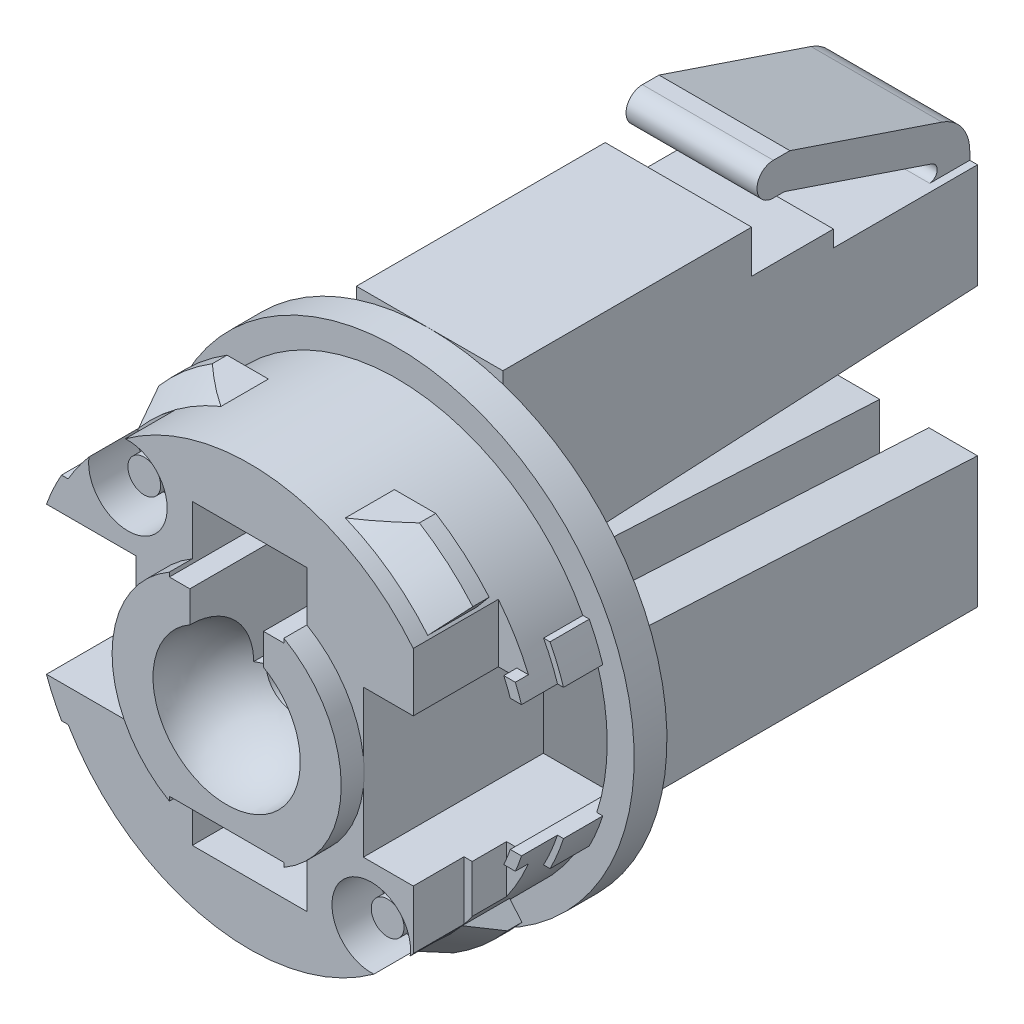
ISO-10303-21;
HEADER;
FILE_DESCRIPTION(('STEP AP214'),'2;1');
FILE_NAME('part.step','',(''),(''),'','','');
FILE_SCHEMA(('AUTOMOTIVE_DESIGN { 1 0 10303 214 1 1 1 1 }'));
ENDSEC;
DATA;
#1=APPLICATION_CONTEXT('core data for automotive mechanical design processes');
#2=APPLICATION_PROTOCOL_DEFINITION('international standard','automotive_design',2000,#1);
#3=PRODUCT_CONTEXT('',#1,'mechanical');
#4=PRODUCT('Part','Part','',(#3));
#5=PRODUCT_RELATED_PRODUCT_CATEGORY('part','',(#4));
#6=PRODUCT_DEFINITION_FORMATION('','',#4);
#7=PRODUCT_DEFINITION_CONTEXT('part definition',#1,'design');
#8=PRODUCT_DEFINITION('design','',#6,#7);
#9=PRODUCT_DEFINITION_SHAPE('','',#8);
#10=(LENGTH_UNIT() NAMED_UNIT(*) SI_UNIT(.MILLI.,.METRE.));
#11=(NAMED_UNIT(*) PLANE_ANGLE_UNIT() SI_UNIT($,.RADIAN.));
#12=(NAMED_UNIT(*) SI_UNIT($,.STERADIAN.) SOLID_ANGLE_UNIT());
#13=UNCERTAINTY_MEASURE_WITH_UNIT(LENGTH_MEASURE(1.E-05),#10,'distance_accuracy_value','');
#14=(GEOMETRIC_REPRESENTATION_CONTEXT(3) GLOBAL_UNCERTAINTY_ASSIGNED_CONTEXT((#13)) GLOBAL_UNIT_ASSIGNED_CONTEXT((#10,
#11,#12)) REPRESENTATION_CONTEXT('',''));
#15=CARTESIAN_POINT('',(0.,0.,0.));
#16=DIRECTION('',(0.,0.,1.));
#17=DIRECTION('',(1.,0.,0.));
#18=AXIS2_PLACEMENT_3D('',#15,#16,#17);
#19=CARTESIAN_POINT('',(0.,0.,0.8));
#20=DIRECTION('',(0.,0.,1.));
#21=DIRECTION('',(1.,0.,0.));
#22=AXIS2_PLACEMENT_3D('',#19,#20,#21);
#23=CYLINDRICAL_SURFACE('',#22,0.87);
#24=CARTESIAN_POINT('',(0.,0.,3.12500602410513));
#25=DIRECTION('',(0.,0.,1.));
#26=DIRECTION('',(1.,0.,0.));
#27=AXIS2_PLACEMENT_3D('',#24,#25,#26);
#28=CIRCLE('',#27,0.87);
#29=CARTESIAN_POINT('',(0.870000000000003,0.,3.12500602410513));
#30=VERTEX_POINT('',#29);
#31=CARTESIAN_POINT('',(-0.869999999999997,0.,3.12500602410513));
#32=VERTEX_POINT('',#31);
#33=EDGE_CURVE('E745',#30,#32,#28,.F.);
#34=ORIENTED_EDGE('',*,*,#33,.F.);
#35=DIRECTION('',(0.,0.,1.));
#36=VECTOR('',#35,1.);
#37=CARTESIAN_POINT('',(0.870000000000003,0.,0.8));
#38=LINE('',#37,#36);
#39=CARTESIAN_POINT('',(0.870000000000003,0.,0.8));
#40=VERTEX_POINT('',#39);
#41=EDGE_CURVE('E749',#40,#30,#38,.T.);
#42=ORIENTED_EDGE('',*,*,#41,.F.);
#43=CARTESIAN_POINT('',(0.,0.,0.8));
#44=DIRECTION('',(0.,0.,1.));
#45=DIRECTION('',(1.,0.,0.));
#46=AXIS2_PLACEMENT_3D('',#43,#44,#45);
#47=CIRCLE('',#46,0.87);
#48=CARTESIAN_POINT('',(-0.869999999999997,0.,0.8));
#49=VERTEX_POINT('',#48);
#50=EDGE_CURVE('E769',#40,#49,#47,.F.);
#51=ORIENTED_EDGE('',*,*,#50,.T.);
#52=DIRECTION('',(0.,0.,1.));
#53=VECTOR('',#52,1.);
#54=CARTESIAN_POINT('',(-0.869999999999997,0.,0.8));
#55=LINE('',#54,#53);
#56=EDGE_CURVE('E752',#32,#49,#55,.F.);
#57=ORIENTED_EDGE('',*,*,#56,.F.);
#58=EDGE_LOOP('',(#34,#42,#51,#57));
#59=FACE_BOUND('',#58,.T.);
#60=ADVANCED_FACE('F14',(#59),#23,.F.);
#61=CARTESIAN_POINT('',(-0.869999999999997,0.,0.8));
#62=DIRECTION('',(0.,1.,0.));
#63=DIRECTION('',(0.,0.,1.));
#64=AXIS2_PLACEMENT_3D('',#61,#62,#63);
#65=PLANE('',#64);
#66=DIRECTION('',(-1.,0.,0.));
#67=VECTOR('',#66,1.);
#68=CARTESIAN_POINT('',(0.,0.,0.8));
#69=LINE('',#68,#67);
#70=CARTESIAN_POINT('',(-1.125,0.,0.8));
#71=VERTEX_POINT('',#70);
#72=EDGE_CURVE('E771',#49,#71,#69,.T.);
#73=ORIENTED_EDGE('',*,*,#72,.T.);
#74=DIRECTION('',(0.,0.,-1.));
#75=VECTOR('',#74,1.);
#76=CARTESIAN_POINT('',(-1.125,0.,0.8));
#77=LINE('',#76,#75);
#78=CARTESIAN_POINT('',(-1.125,0.,3.25144284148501));
#79=VERTEX_POINT('',#78);
#80=EDGE_CURVE('E1529',#79,#71,#77,.T.);
#81=ORIENTED_EDGE('',*,*,#80,.F.);
#82=CARTESIAN_POINT('',(-1.125,0.,3.25144284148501));
#83=CARTESIAN_POINT('',(-1.08383418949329,0.,3.22767922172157));
#84=CARTESIAN_POINT('',(-1.04200128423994,0.,3.20526101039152));
#85=CARTESIAN_POINT('',(-0.957001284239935,0.,3.16311540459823));
#86=CARTESIAN_POINT('',(-0.913834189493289,0.,3.14338801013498));
#87=CARTESIAN_POINT('',(-0.869999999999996,0.,3.12500602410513));
#88=B_SPLINE_CURVE_WITH_KNOTS('',3,(#82,#83,#84,#85,#86,#87),.UNSPECIFIED.,.F.,.F.,(4,2,4),(0.,
0.142383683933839,0.284767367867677),.UNSPECIFIED.);
#89=EDGE_CURVE('E754',#79,#32,#88,.T.);
#90=ORIENTED_EDGE('',*,*,#89,.T.);
#91=ORIENTED_EDGE('',*,*,#56,.T.);
#92=EDGE_LOOP('',(#73,#81,#90,#91));
#93=FACE_BOUND('',#92,.T.);
#94=ADVANCED_FACE('F2467',(#93),#65,.T.);
#95=CARTESIAN_POINT('',(1.125,0.,0.8));
#96=DIRECTION('',(0.,1.,0.));
#97=DIRECTION('',(0.,0.,1.));
#98=AXIS2_PLACEMENT_3D('',#95,#96,#97);
#99=PLANE('',#98);
#100=DIRECTION('',(-1.,0.,0.));
#101=VECTOR('',#100,1.);
#102=CARTESIAN_POINT('',(0.,0.,0.8));
#103=LINE('',#102,#101);
#104=CARTESIAN_POINT('',(1.125,0.,0.8));
#105=VERTEX_POINT('',#104);
#106=EDGE_CURVE('E767',#105,#40,#103,.T.);
#107=ORIENTED_EDGE('',*,*,#106,.T.);
#108=ORIENTED_EDGE('',*,*,#41,.T.);
#109=CARTESIAN_POINT('',(0.870000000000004,0.,3.12500602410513));
#110=CARTESIAN_POINT('',(0.913834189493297,0.,3.14338801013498));
#111=CARTESIAN_POINT('',(0.957001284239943,0.,3.16311540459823));
#112=CARTESIAN_POINT('',(1.04200128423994,0.,3.20526101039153));
#113=CARTESIAN_POINT('',(1.0838341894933,0.,3.22767922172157));
#114=CARTESIAN_POINT('',(1.12500000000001,0.,3.25144284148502));
#115=B_SPLINE_CURVE_WITH_KNOTS('',3,(#109,#110,#111,#112,#113,#114),.UNSPECIFIED.,.F.,.F.,(4,2,
4),(0.,0.14238368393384,0.284767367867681),.UNSPECIFIED.);
#116=CARTESIAN_POINT('',(1.125,0.,3.25144284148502));
#117=VERTEX_POINT('',#116);
#118=EDGE_CURVE('E756',#30,#117,#115,.T.);
#119=ORIENTED_EDGE('',*,*,#118,.T.);
#120=DIRECTION('',(0.,0.,1.));
#121=VECTOR('',#120,1.);
#122=CARTESIAN_POINT('',(1.125,0.,0.8));
#123=LINE('',#122,#121);
#124=EDGE_CURVE('E1513',#105,#117,#123,.T.);
#125=ORIENTED_EDGE('',*,*,#124,.F.);
#126=EDGE_LOOP('',(#107,#108,#119,#125));
#127=FACE_BOUND('',#126,.T.);
#128=ADVANCED_FACE('F766',(#127),#99,.T.);
#129=CARTESIAN_POINT('',(2.,7.95,-9.5));
#130=DIRECTION('',(-1.,0.,0.));
#131=DIRECTION('',(0.,-1.,0.));
#132=AXIS2_PLACEMENT_3D('',#129,#130,#131);
#133=CYLINDRICAL_SURFACE('',#132,0.5);
#134=CARTESIAN_POINT('',(2.,7.95,-9.5));
#135=DIRECTION('',(-1.,0.,0.));
#136=DIRECTION('',(0.,-1.,0.));
#137=AXIS2_PLACEMENT_3D('',#134,#135,#136);
#138=CIRCLE('',#137,0.5);
#139=CARTESIAN_POINT('',(2.,7.45000116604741,-9.49999999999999));
#140=VERTEX_POINT('',#139);
#141=CARTESIAN_POINT('',(2.,8.45,-9.5));
#142=VERTEX_POINT('',#141);
#143=EDGE_CURVE('E1448',#140,#142,#138,.T.);
#144=ORIENTED_EDGE('',*,*,#143,.T.);
#145=DIRECTION('',(1.,0.,0.));
#146=VECTOR('',#145,1.);
#147=CARTESIAN_POINT('',(2.,8.45,-9.5));
#148=LINE('',#147,#146);
#149=CARTESIAN_POINT('',(-2.,8.45,-9.5));
#150=VERTEX_POINT('',#149);
#151=EDGE_CURVE('E1549',#150,#142,#148,.T.);
#152=ORIENTED_EDGE('',*,*,#151,.F.);
#153=CARTESIAN_POINT('',(-2.,7.95,-9.5));
#154=DIRECTION('',(-1.,0.,0.));
#155=DIRECTION('',(0.,-1.,0.));
#156=AXIS2_PLACEMENT_3D('',#153,#154,#155);
#157=CIRCLE('',#156,0.5);
#158=CARTESIAN_POINT('',(-2.,7.4500011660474,-9.49999999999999));
#159=VERTEX_POINT('',#158);
#160=EDGE_CURVE('E1472',#159,#150,#157,.T.);
#161=ORIENTED_EDGE('',*,*,#160,.F.);
#162=DIRECTION('',(1.,0.,0.));
#163=VECTOR('',#162,1.);
#164=CARTESIAN_POINT('',(2.,7.45000233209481,-9.5));
#165=LINE('',#164,#163);
#166=EDGE_CURVE('E1469',#140,#159,#165,.F.);
#167=ORIENTED_EDGE('',*,*,#166,.F.);
#168=EDGE_LOOP('',(#144,#152,#161,#167));
#169=FACE_BOUND('',#168,.T.);
#170=ADVANCED_FACE('F2460',(#169),#133,.T.);
#171=CARTESIAN_POINT('',(3.71689106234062,-3.98587767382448,4.));
#172=DIRECTION('',(0.,0.,-1.));
#173=DIRECTION('',(-1.,0.,0.));
#174=AXIS2_PLACEMENT_3D('',#171,#172,#173);
#175=PLANE('',#174);
#176=CARTESIAN_POINT('',(3.71689106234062,-3.98587767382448,4.));
#177=DIRECTION('',(0.,0.,-1.));
#178=DIRECTION('',(-1.,0.,0.));
#179=AXIS2_PLACEMENT_3D('',#176,#177,#178);
#180=CIRCLE('',#179,0.5);
#181=CARTESIAN_POINT('',(3.21689106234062,-3.98587767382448,4.));
#182=VERTEX_POINT('',#181);
#183=EDGE_CURVE('E1438',#182,#182,#180,.T.);
#184=ORIENTED_EDGE('',*,*,#183,.F.);
#185=EDGE_LOOP('',(#184));
#186=FACE_BOUND('',#185,.T.);
#187=ADVANCED_FACE('F2456',(#186),#175,.F.);
#188=CARTESIAN_POINT('',(0.,0.,0.8));
#189=DIRECTION('',(0.,0.,-1.));
#190=DIRECTION('',(-1.,0.,0.));
#191=AXIS2_PLACEMENT_3D('',#188,#189,#190);
#192=PLANE('',#191);
#193=DIRECTION('',(0.,-1.,0.));
#194=VECTOR('',#193,1.);
#195=CARTESIAN_POINT('',(1.125,2.9,0.8));
#196=LINE('',#195,#194);
#197=CARTESIAN_POINT('',(1.125,2.9,0.8));
#198=VERTEX_POINT('',#197);
#199=EDGE_CURVE('E1522',#198,#105,#196,.T.);
#200=ORIENTED_EDGE('',*,*,#199,.F.);
#201=DIRECTION('',(1.,0.,0.));
#202=VECTOR('',#201,1.);
#203=CARTESIAN_POINT('',(1.75,2.9,0.8));
#204=LINE('',#203,#202);
#205=CARTESIAN_POINT('',(-1.125,2.9,0.8));
#206=VERTEX_POINT('',#205);
#207=EDGE_CURVE('E1537',#206,#198,#204,.T.);
#208=ORIENTED_EDGE('',*,*,#207,.F.);
#209=DIRECTION('',(0.,1.,0.));
#210=VECTOR('',#209,1.);
#211=CARTESIAN_POINT('',(-1.125,0.,0.8));
#212=LINE('',#211,#210);
#213=EDGE_CURVE('E1528',#71,#206,#212,.T.);
#214=ORIENTED_EDGE('',*,*,#213,.F.);
#215=ORIENTED_EDGE('',*,*,#72,.F.);
#216=ORIENTED_EDGE('',*,*,#50,.F.);
#217=ORIENTED_EDGE('',*,*,#106,.F.);
#218=EDGE_LOOP('',(#200,#208,#214,#215,#216,#217));
#219=FACE_BOUND('',#218,.T.);
#220=ADVANCED_FACE('F2452',(#219),#192,.F.);
#221=CARTESIAN_POINT('',(-1.75,4.55,0.));
#222=DIRECTION('',(0.,0.,-1.));
#223=DIRECTION('',(-1.,0.,0.));
#224=AXIS2_PLACEMENT_3D('',#221,#222,#223);
#225=PLANE('',#224);
#226=DIRECTION('',(-1.,0.,0.));
#227=VECTOR('',#226,1.);
#228=CARTESIAN_POINT('',(-1.75,4.55,0.));
#229=LINE('',#228,#227);
#230=CARTESIAN_POINT('',(-1.75,4.55,0.));
#231=VERTEX_POINT('',#230);
#232=CARTESIAN_POINT('',(-1.45,4.55,0.));
#233=VERTEX_POINT('',#232);
#234=EDGE_CURVE('E778',#231,#233,#229,.F.);
#235=ORIENTED_EDGE('',*,*,#234,.F.);
#236=DIRECTION('',(0.,1.,0.));
#237=VECTOR('',#236,1.);
#238=CARTESIAN_POINT('',(-1.75,4.55,0.));
#239=LINE('',#238,#237);
#240=CARTESIAN_POINT('',(-1.75,2.9,0.));
#241=VERTEX_POINT('',#240);
#242=EDGE_CURVE('E781',#241,#231,#239,.T.);
#243=ORIENTED_EDGE('',*,*,#242,.F.);
#244=DIRECTION('',(1.,0.,0.));
#245=VECTOR('',#244,1.);
#246=CARTESIAN_POINT('',(1.75,2.9,0.));
#247=LINE('',#246,#245);
#248=CARTESIAN_POINT('',(1.75,2.9,0.));
#249=VERTEX_POINT('',#248);
#250=EDGE_CURVE('E796',#249,#241,#247,.F.);
#251=ORIENTED_EDGE('',*,*,#250,.F.);
#252=DIRECTION('',(0.,1.,0.));
#253=VECTOR('',#252,1.);
#254=CARTESIAN_POINT('',(1.75,4.55,0.));
#255=LINE('',#254,#253);
#256=CARTESIAN_POINT('',(1.75,4.55,0.));
#257=VERTEX_POINT('',#256);
#258=EDGE_CURVE('E784',#257,#249,#255,.F.);
#259=ORIENTED_EDGE('',*,*,#258,.F.);
#260=DIRECTION('',(-1.,0.,0.));
#261=VECTOR('',#260,1.);
#262=CARTESIAN_POINT('',(-1.75,4.55,0.));
#263=LINE('',#262,#261);
#264=CARTESIAN_POINT('',(1.45,4.55,0.));
#265=VERTEX_POINT('',#264);
#266=EDGE_CURVE('E782',#265,#257,#263,.F.);
#267=ORIENTED_EDGE('',*,*,#266,.F.);
#268=DIRECTION('',(0.,1.,0.));
#269=VECTOR('',#268,1.);
#270=CARTESIAN_POINT('',(1.45,4.55,0.));
#271=LINE('',#270,#269);
#272=CARTESIAN_POINT('',(1.45,3.95,0.));
#273=VERTEX_POINT('',#272);
#274=EDGE_CURVE('E785',#273,#265,#271,.T.);
#275=ORIENTED_EDGE('',*,*,#274,.F.);
#276=DIRECTION('',(1.,0.,0.));
#277=VECTOR('',#276,1.);
#278=CARTESIAN_POINT('',(-1.45,3.95,0.));
#279=LINE('',#278,#277);
#280=CARTESIAN_POINT('',(-1.45,3.95,0.));
#281=VERTEX_POINT('',#280);
#282=EDGE_CURVE('E792',#273,#281,#279,.F.);
#283=ORIENTED_EDGE('',*,*,#282,.T.);
#284=DIRECTION('',(0.,1.,0.));
#285=VECTOR('',#284,1.);
#286=CARTESIAN_POINT('',(-1.45,4.55,0.));
#287=LINE('',#286,#285);
#288=EDGE_CURVE('E780',#233,#281,#287,.F.);
#289=ORIENTED_EDGE('',*,*,#288,.F.);
#290=EDGE_LOOP('',(#235,#243,#251,#259,#267,#275,#283,#289));
#291=FACE_BOUND('',#290,.T.);
#292=ADVANCED_FACE('F2448',(#291),#225,.F.);
#293=CARTESIAN_POINT('',(-1.125,0.,0.8));
#294=DIRECTION('',(1.,0.,0.));
#295=DIRECTION('',(0.,0.,-1.));
#296=AXIS2_PLACEMENT_3D('',#293,#294,#295);
#297=PLANE('',#296);
#298=DIRECTION('',(0.,0.,1.));
#299=VECTOR('',#298,1.);
#300=CARTESIAN_POINT('',(-1.125,2.9,0.));
#301=LINE('',#300,#299);
#302=CARTESIAN_POINT('',(-1.125,2.9,5.2));
#303=VERTEX_POINT('',#302);
#304=EDGE_CURVE('E1437',#303,#206,#301,.F.);
#305=ORIENTED_EDGE('',*,*,#304,.F.);
#306=DIRECTION('',(0.,1.,0.));
#307=VECTOR('',#306,1.);
#308=CARTESIAN_POINT('',(-1.125,0.,5.2));
#309=LINE('',#308,#307);
#310=CARTESIAN_POINT('',(-1.125,1.94855715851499,5.2));
#311=VERTEX_POINT('',#310);
#312=EDGE_CURVE('E1525',#303,#311,#309,.F.);
#313=ORIENTED_EDGE('',*,*,#312,.T.);
#314=CARTESIAN_POINT('',(-1.125,1.94855715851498,5.2));
#315=CARTESIAN_POINT('',(-1.125,1.94855679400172,5.14517782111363));
#316=CARTESIAN_POINT('',(-1.125,1.94624209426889,5.09038190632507));
#317=CARTESIAN_POINT('',(-1.125,1.93700781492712,4.98118218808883));
#318=CARTESIAN_POINT('',(-1.125,1.93008845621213,4.92677836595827));
#319=CARTESIAN_POINT('',(-1.125,1.90248912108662,4.76483472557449));
#320=CARTESIAN_POINT('',(-1.12499999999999,1.87496770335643,4.6583796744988));
#321=CARTESIAN_POINT('',(-1.12499999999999,1.80244415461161,4.45160402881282));
#322=CARTESIAN_POINT('',(-1.125,1.7574336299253,4.35128640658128));
#323=CARTESIAN_POINT('',(-1.125,1.651214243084,4.15963453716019));
#324=CARTESIAN_POINT('',(-1.125,1.59000823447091,4.0682987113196));
#325=CARTESIAN_POINT('',(-1.125,1.45313441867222,3.89720282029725));
#326=CARTESIAN_POINT('',(-1.125,1.37746675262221,3.81744264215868));
#327=CARTESIAN_POINT('',(-1.125,1.21379684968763,3.67174081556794));
#328=CARTESIAN_POINT('',(-1.125,1.12579220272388,3.60580187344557));
#329=CARTESIAN_POINT('',(-1.125,0.939953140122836,3.48962611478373));
#330=CARTESIAN_POINT('',(-1.125,0.842116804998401,3.43939237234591));
#331=CARTESIAN_POINT('',(-1.125,0.639418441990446,3.35608916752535));
#332=CARTESIAN_POINT('',(-1.125,0.534560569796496,3.32300965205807));
#333=CARTESIAN_POINT('',(-1.125,0.357550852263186,3.28317482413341));
#334=CARTESIAN_POINT('',(-1.125,0.286512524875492,3.27128252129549));
#335=CARTESIAN_POINT('',(-1.125,0.14365939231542,3.25541757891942));
#336=CARTESIAN_POINT('',(-1.125,0.071845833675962,3.25143371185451));
#337=CARTESIAN_POINT('',(-1.125,0.,3.25144284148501));
#338=B_SPLINE_CURVE_WITH_KNOTS('',3,(#314,#315,#316,#317,#318,#319,#320,#321,#322,#323,#324,
#325,#326,#327,#328,#329,#330,#331,#332,#333,#334,#335,#336,#337),.UNSPECIFIED.,.F.,.F.,(4,2,2,
2,2,2,2,2,2,2,2,4),(0.,0.16436551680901,0.328723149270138,0.656896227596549,0.985227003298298,
1.31349996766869,1.6417697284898,1.97010370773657,2.29850191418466,2.62670744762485,
2.84237814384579,3.05774243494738),.UNSPECIFIED.);
#339=EDGE_CURVE('E795',#311,#79,#338,.T.);
#340=ORIENTED_EDGE('',*,*,#339,.T.);
#341=ORIENTED_EDGE('',*,*,#80,.T.);
#342=ORIENTED_EDGE('',*,*,#213,.T.);
#343=EDGE_LOOP('',(#305,#313,#340,#341,#342));
#344=FACE_BOUND('',#343,.T.);
#345=ADVANCED_FACE('F2442',(#344),#297,.T.);
#346=CARTESIAN_POINT('',(1.125,2.9,0.8));
#347=DIRECTION('',(-1.,0.,0.));
#348=DIRECTION('',(0.,-1.,0.));
#349=AXIS2_PLACEMENT_3D('',#346,#347,#348);
#350=PLANE('',#349);
#351=ORIENTED_EDGE('',*,*,#199,.T.);
#352=ORIENTED_EDGE('',*,*,#124,.T.);
#353=CARTESIAN_POINT('',(1.125,0.,3.25144284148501));
#354=CARTESIAN_POINT('',(1.125,0.05482217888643,3.25144320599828));
#355=CARTESIAN_POINT('',(1.125,0.109618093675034,3.25375790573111));
#356=CARTESIAN_POINT('',(1.125,0.21881781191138,3.2629921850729));
#357=CARTESIAN_POINT('',(1.125,0.273221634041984,3.2699115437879));
#358=CARTESIAN_POINT('',(1.125,0.435165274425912,3.29751087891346));
#359=CARTESIAN_POINT('',(1.125,0.541620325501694,3.32503229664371));
#360=CARTESIAN_POINT('',(1.125,0.748395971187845,3.39755584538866));
#361=CARTESIAN_POINT('',(1.125,0.848713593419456,3.44256637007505));
#362=CARTESIAN_POINT('',(1.125,1.04036546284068,3.54878575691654));
#363=CARTESIAN_POINT('',(1.125,1.13170128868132,3.60999176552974));
#364=CARTESIAN_POINT('',(1.125,1.30279717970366,3.74686558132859));
#365=CARTESIAN_POINT('',(1.125,1.38255735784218,3.82253324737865));
#366=CARTESIAN_POINT('',(1.125,1.52825918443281,3.98620315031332));
#367=CARTESIAN_POINT('',(1.125,1.59419812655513,4.07420779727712));
#368=CARTESIAN_POINT('',(1.125,1.71037388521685,4.26004685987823));
#369=CARTESIAN_POINT('',(1.12500000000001,1.76060762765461,4.3578831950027));
#370=CARTESIAN_POINT('',(1.125,1.84391083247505,4.56058155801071));
#371=CARTESIAN_POINT('',(1.12499999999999,1.87699034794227,4.66543943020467));
#372=CARTESIAN_POINT('',(1.12499999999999,1.91682517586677,4.84244914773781));
#373=CARTESIAN_POINT('',(1.125,1.92871747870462,4.91348747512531));
#374=CARTESIAN_POINT('',(1.12500000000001,1.9445824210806,5.05634060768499));
#375=CARTESIAN_POINT('',(1.12500000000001,1.94856628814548,5.12815416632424));
#376=CARTESIAN_POINT('',(1.125,1.94855715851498,5.2));
#377=B_SPLINE_CURVE_WITH_KNOTS('',3,(#353,#354,#355,#356,#357,#358,#359,#360,#361,#362,#363,
#364,#365,#366,#367,#368,#369,#370,#371,#372,#373,#374,#375,#376),.UNSPECIFIED.,.F.,.F.,(4,2,2,
2,2,2,2,2,2,2,2,4),(0.,0.164365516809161,0.328723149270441,0.656896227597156,0.985227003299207,
1.3134999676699,1.64176972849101,1.97010370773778,2.29850191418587,2.62670744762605,
2.84237814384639,3.05774243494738),.UNSPECIFIED.);
#378=CARTESIAN_POINT('',(1.125,1.94855715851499,5.2));
#379=VERTEX_POINT('',#378);
#380=EDGE_CURVE('E761',#117,#379,#377,.T.);
#381=ORIENTED_EDGE('',*,*,#380,.T.);
#382=DIRECTION('',(0.,-1.,0.));
#383=VECTOR('',#382,1.);
#384=CARTESIAN_POINT('',(1.125,2.9,5.2));
#385=LINE('',#384,#383);
#386=CARTESIAN_POINT('',(1.125,2.9,5.2));
#387=VERTEX_POINT('',#386);
#388=EDGE_CURVE('E1523',#379,#387,#385,.F.);
#389=ORIENTED_EDGE('',*,*,#388,.T.);
#390=DIRECTION('',(0.,0.,1.));
#391=VECTOR('',#390,1.);
#392=CARTESIAN_POINT('',(1.125,2.9,0.));
#393=LINE('',#392,#391);
#394=EDGE_CURVE('E1426',#198,#387,#393,.T.);
#395=ORIENTED_EDGE('',*,*,#394,.F.);
#396=EDGE_LOOP('',(#351,#352,#381,#389,#395));
#397=FACE_BOUND('',#396,.T.);
#398=ADVANCED_FACE('F2437',(#397),#350,.T.);
#399=CARTESIAN_POINT('',(-3.71689106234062,3.98587767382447,4.));
#400=DIRECTION('',(0.,0.,-1.));
#401=DIRECTION('',(-1.,0.,0.));
#402=AXIS2_PLACEMENT_3D('',#399,#400,#401);
#403=PLANE('',#402);
#404=CARTESIAN_POINT('',(-3.71689106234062,3.98587767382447,4.));
#405=DIRECTION('',(0.,0.,-1.));
#406=DIRECTION('',(-1.,0.,0.));
#407=AXIS2_PLACEMENT_3D('',#404,#405,#406);
#408=CIRCLE('',#407,0.5);
#409=CARTESIAN_POINT('',(-4.21689106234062,3.98587767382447,4.));
#410=VERTEX_POINT('',#409);
#411=EDGE_CURVE('E1411',#410,#410,#408,.T.);
#412=ORIENTED_EDGE('',*,*,#411,.F.);
#413=EDGE_LOOP('',(#412));
#414=FACE_BOUND('',#413,.T.);
#415=ADVANCED_FACE('F2441',(#414),#403,.F.);
#416=CARTESIAN_POINT('',(1.75000000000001,-4.55,0.));
#417=DIRECTION('',(0.,0.,1.));
#418=DIRECTION('',(0.,-1.,0.));
#419=AXIS2_PLACEMENT_3D('',#416,#417,#418);
#420=PLANE('',#419);
#421=DIRECTION('',(0.,-1.,0.));
#422=VECTOR('',#421,1.);
#423=CARTESIAN_POINT('',(-1.75,-4.55,0.));
#424=LINE('',#423,#422);
#425=CARTESIAN_POINT('',(-1.75,-2.9,0.));
#426=VERTEX_POINT('',#425);
#427=CARTESIAN_POINT('',(-1.75,-4.55,0.));
#428=VERTEX_POINT('',#427);
#429=EDGE_CURVE('E1514',#426,#428,#424,.T.);
#430=ORIENTED_EDGE('',*,*,#429,.T.);
#431=DIRECTION('',(1.,0.,0.));
#432=VECTOR('',#431,1.);
#433=CARTESIAN_POINT('',(1.75000000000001,-4.55,0.));
#434=LINE('',#433,#432);
#435=CARTESIAN_POINT('',(-1.45,-4.55,0.));
#436=VERTEX_POINT('',#435);
#437=EDGE_CURVE('E1517',#428,#436,#434,.T.);
#438=ORIENTED_EDGE('',*,*,#437,.T.);
#439=DIRECTION('',(0.,-1.,0.));
#440=VECTOR('',#439,1.);
#441=CARTESIAN_POINT('',(-1.45,-4.55,0.));
#442=LINE('',#441,#440);
#443=CARTESIAN_POINT('',(-1.45,-3.95,0.));
#444=VERTEX_POINT('',#443);
#445=EDGE_CURVE('E1510',#436,#444,#442,.F.);
#446=ORIENTED_EDGE('',*,*,#445,.T.);
#447=DIRECTION('',(1.,0.,0.));
#448=VECTOR('',#447,1.);
#449=CARTESIAN_POINT('',(1.45000000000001,-3.95,0.));
#450=LINE('',#449,#448);
#451=CARTESIAN_POINT('',(1.45,-3.95,0.));
#452=VERTEX_POINT('',#451);
#453=EDGE_CURVE('E1340',#444,#452,#450,.T.);
#454=ORIENTED_EDGE('',*,*,#453,.T.);
#455=DIRECTION('',(0.,-1.,0.));
#456=VECTOR('',#455,1.);
#457=CARTESIAN_POINT('',(1.45,-4.55,0.));
#458=LINE('',#457,#456);
#459=CARTESIAN_POINT('',(1.45000000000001,-4.55,0.));
#460=VERTEX_POINT('',#459);
#461=EDGE_CURVE('E1512',#452,#460,#458,.T.);
#462=ORIENTED_EDGE('',*,*,#461,.T.);
#463=DIRECTION('',(1.,0.,0.));
#464=VECTOR('',#463,1.);
#465=CARTESIAN_POINT('',(1.75000000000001,-4.55,0.));
#466=LINE('',#465,#464);
#467=CARTESIAN_POINT('',(1.75000000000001,-4.55,0.));
#468=VERTEX_POINT('',#467);
#469=EDGE_CURVE('E1520',#460,#468,#466,.T.);
#470=ORIENTED_EDGE('',*,*,#469,.T.);
#471=DIRECTION('',(0.,-1.,0.));
#472=VECTOR('',#471,1.);
#473=CARTESIAN_POINT('',(1.75000000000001,-4.55,0.));
#474=LINE('',#473,#472);
#475=CARTESIAN_POINT('',(1.75,-2.9,0.));
#476=VERTEX_POINT('',#475);
#477=EDGE_CURVE('E1518',#468,#476,#474,.F.);
#478=ORIENTED_EDGE('',*,*,#477,.T.);
#479=DIRECTION('',(1.,0.,0.));
#480=VECTOR('',#479,1.);
#481=CARTESIAN_POINT('',(-1.75,-2.9,0.));
#482=LINE('',#481,#480);
#483=EDGE_CURVE('E1378',#426,#476,#482,.T.);
#484=ORIENTED_EDGE('',*,*,#483,.F.);
#485=EDGE_LOOP('',(#430,#438,#446,#454,#462,#470,#478,#484));
#486=FACE_BOUND('',#485,.T.);
#487=ADVANCED_FACE('F1575',(#486),#420,.T.);
#488=CARTESIAN_POINT('',(2.,8.45,-9.5));
#489=DIRECTION('',(0.,1.,0.));
#490=DIRECTION('',(0.,0.,1.));
#491=AXIS2_PLACEMENT_3D('',#488,#489,#490);
#492=PLANE('',#491);
#493=DIRECTION('',(0.,0.,1.));
#494=VECTOR('',#493,1.);
#495=CARTESIAN_POINT('',(2.,8.45,-14.25));
#496=LINE('',#495,#494);
#497=CARTESIAN_POINT('',(2.,8.45,-10.0066747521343));
#498=VERTEX_POINT('',#497);
#499=EDGE_CURVE('E1445',#142,#498,#496,.F.);
#500=ORIENTED_EDGE('',*,*,#499,.T.);
#501=DIRECTION('',(1.,0.,0.));
#502=VECTOR('',#501,1.);
#503=CARTESIAN_POINT('',(2.,8.45,-10.0066747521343));
#504=LINE('',#503,#502);
#505=CARTESIAN_POINT('',(-2.,8.45,-10.0066747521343));
#506=VERTEX_POINT('',#505);
#507=EDGE_CURVE('E1488',#506,#498,#504,.T.);
#508=ORIENTED_EDGE('',*,*,#507,.F.);
#509=DIRECTION('',(0.,0.,1.));
#510=VECTOR('',#509,1.);
#511=CARTESIAN_POINT('',(-2.,8.45,-14.25));
#512=LINE('',#511,#510);
#513=EDGE_CURVE('E1470',#150,#506,#512,.F.);
#514=ORIENTED_EDGE('',*,*,#513,.F.);
#515=ORIENTED_EDGE('',*,*,#151,.T.);
#516=EDGE_LOOP('',(#500,#508,#514,#515));
#517=FACE_BOUND('',#516,.T.);
#518=ADVANCED_FACE('F3591',(#517),#492,.T.);
#519=CARTESIAN_POINT('',(-2.,5.7,-14.25));
#520=DIRECTION('',(-1.,0.,0.));
#521=DIRECTION('',(0.,-1.,0.));
#522=AXIS2_PLACEMENT_3D('',#519,#520,#521);
#523=PLANE('',#522);
#524=ORIENTED_EDGE('',*,*,#160,.T.);
#525=ORIENTED_EDGE('',*,*,#513,.T.);
#526=DIRECTION('',(0.,0.319523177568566,0.947578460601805));
#527=VECTOR('',#526,1.);
#528=CARTESIAN_POINT('',(-2.,8.45,-10.0066747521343));
#529=LINE('',#528,#527);
#530=CARTESIAN_POINT('',(-2.,6.88447307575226,-14.6494039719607));
#531=VERTEX_POINT('',#530);
#532=EDGE_CURVE('E1325',#531,#506,#529,.T.);
#533=ORIENTED_EDGE('',*,*,#532,.F.);
#534=CARTESIAN_POINT('',(-2.,5.7,-14.25));
#535=DIRECTION('',(-1.,0.,0.));
#536=DIRECTION('',(0.,-1.,0.));
#537=AXIS2_PLACEMENT_3D('',#534,#535,#536);
#538=CIRCLE('',#537,1.25);
#539=CARTESIAN_POINT('',(-2.,5.7,-15.5));
#540=VERTEX_POINT('',#539);
#541=EDGE_CURVE('E1480',#531,#540,#538,.T.);
#542=ORIENTED_EDGE('',*,*,#541,.T.);
#543=DIRECTION('',(0.,-1.,0.));
#544=VECTOR('',#543,1.);
#545=CARTESIAN_POINT('',(-2.,5.7,-15.5));
#546=LINE('',#545,#544);
#547=CARTESIAN_POINT('',(-2.,5.45,-15.5));
#548=VERTEX_POINT('',#547);
#549=EDGE_CURVE('E1477',#540,#548,#546,.T.);
#550=ORIENTED_EDGE('',*,*,#549,.T.);
#551=DIRECTION('',(0.,0.,1.));
#552=VECTOR('',#551,1.);
#553=CARTESIAN_POINT('',(-2.,5.45,-14.25));
#554=LINE('',#553,#552);
#555=CARTESIAN_POINT('',(-2.,5.45,-14.2762392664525));
#556=VERTEX_POINT('',#555);
#557=EDGE_CURVE('E1473',#548,#556,#554,.T.);
#558=ORIENTED_EDGE('',*,*,#557,.T.);
#559=CARTESIAN_POINT('',(-2.,5.69899680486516,-14.2538653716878));
#560=DIRECTION('',(-1.,0.,0.));
#561=DIRECTION('',(0.,-1.,0.));
#562=AXIS2_PLACEMENT_3D('',#559,#560,#561);
#563=CIRCLE('',#562,0.25);
#564=CARTESIAN_POINT('',(-2.,5.93945128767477,-14.3222878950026));
#565=VERTEX_POINT('',#564);
#566=EDGE_CURVE('E1476',#556,#565,#563,.F.);
#567=ORIENTED_EDGE('',*,*,#566,.T.);
#568=DIRECTION('',(0.,-0.319523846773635,-0.94757823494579));
#569=VECTOR('',#568,1.);
#570=CARTESIAN_POINT('',(-2.,7.4500023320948,-9.84260568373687));
#571=LINE('',#570,#569);
#572=CARTESIAN_POINT('',(-2.,7.4500023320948,-9.84260568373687));
#573=VERTEX_POINT('',#572);
#574=EDGE_CURVE('E1463',#573,#565,#571,.T.);
#575=ORIENTED_EDGE('',*,*,#574,.F.);
#576=DIRECTION('',(0.,0.,-1.));
#577=VECTOR('',#576,1.);
#578=CARTESIAN_POINT('',(-2.,7.45000233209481,-9.5));
#579=LINE('',#578,#577);
#580=EDGE_CURVE('E1447',#159,#573,#579,.T.);
#581=ORIENTED_EDGE('',*,*,#580,.F.);
#582=EDGE_LOOP('',(#524,#525,#533,#542,#550,#558,#567,#575,#581));
#583=FACE_BOUND('',#582,.T.);
#584=ADVANCED_FACE('F3258',(#583),#523,.T.);
#585=CARTESIAN_POINT('',(2.,5.7,-14.25));
#586=DIRECTION('',(-1.,0.,0.));
#587=DIRECTION('',(0.,-1.,0.));
#588=AXIS2_PLACEMENT_3D('',#585,#586,#587);
#589=PLANE('',#588);
#590=ORIENTED_EDGE('',*,*,#499,.F.);
#591=ORIENTED_EDGE('',*,*,#143,.F.);
#592=DIRECTION('',(0.,0.,-1.));
#593=VECTOR('',#592,1.);
#594=CARTESIAN_POINT('',(2.,7.45000233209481,-9.5));
#595=LINE('',#594,#593);
#596=CARTESIAN_POINT('',(2.,7.4500023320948,-9.84260568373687));
#597=VERTEX_POINT('',#596);
#598=EDGE_CURVE('E1466',#597,#140,#595,.F.);
#599=ORIENTED_EDGE('',*,*,#598,.F.);
#600=DIRECTION('',(0.,-0.319523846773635,-0.94757823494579));
#601=VECTOR('',#600,1.);
#602=CARTESIAN_POINT('',(2.,7.4500023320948,-9.84260568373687));
#603=LINE('',#602,#601);
#604=CARTESIAN_POINT('',(2.,5.93945128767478,-14.3222878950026));
#605=VERTEX_POINT('',#604);
#606=EDGE_CURVE('E1460',#605,#597,#603,.F.);
#607=ORIENTED_EDGE('',*,*,#606,.F.);
#608=CARTESIAN_POINT('',(2.,5.69899680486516,-14.2538653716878));
#609=DIRECTION('',(-1.,0.,0.));
#610=DIRECTION('',(0.,-1.,0.));
#611=AXIS2_PLACEMENT_3D('',#608,#609,#610);
#612=CIRCLE('',#611,0.25);
#613=CARTESIAN_POINT('',(2.,5.45,-14.2762392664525));
#614=VERTEX_POINT('',#613);
#615=EDGE_CURVE('E1451',#614,#605,#612,.F.);
#616=ORIENTED_EDGE('',*,*,#615,.F.);
#617=DIRECTION('',(0.,0.,1.));
#618=VECTOR('',#617,1.);
#619=CARTESIAN_POINT('',(2.,5.45,-14.25));
#620=LINE('',#619,#618);
#621=CARTESIAN_POINT('',(2.,5.45,-15.5));
#622=VERTEX_POINT('',#621);
#623=EDGE_CURVE('E1449',#622,#614,#620,.T.);
#624=ORIENTED_EDGE('',*,*,#623,.F.);
#625=DIRECTION('',(0.,-1.,0.));
#626=VECTOR('',#625,1.);
#627=CARTESIAN_POINT('',(2.,5.7,-15.5));
#628=LINE('',#627,#626);
#629=CARTESIAN_POINT('',(2.,5.7,-15.5));
#630=VERTEX_POINT('',#629);
#631=EDGE_CURVE('E1452',#630,#622,#628,.T.);
#632=ORIENTED_EDGE('',*,*,#631,.F.);
#633=CARTESIAN_POINT('',(2.,5.7,-14.25));
#634=DIRECTION('',(-1.,0.,0.));
#635=DIRECTION('',(0.,-1.,0.));
#636=AXIS2_PLACEMENT_3D('',#633,#634,#635);
#637=CIRCLE('',#636,1.25);
#638=CARTESIAN_POINT('',(2.,6.88447307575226,-14.6494039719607));
#639=VERTEX_POINT('',#638);
#640=EDGE_CURVE('E1454',#639,#630,#637,.T.);
#641=ORIENTED_EDGE('',*,*,#640,.F.);
#642=DIRECTION('',(0.,0.319523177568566,0.947578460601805));
#643=VECTOR('',#642,1.);
#644=CARTESIAN_POINT('',(2.,8.45,-10.0066747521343));
#645=LINE('',#644,#643);
#646=EDGE_CURVE('E1483',#498,#639,#645,.F.);
#647=ORIENTED_EDGE('',*,*,#646,.F.);
#648=EDGE_LOOP('',(#590,#591,#599,#607,#616,#624,#632,#641,#647));
#649=FACE_BOUND('',#648,.T.);
#650=ADVANCED_FACE('F3292',(#649),#589,.F.);
#651=CARTESIAN_POINT('',(2.,7.45000233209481,-9.5));
#652=DIRECTION('',(0.,-1.,0.));
#653=DIRECTION('',(0.,0.,-1.));
#654=AXIS2_PLACEMENT_3D('',#651,#652,#653);
#655=PLANE('',#654);
#656=ORIENTED_EDGE('',*,*,#598,.T.);
#657=ORIENTED_EDGE('',*,*,#166,.T.);
#658=ORIENTED_EDGE('',*,*,#580,.T.);
#659=DIRECTION('',(1.,0.,0.));
#660=VECTOR('',#659,1.);
#661=CARTESIAN_POINT('',(2.,7.4500023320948,-9.84260568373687));
#662=LINE('',#661,#660);
#663=EDGE_CURVE('E1298',#597,#573,#662,.F.);
#664=ORIENTED_EDGE('',*,*,#663,.F.);
#665=EDGE_LOOP('',(#656,#657,#658,#664));
#666=FACE_BOUND('',#665,.T.);
#667=ADVANCED_FACE('F3296',(#666),#655,.T.);
#668=CARTESIAN_POINT('',(3.71689106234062,-3.98587767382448,4.));
#669=DIRECTION('',(0.,0.,-1.));
#670=DIRECTION('',(-1.,0.,0.));
#671=AXIS2_PLACEMENT_3D('',#668,#669,#670);
#672=CYLINDRICAL_SURFACE('',#671,0.5);
#673=CARTESIAN_POINT('',(3.71689106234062,-3.98587767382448,3.));
#674=DIRECTION('',(0.,0.,-1.));
#675=DIRECTION('',(-1.,0.,0.));
#676=AXIS2_PLACEMENT_3D('',#673,#674,#675);
#677=CIRCLE('',#676,0.5);
#678=CARTESIAN_POINT('',(3.21689106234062,-3.98587767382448,3.));
#679=VERTEX_POINT('',#678);
#680=EDGE_CURVE('E1153',#679,#679,#677,.F.);
#681=ORIENTED_EDGE('',*,*,#680,.T.);
#682=EDGE_LOOP('',(#681));
#683=FACE_BOUND('',#682,.T.);
#684=ORIENTED_EDGE('',*,*,#183,.T.);
#685=EDGE_LOOP('',(#684));
#686=FACE_BOUND('',#685,.T.);
#687=ADVANCED_FACE('F3309',(#683,#686),#672,.T.);
#688=CARTESIAN_POINT('',(1.75,2.9,0.));
#689=DIRECTION('',(0.,1.,0.));
#690=DIRECTION('',(0.,0.,1.));
#691=AXIS2_PLACEMENT_3D('',#688,#689,#690);
#692=PLANE('',#691);
#693=ORIENTED_EDGE('',*,*,#250,.T.);
#694=DIRECTION('',(0.,0.,-1.));
#695=VECTOR('',#694,1.);
#696=CARTESIAN_POINT('',(-1.75,2.9,0.));
#697=LINE('',#696,#695);
#698=CARTESIAN_POINT('',(-1.75,2.9,5.2));
#699=VERTEX_POINT('',#698);
#700=EDGE_CURVE('E1414',#699,#241,#697,.T.);
#701=ORIENTED_EDGE('',*,*,#700,.F.);
#702=DIRECTION('',(1.,0.,0.));
#703=VECTOR('',#702,1.);
#704=CARTESIAN_POINT('',(1.75,2.9,5.2));
#705=LINE('',#704,#703);
#706=EDGE_CURVE('E1434',#699,#303,#705,.T.);
#707=ORIENTED_EDGE('',*,*,#706,.T.);
#708=ORIENTED_EDGE('',*,*,#304,.T.);
#709=ORIENTED_EDGE('',*,*,#207,.T.);
#710=ORIENTED_EDGE('',*,*,#394,.T.);
#711=DIRECTION('',(1.,0.,0.));
#712=VECTOR('',#711,1.);
#713=CARTESIAN_POINT('',(1.75,2.9,5.2));
#714=LINE('',#713,#712);
#715=CARTESIAN_POINT('',(1.75,2.9,5.2));
#716=VERTEX_POINT('',#715);
#717=EDGE_CURVE('E1424',#387,#716,#714,.T.);
#718=ORIENTED_EDGE('',*,*,#717,.T.);
#719=DIRECTION('',(0.,0.,1.));
#720=VECTOR('',#719,1.);
#721=CARTESIAN_POINT('',(1.75,2.9,0.));
#722=LINE('',#721,#720);
#723=EDGE_CURVE('E1419',#249,#716,#722,.T.);
#724=ORIENTED_EDGE('',*,*,#723,.F.);
#725=EDGE_LOOP('',(#693,#701,#707,#708,#709,#710,#718,#724));
#726=FACE_BOUND('',#725,.T.);
#727=ADVANCED_FACE('F2489',(#726),#692,.T.);
#728=CARTESIAN_POINT('',(-1.45,3.95,-29.1374329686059));
#729=DIRECTION('',(0.,-1.,0.));
#730=DIRECTION('',(1.,0.,0.));
#731=AXIS2_PLACEMENT_3D('',#728,#729,#730);
#732=PLANE('',#731);
#733=ORIENTED_EDGE('',*,*,#282,.F.);
#734=DIRECTION('',(0.,0.,-1.));
#735=VECTOR('',#734,1.);
#736=CARTESIAN_POINT('',(1.45,3.95,-3.));
#737=LINE('',#736,#735);
#738=CARTESIAN_POINT('',(1.45,3.95,-3.));
#739=VERTEX_POINT('',#738);
#740=EDGE_CURVE('E797',#273,#739,#737,.T.);
#741=ORIENTED_EDGE('',*,*,#740,.T.);
#742=DIRECTION('',(1.,0.,0.));
#743=VECTOR('',#742,1.);
#744=CARTESIAN_POINT('',(0.750000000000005,3.95,-3.));
#745=LINE('',#744,#743);
#746=CARTESIAN_POINT('',(-1.45,3.95,-3.));
#747=VERTEX_POINT('',#746);
#748=EDGE_CURVE('E1328',#739,#747,#745,.F.);
#749=ORIENTED_EDGE('',*,*,#748,.T.);
#750=DIRECTION('',(0.,0.,1.));
#751=VECTOR('',#750,1.);
#752=CARTESIAN_POINT('',(-1.45,3.95,-3.));
#753=LINE('',#752,#751);
#754=EDGE_CURVE('E1497',#747,#281,#753,.T.);
#755=ORIENTED_EDGE('',*,*,#754,.T.);
#756=EDGE_LOOP('',(#733,#741,#749,#755));
#757=FACE_BOUND('',#756,.T.);
#758=ADVANCED_FACE('F1238',(#757),#732,.F.);
#759=CARTESIAN_POINT('',(0.,0.,5.2));
#760=DIRECTION('',(0.655152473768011,0.729875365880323,0.195082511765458));
#761=DIRECTION('',(-0.753438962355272,0.612165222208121,0.239965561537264));
#762=AXIS2_PLACEMENT_3D('',#759,#760,#761);
#763=SPHERICAL_SURFACE('',#762,2.25);
#764=CARTESIAN_POINT('',(-1.12499999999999,1.94855715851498,5.2));
#765=CARTESIAN_POINT('',(-1.17982048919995,1.91690604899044,5.2));
#766=CARTESIAN_POINT('',(-1.23327860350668,1.88295589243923,5.2));
#767=CARTESIAN_POINT('',(-1.33714427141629,1.81067731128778,5.2));
#768=CARTESIAN_POINT('',(-1.38755197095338,1.77234909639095,5.2));
#769=CARTESIAN_POINT('',(-1.53356298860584,1.65125113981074,5.2));
#770=CARTESIAN_POINT('',(-1.62413121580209,1.56226566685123,5.2));
#771=CARTESIAN_POINT('',(-1.78903845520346,1.37035650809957,5.2));
#772=CARTESIAN_POINT('',(-1.86336991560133,1.26742637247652,5.2));
#773=CARTESIAN_POINT('',(-1.99369565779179,1.0505566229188,5.2));
#774=CARTESIAN_POINT('',(-2.04969355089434,0.936619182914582,5.2));
#775=CARTESIAN_POINT('',(-2.141765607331,0.700961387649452,5.2));
#776=CARTESIAN_POINT('',(-2.17783933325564,0.579240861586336,5.2));
#777=CARTESIAN_POINT('',(-2.22904612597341,0.331451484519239,5.2));
#778=CARTESIAN_POINT('',(-2.24417598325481,0.205381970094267,5.2));
#779=CARTESIAN_POINT('',(-2.25305358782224,-0.0475016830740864,5.2));
#780=CARTESIAN_POINT('',(-2.24680230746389,-0.174315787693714,5.2));
#781=CARTESIAN_POINT('',(-2.2130986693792,-0.425086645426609,5.2));
#782=CARTESIAN_POINT('',(-2.18564763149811,-0.549043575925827,5.2));
#783=CARTESIAN_POINT('',(-2.11032401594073,-0.790593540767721,5.2));
#784=CARTESIAN_POINT('',(-2.06245078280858,-0.908186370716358,5.2));
#785=CARTESIAN_POINT('',(-1.9476415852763,-1.13366553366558,5.2));
#786=CARTESIAN_POINT('',(-1.88070565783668,-1.24155188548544,5.2));
#787=CARTESIAN_POINT('',(-1.72967746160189,-1.44454821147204,5.2));
#788=CARTESIAN_POINT('',(-1.64558644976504,-1.53965912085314,5.2));
#789=CARTESIAN_POINT('',(-1.46261538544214,-1.71442774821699,5.2));
#790=CARTESIAN_POINT('',(-1.3637331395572,-1.79408317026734,5.2));
#791=CARTESIAN_POINT('',(-1.15397392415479,-1.93568239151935,5.2));
#792=CARTESIAN_POINT('',(-1.04309323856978,-1.99762068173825,5.2));
#793=CARTESIAN_POINT('',(-0.812562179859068,-2.10195771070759,5.2));
#794=CARTESIAN_POINT('',(-0.692918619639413,-2.14437144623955,5.2));
#795=CARTESIAN_POINT('',(-0.477591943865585,-2.20083407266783,5.2));
#796=CARTESIAN_POINT('',(-0.383026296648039,-2.21924183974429,5.2));
#797=CARTESIAN_POINT('',(-0.192318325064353,-2.24382645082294,5.2));
#798=CARTESIAN_POINT('',(-0.0961760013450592,-2.25000329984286,5.2));
#799=CARTESIAN_POINT('',(0.126430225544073,-2.2499956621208,5.2));
#800=CARTESIAN_POINT('',(0.252918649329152,-2.23931142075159,5.2));
#801=CARTESIAN_POINT('',(0.502373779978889,-2.19685058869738,5.2));
#802=CARTESIAN_POINT('',(0.62533769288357,-2.16505772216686,5.2));
#803=CARTESIAN_POINT('',(0.864150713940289,-2.08128473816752,5.2));
#804=CARTESIAN_POINT('',(0.980001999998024,-2.02931083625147,5.2));
#805=CARTESIAN_POINT('',(1.20131412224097,-1.90665918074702,5.2));
#806=CARTESIAN_POINT('',(1.30677657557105,-1.83598434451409,5.2));
#807=CARTESIAN_POINT('',(1.50434741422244,-1.67792827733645,5.2));
#808=CARTESIAN_POINT('',(1.59645494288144,-1.59054597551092,5.2));
#809=CARTESIAN_POINT('',(1.76469483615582,-1.40155565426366,5.2));
#810=CARTESIAN_POINT('',(1.8408267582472,-1.29994724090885,5.2));
#811=CARTESIAN_POINT('',(1.97495076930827,-1.08539169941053,5.2));
#812=CARTESIAN_POINT('',(2.03294297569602,-0.972444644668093,5.2));
#813=CARTESIAN_POINT('',(2.12914119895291,-0.738419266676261,5.2));
#814=CARTESIAN_POINT('',(2.16734750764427,-0.61734106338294,5.2));
#815=CARTESIAN_POINT('',(2.22289052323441,-0.3704899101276,5.2));
#816=CARTESIAN_POINT('',(2.24022739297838,-0.24471699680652,5.2));
#817=CARTESIAN_POINT('',(2.25353999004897,0.00795824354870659,5.2));
#818=CARTESIAN_POINT('',(2.24951506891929,0.134860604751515,5.2));
#819=CARTESIAN_POINT('',(2.22021745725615,0.386187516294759,5.2));
#820=CARTESIAN_POINT('',(2.19494484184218,0.510612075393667,5.2));
#821=CARTESIAN_POINT('',(2.12386809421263,0.753450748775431,5.2));
#822=CARTESIAN_POINT('',(2.0780644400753,0.87186500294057,5.2));
#823=CARTESIAN_POINT('',(1.96722560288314,1.09933475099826,5.2));
#824=CARTESIAN_POINT('',(1.90218756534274,1.20838885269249,5.2));
#825=CARTESIAN_POINT('',(1.75471976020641,1.41402011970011,5.2));
#826=CARTESIAN_POINT('',(1.67229475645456,1.51060069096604,5.2));
#827=CARTESIAN_POINT('',(1.51398725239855,1.66721572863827,5.2));
#828=CARTESIAN_POINT('',(1.44125231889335,1.73046704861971,5.2));
#829=CARTESIAN_POINT('',(1.28838659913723,1.84711192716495,5.2));
#830=CARTESIAN_POINT('',(1.20826353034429,1.90051560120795,5.2));
#831=CARTESIAN_POINT('',(1.125,1.94855715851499,5.2));
#832=B_SPLINE_CURVE_WITH_KNOTS('',3,(#764,#765,#766,#767,#768,#769,#770,#771,#772,#773,#774,
#775,#776,#777,#778,#779,#780,#781,#782,#783,#784,#785,#786,#787,#788,#789,#790,#791,#792,#793,
#794,#795,#796,#797,#798,#799,#800,#801,#802,#803,#804,#805,#806,#807,#808,#809,#810,#811,#812,
#813,#814,#815,#816,#817,#818,#819,#820,#821,#822,#823,#824,#825,#826,#827,#828,#829,#830,#831),
.UNSPECIFIED.,.F.,.F.,(4,2,2,2,2,2,2,2,2,2,2,2,2,2,2,2,2,2,2,2,2,2,2,2,2,2,2,2,2,2,2,2,2,4),(0.,
0.189787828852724,0.379566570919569,0.758518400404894,1.13764610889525,1.51669909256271,
1.89576039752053,2.27487978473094,2.65398193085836,3.03306047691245,3.41215119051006,
3.79124116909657,4.17030338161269,4.54942186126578,4.9286580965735,5.30760255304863,
5.59586702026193,5.88413136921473,6.26307545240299,6.64231206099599,7.02143196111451,
7.40049275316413,7.77957784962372,8.15867344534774,8.53776658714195,8.91685413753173,
9.2959387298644,9.67503482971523,10.0541295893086,10.433215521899,10.8123577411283,
11.1913962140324,11.4798095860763,11.7679250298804),.UNSPECIFIED.);
#833=EDGE_CURVE('E1144',#311,#379,#832,.T.);
#834=ORIENTED_EDGE('',*,*,#833,.T.);
#835=ORIENTED_EDGE('',*,*,#380,.F.);
#836=ORIENTED_EDGE('',*,*,#118,.F.);
#837=ORIENTED_EDGE('',*,*,#33,.T.);
#838=ORIENTED_EDGE('',*,*,#89,.F.);
#839=ORIENTED_EDGE('',*,*,#339,.F.);
#840=EDGE_LOOP('',(#834,#835,#836,#837,#838,#839));
#841=FACE_BOUND('',#840,.T.);
#842=CARTESIAN_POINT('',(-1.47409306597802,-1.64221957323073,4.76106434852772));
#843=VERTEX_POINT('',#842);
#844=VERTEX_LOOP('',#843);
#845=FACE_BOUND('',#844,.T.);
#846=ADVANCED_FACE('F758',(#841,#845),#763,.F.);
#847=CARTESIAN_POINT('',(-3.71689106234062,3.98587767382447,4.));
#848=DIRECTION('',(0.,0.,-1.));
#849=DIRECTION('',(-1.,0.,0.));
#850=AXIS2_PLACEMENT_3D('',#847,#848,#849);
#851=CYLINDRICAL_SURFACE('',#850,0.5);
#852=CARTESIAN_POINT('',(-3.71689106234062,3.98587767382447,3.));
#853=DIRECTION('',(0.,0.,-1.));
#854=DIRECTION('',(-1.,0.,0.));
#855=AXIS2_PLACEMENT_3D('',#852,#853,#854);
#856=CIRCLE('',#855,0.5);
#857=CARTESIAN_POINT('',(-4.21689106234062,3.98587767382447,3.));
#858=VERTEX_POINT('',#857);
#859=EDGE_CURVE('E1138',#858,#858,#856,.F.);
#860=ORIENTED_EDGE('',*,*,#859,.T.);
#861=EDGE_LOOP('',(#860));
#862=FACE_BOUND('',#861,.T.);
#863=ORIENTED_EDGE('',*,*,#411,.T.);
#864=EDGE_LOOP('',(#863));
#865=FACE_BOUND('',#864,.T.);
#866=ADVANCED_FACE('F1230',(#862,#865),#851,.T.);
#867=CARTESIAN_POINT('',(0.,0.,4.));
#868=DIRECTION('',(0.,0.,-1.));
#869=DIRECTION('',(-1.,0.,0.));
#870=AXIS2_PLACEMENT_3D('',#867,#868,#869);
#871=CYLINDRICAL_SURFACE('',#870,7.);
#872=DIRECTION('',(0.,0.,-1.));
#873=VECTOR('',#872,1.);
#874=CARTESIAN_POINT('',(5.31932857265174,4.55024653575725,4.));
#875=LINE('',#874,#873);
#876=CARTESIAN_POINT('',(5.31932857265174,4.55024653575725,3.));
#877=VERTEX_POINT('',#876);
#878=CARTESIAN_POINT('',(5.31932857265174,4.55024653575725,2.5));
#879=VERTEX_POINT('',#878);
#880=EDGE_CURVE('E1405',#877,#879,#875,.T.);
#881=ORIENTED_EDGE('',*,*,#880,.T.);
#882=CARTESIAN_POINT('',(0.,0.,2.5));
#883=DIRECTION('',(0.,0.,-1.));
#884=DIRECTION('',(-1.,0.,0.));
#885=AXIS2_PLACEMENT_3D('',#882,#883,#884);
#886=CIRCLE('',#885,7.);
#887=CARTESIAN_POINT('',(3.68742747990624,5.95003181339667,2.5));
#888=VERTEX_POINT('',#887);
#889=EDGE_CURVE('E1118',#879,#888,#886,.F.);
#890=ORIENTED_EDGE('',*,*,#889,.T.);
#891=DIRECTION('',(0.,0.,1.));
#892=VECTOR('',#891,1.);
#893=CARTESIAN_POINT('',(3.68742747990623,5.95003181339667,4.));
#894=LINE('',#893,#892);
#895=CARTESIAN_POINT('',(3.68742747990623,5.95003181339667,3.));
#896=VERTEX_POINT('',#895);
#897=EDGE_CURVE('E1136',#896,#888,#894,.F.);
#898=ORIENTED_EDGE('',*,*,#897,.F.);
#899=CARTESIAN_POINT('',(0.,0.,3.));
#900=DIRECTION('',(0.,0.,-1.));
#901=DIRECTION('',(0.,-1.,0.));
#902=AXIS2_PLACEMENT_3D('',#899,#900,#901);
#903=CIRCLE('',#902,7.);
#904=EDGE_CURVE('E1137',#877,#896,#903,.F.);
#905=ORIENTED_EDGE('',*,*,#904,.F.);
#906=EDGE_LOOP('',(#881,#890,#898,#905));
#907=FACE_BOUND('',#906,.T.);
#908=ADVANCED_FACE('F1227',(#907),#871,.T.);
#909=CARTESIAN_POINT('',(0.,0.,2.95));
#910=DIRECTION('',(0.,0.,-1.));
#911=DIRECTION('',(-1.,0.,0.));
#912=AXIS2_PLACEMENT_3D('',#909,#910,#911);
#913=CYLINDRICAL_SURFACE('',#912,7.);
#914=DIRECTION('',(0.,0.,1.));
#915=VECTOR('',#914,1.);
#916=CARTESIAN_POINT('',(-3.68742747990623,5.95003181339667,2.95));
#917=LINE('',#916,#915);
#918=CARTESIAN_POINT('',(-3.68742747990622,5.95003181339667,1.5));
#919=VERTEX_POINT('',#918);
#920=CARTESIAN_POINT('',(-3.68742747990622,5.95003181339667,1.94999999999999));
#921=VERTEX_POINT('',#920);
#922=EDGE_CURVE('E1647',#919,#921,#917,.T.);
#923=ORIENTED_EDGE('',*,*,#922,.F.);
#924=CARTESIAN_POINT('',(0.,0.,1.5));
#925=DIRECTION('',(0.,0.,-1.));
#926=DIRECTION('',(-1.,0.,0.));
#927=AXIS2_PLACEMENT_3D('',#924,#925,#926);
#928=CIRCLE('',#927,7.);
#929=CARTESIAN_POINT('',(-5.31932857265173,4.55024653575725,1.5));
#930=VERTEX_POINT('',#929);
#931=EDGE_CURVE('E1067',#930,#919,#928,.T.);
#932=ORIENTED_EDGE('',*,*,#931,.F.);
#933=DIRECTION('',(0.,0.,1.));
#934=VECTOR('',#933,1.);
#935=CARTESIAN_POINT('',(-5.31932857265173,4.55024653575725,2.95));
#936=LINE('',#935,#934);
#937=CARTESIAN_POINT('',(-5.31932857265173,4.55024653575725,1.95));
#938=VERTEX_POINT('',#937);
#939=EDGE_CURVE('E1071',#938,#930,#936,.F.);
#940=ORIENTED_EDGE('',*,*,#939,.F.);
#941=CARTESIAN_POINT('',(0.,0.,1.95));
#942=DIRECTION('',(0.,0.,-1.));
#943=DIRECTION('',(0.,-1.,0.));
#944=AXIS2_PLACEMENT_3D('',#941,#942,#943);
#945=CIRCLE('',#944,7.);
#946=EDGE_CURVE('E1079',#921,#938,#945,.F.);
#947=ORIENTED_EDGE('',*,*,#946,.F.);
#948=EDGE_LOOP('',(#923,#932,#940,#947));
#949=FACE_BOUND('',#948,.T.);
#950=ADVANCED_FACE('F1223',(#949),#913,.T.);
#951=CARTESIAN_POINT('',(0.,0.,4.));
#952=DIRECTION('',(0.,0.,-1.));
#953=DIRECTION('',(-1.,0.,0.));
#954=AXIS2_PLACEMENT_3D('',#951,#952,#953);
#955=CYLINDRICAL_SURFACE('',#954,7.);
#956=DIRECTION('',(0.,0.,-1.));
#957=VECTOR('',#956,1.);
#958=CARTESIAN_POINT('',(-5.31932857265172,-4.55024653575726,4.));
#959=LINE('',#958,#957);
#960=CARTESIAN_POINT('',(-5.31932857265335,-4.5502465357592,3.00000000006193));
#961=VERTEX_POINT('',#960);
#962=CARTESIAN_POINT('',(-5.31932857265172,-4.55024653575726,2.5));
#963=VERTEX_POINT('',#962);
#964=EDGE_CURVE('E1399',#961,#963,#959,.T.);
#965=ORIENTED_EDGE('',*,*,#964,.T.);
#966=CARTESIAN_POINT('',(0.,0.,2.5));
#967=DIRECTION('',(0.,0.,-1.));
#968=DIRECTION('',(-1.,0.,0.));
#969=AXIS2_PLACEMENT_3D('',#966,#967,#968);
#970=CIRCLE('',#969,7.);
#971=CARTESIAN_POINT('',(-3.68742747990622,-5.95003181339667,2.5));
#972=VERTEX_POINT('',#971);
#973=EDGE_CURVE('E1048',#963,#972,#970,.F.);
#974=ORIENTED_EDGE('',*,*,#973,.T.);
#975=DIRECTION('',(0.,0.,1.));
#976=VECTOR('',#975,1.);
#977=CARTESIAN_POINT('',(-3.68742747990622,-5.95003181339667,4.));
#978=LINE('',#977,#976);
#979=CARTESIAN_POINT('',(-3.68742747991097,-5.95003181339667,3.00000000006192));
#980=VERTEX_POINT('',#979);
#981=EDGE_CURVE('E1066',#972,#980,#978,.T.);
#982=ORIENTED_EDGE('',*,*,#981,.T.);
#983=CARTESIAN_POINT('',(0.,0.,3.00000000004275));
#984=DIRECTION('',(0.,0.,-1.));
#985=DIRECTION('',(0.,-1.,0.));
#986=AXIS2_PLACEMENT_3D('',#983,#984,#985);
#987=CIRCLE('',#986,7.00000000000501);
#988=EDGE_CURVE('E1400',#961,#980,#987,.F.);
#989=ORIENTED_EDGE('',*,*,#988,.F.);
#990=EDGE_LOOP('',(#965,#974,#982,#989));
#991=FACE_BOUND('',#990,.T.);
#992=ADVANCED_FACE('F1219',(#991),#955,.T.);
#993=CARTESIAN_POINT('',(0.,0.,2.95));
#994=DIRECTION('',(0.,0.,-1.));
#995=DIRECTION('',(-1.,0.,0.));
#996=AXIS2_PLACEMENT_3D('',#993,#994,#995);
#997=CYLINDRICAL_SURFACE('',#996,7.);
#998=DIRECTION('',(0.,0.,-1.));
#999=VECTOR('',#998,1.);
#1000=CARTESIAN_POINT('',(3.68742747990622,-5.95003181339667,2.95));
#1001=LINE('',#1000,#999);
#1002=CARTESIAN_POINT('',(3.68742747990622,-5.95003181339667,1.95));
#1003=VERTEX_POINT('',#1002);
#1004=CARTESIAN_POINT('',(3.68742747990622,-5.95003181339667,1.5));
#1005=VERTEX_POINT('',#1004);
#1006=EDGE_CURVE('E1381',#1003,#1005,#1001,.T.);
#1007=ORIENTED_EDGE('',*,*,#1006,.T.);
#1008=CARTESIAN_POINT('',(0.,0.,1.5));
#1009=DIRECTION('',(0.,0.,-1.));
#1010=DIRECTION('',(-1.,0.,0.));
#1011=AXIS2_PLACEMENT_3D('',#1008,#1009,#1010);
#1012=CIRCLE('',#1011,7.);
#1013=CARTESIAN_POINT('',(5.31932857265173,-4.55024653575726,1.5));
#1014=VERTEX_POINT('',#1013);
#1015=EDGE_CURVE('E1014',#1005,#1014,#1012,.F.);
#1016=ORIENTED_EDGE('',*,*,#1015,.T.);
#1017=DIRECTION('',(0.,0.,1.));
#1018=VECTOR('',#1017,1.);
#1019=CARTESIAN_POINT('',(5.31932857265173,-4.55024653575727,2.95));
#1020=LINE('',#1019,#1018);
#1021=CARTESIAN_POINT('',(5.31932857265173,-4.55024653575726,1.95));
#1022=VERTEX_POINT('',#1021);
#1023=EDGE_CURVE('E1038',#1022,#1014,#1020,.F.);
#1024=ORIENTED_EDGE('',*,*,#1023,.F.);
#1025=CARTESIAN_POINT('',(0.,0.,1.95));
#1026=DIRECTION('',(0.,0.,-1.));
#1027=DIRECTION('',(0.,-1.,0.));
#1028=AXIS2_PLACEMENT_3D('',#1025,#1026,#1027);
#1029=CIRCLE('',#1028,7.);
#1030=EDGE_CURVE('E1039',#1003,#1022,#1029,.F.);
#1031=ORIENTED_EDGE('',*,*,#1030,.F.);
#1032=EDGE_LOOP('',(#1007,#1016,#1024,#1031));
#1033=FACE_BOUND('',#1032,.T.);
#1034=ADVANCED_FACE('F1215',(#1033),#997,.T.);
#1035=CARTESIAN_POINT('',(-1.75,-2.9,0.));
#1036=DIRECTION('',(0.,-1.,0.));
#1037=DIRECTION('',(1.,0.,0.));
#1038=AXIS2_PLACEMENT_3D('',#1035,#1036,#1037);
#1039=PLANE('',#1038);
#1040=ORIENTED_EDGE('',*,*,#483,.T.);
#1041=DIRECTION('',(0.,0.,1.));
#1042=VECTOR('',#1041,1.);
#1043=CARTESIAN_POINT('',(1.75,-2.9,0.));
#1044=LINE('',#1043,#1042);
#1045=CARTESIAN_POINT('',(1.75,-2.9,5.2));
#1046=VERTEX_POINT('',#1045);
#1047=EDGE_CURVE('E1292',#1046,#476,#1044,.F.);
#1048=ORIENTED_EDGE('',*,*,#1047,.F.);
#1049=DIRECTION('',(-1.,0.,0.));
#1050=VECTOR('',#1049,1.);
#1051=CARTESIAN_POINT('',(0.,-2.9,5.2));
#1052=LINE('',#1051,#1050);
#1053=CARTESIAN_POINT('',(-1.75,-2.9,5.2));
#1054=VERTEX_POINT('',#1053);
#1055=EDGE_CURVE('E1372',#1046,#1054,#1052,.T.);
#1056=ORIENTED_EDGE('',*,*,#1055,.T.);
#1057=DIRECTION('',(0.,0.,-1.));
#1058=VECTOR('',#1057,1.);
#1059=CARTESIAN_POINT('',(-1.75,-2.9,0.));
#1060=LINE('',#1059,#1058);
#1061=EDGE_CURVE('E1374',#426,#1054,#1060,.F.);
#1062=ORIENTED_EDGE('',*,*,#1061,.F.);
#1063=EDGE_LOOP('',(#1040,#1048,#1056,#1062));
#1064=FACE_BOUND('',#1063,.T.);
#1065=ADVANCED_FACE('F1211',(#1064),#1039,.T.);
#1066=CARTESIAN_POINT('',(1.45000000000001,-3.95,-29.1374507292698));
#1067=DIRECTION('',(0.,1.,0.));
#1068=DIRECTION('',(0.,0.,1.));
#1069=AXIS2_PLACEMENT_3D('',#1066,#1067,#1068);
#1070=PLANE('',#1069);
#1071=ORIENTED_EDGE('',*,*,#453,.F.);
#1072=DIRECTION('',(0.,0.,1.));
#1073=VECTOR('',#1072,1.);
#1074=CARTESIAN_POINT('',(-1.45,-3.95,-3.));
#1075=LINE('',#1074,#1073);
#1076=CARTESIAN_POINT('',(-1.45,-3.95,-3.));
#1077=VERTEX_POINT('',#1076);
#1078=EDGE_CURVE('E1353',#444,#1077,#1075,.F.);
#1079=ORIENTED_EDGE('',*,*,#1078,.T.);
#1080=DIRECTION('',(1.,0.,0.));
#1081=VECTOR('',#1080,1.);
#1082=CARTESIAN_POINT('',(0.750000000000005,-3.95,-3.));
#1083=LINE('',#1082,#1081);
#1084=CARTESIAN_POINT('',(1.45,-3.95,-3.));
#1085=VERTEX_POINT('',#1084);
#1086=EDGE_CURVE('E1348',#1077,#1085,#1083,.T.);
#1087=ORIENTED_EDGE('',*,*,#1086,.T.);
#1088=DIRECTION('',(0.,0.,-1.));
#1089=VECTOR('',#1088,1.);
#1090=CARTESIAN_POINT('',(1.45,-3.95,-3.));
#1091=LINE('',#1090,#1089);
#1092=EDGE_CURVE('E775',#1085,#452,#1091,.F.);
#1093=ORIENTED_EDGE('',*,*,#1092,.T.);
#1094=EDGE_LOOP('',(#1071,#1079,#1087,#1093));
#1095=FACE_BOUND('',#1094,.T.);
#1096=ADVANCED_FACE('F1207',(#1095),#1070,.F.);
#1097=CARTESIAN_POINT('',(0.750000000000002,3.9,-3.));
#1098=DIRECTION('',(0.,-1.,0.));
#1099=DIRECTION('',(1.,0.,0.));
#1100=AXIS2_PLACEMENT_3D('',#1097,#1098,#1099);
#1101=PLANE('',#1100);
#1102=DIRECTION('',(0.,0.,-1.));
#1103=VECTOR('',#1102,1.);
#1104=CARTESIAN_POINT('',(0.750000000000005,3.9,-3.));
#1105=LINE('',#1104,#1103);
#1106=CARTESIAN_POINT('',(0.750000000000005,3.9,-15.5));
#1107=VERTEX_POINT('',#1106);
#1108=CARTESIAN_POINT('',(0.750000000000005,3.9,-3.));
#1109=VERTEX_POINT('',#1108);
#1110=EDGE_CURVE('E1335',#1107,#1109,#1105,.F.);
#1111=ORIENTED_EDGE('',*,*,#1110,.T.);
#1112=DIRECTION('',(1.,0.,0.));
#1113=VECTOR('',#1112,1.);
#1114=CARTESIAN_POINT('',(0.750000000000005,3.9,-3.));
#1115=LINE('',#1114,#1113);
#1116=CARTESIAN_POINT('',(1.45,3.9,-3.));
#1117=VERTEX_POINT('',#1116);
#1118=EDGE_CURVE('E1330',#1109,#1117,#1115,.T.);
#1119=ORIENTED_EDGE('',*,*,#1118,.T.);
#1120=DIRECTION('',(0.,0.,-1.));
#1121=VECTOR('',#1120,1.);
#1122=CARTESIAN_POINT('',(1.45,3.9,-3.));
#1123=LINE('',#1122,#1121);
#1124=CARTESIAN_POINT('',(1.45,3.9,-15.5));
#1125=VERTEX_POINT('',#1124);
#1126=EDGE_CURVE('E1421',#1117,#1125,#1123,.T.);
#1127=ORIENTED_EDGE('',*,*,#1126,.T.);
#1128=DIRECTION('',(1.,0.,0.));
#1129=VECTOR('',#1128,1.);
#1130=CARTESIAN_POINT('',(0.750000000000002,3.9,-15.5));
#1131=LINE('',#1130,#1129);
#1132=EDGE_CURVE('E1333',#1107,#1125,#1131,.T.);
#1133=ORIENTED_EDGE('',*,*,#1132,.F.);
#1134=EDGE_LOOP('',(#1111,#1119,#1127,#1133));
#1135=FACE_BOUND('',#1134,.T.);
#1136=ADVANCED_FACE('F1203',(#1135),#1101,.F.);
#1137=CARTESIAN_POINT('',(0.750000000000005,-3.9,-3.));
#1138=DIRECTION('',(0.,0.,1.));
#1139=DIRECTION('',(0.,-1.,0.));
#1140=AXIS2_PLACEMENT_3D('',#1137,#1138,#1139);
#1141=PLANE('',#1140);
#1142=ORIENTED_EDGE('',*,*,#748,.F.);
#1143=DIRECTION('',(0.,1.,0.));
#1144=VECTOR('',#1143,1.);
#1145=CARTESIAN_POINT('',(1.45,3.9,-3.));
#1146=LINE('',#1145,#1144);
#1147=EDGE_CURVE('E799',#739,#1117,#1146,.F.);
#1148=ORIENTED_EDGE('',*,*,#1147,.T.);
#1149=ORIENTED_EDGE('',*,*,#1118,.F.);
#1150=DIRECTION('',(0.,1.,0.));
#1151=VECTOR('',#1150,1.);
#1152=CARTESIAN_POINT('',(0.750000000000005,-3.9,-3.));
#1153=LINE('',#1152,#1151);
#1154=CARTESIAN_POINT('',(0.750000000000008,1.59490275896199,-3.));
#1155=VERTEX_POINT('',#1154);
#1156=EDGE_CURVE('E1337',#1109,#1155,#1153,.F.);
#1157=ORIENTED_EDGE('',*,*,#1156,.T.);
#1158=DIRECTION('',(1.,0.,0.));
#1159=VECTOR('',#1158,1.);
#1160=CARTESIAN_POINT('',(0.750000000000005,1.59490275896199,-3.));
#1161=LINE('',#1160,#1159);
#1162=CARTESIAN_POINT('',(-0.749999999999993,1.59490275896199,-3.));
#1163=VERTEX_POINT('',#1162);
#1164=EDGE_CURVE('E1331',#1163,#1155,#1161,.T.);
#1165=ORIENTED_EDGE('',*,*,#1164,.F.);
#1166=DIRECTION('',(0.,-1.,0.));
#1167=VECTOR('',#1166,1.);
#1168=CARTESIAN_POINT('',(-0.749999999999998,3.9,-3.));
#1169=LINE('',#1168,#1167);
#1170=CARTESIAN_POINT('',(-0.749999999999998,3.9,-3.));
#1171=VERTEX_POINT('',#1170);
#1172=EDGE_CURVE('E1322',#1163,#1171,#1169,.F.);
#1173=ORIENTED_EDGE('',*,*,#1172,.T.);
#1174=DIRECTION('',(1.,0.,0.));
#1175=VECTOR('',#1174,1.);
#1176=CARTESIAN_POINT('',(-1.45,3.9,-3.));
#1177=LINE('',#1176,#1175);
#1178=CARTESIAN_POINT('',(-1.45,3.9,-3.));
#1179=VERTEX_POINT('',#1178);
#1180=EDGE_CURVE('E1326',#1171,#1179,#1177,.F.);
#1181=ORIENTED_EDGE('',*,*,#1180,.T.);
#1182=DIRECTION('',(0.,-1.,0.));
#1183=VECTOR('',#1182,1.);
#1184=CARTESIAN_POINT('',(-1.45,4.55,-3.));
#1185=LINE('',#1184,#1183);
#1186=EDGE_CURVE('E1501',#1179,#747,#1185,.F.);
#1187=ORIENTED_EDGE('',*,*,#1186,.T.);
#1188=EDGE_LOOP('',(#1142,#1148,#1149,#1157,#1165,#1173,#1181,#1187));
#1189=FACE_BOUND('',#1188,.T.);
#1190=ADVANCED_FACE('F1199',(#1189),#1141,.F.);
#1191=CARTESIAN_POINT('',(-1.45,3.9,-3.));
#1192=DIRECTION('',(0.,-1.,0.));
#1193=DIRECTION('',(1.,0.,0.));
#1194=AXIS2_PLACEMENT_3D('',#1191,#1192,#1193);
#1195=PLANE('',#1194);
#1196=DIRECTION('',(0.,0.,1.));
#1197=VECTOR('',#1196,1.);
#1198=CARTESIAN_POINT('',(-1.45,3.9,-3.));
#1199=LINE('',#1198,#1197);
#1200=CARTESIAN_POINT('',(-1.45,3.9,-15.5));
#1201=VERTEX_POINT('',#1200);
#1202=EDGE_CURVE('E1498',#1201,#1179,#1199,.T.);
#1203=ORIENTED_EDGE('',*,*,#1202,.T.);
#1204=ORIENTED_EDGE('',*,*,#1180,.F.);
#1205=DIRECTION('',(0.,0.,1.));
#1206=VECTOR('',#1205,1.);
#1207=CARTESIAN_POINT('',(-0.749999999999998,3.9,-3.));
#1208=LINE('',#1207,#1206);
#1209=CARTESIAN_POINT('',(-0.749999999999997,3.9,-15.5));
#1210=VERTEX_POINT('',#1209);
#1211=EDGE_CURVE('E1318',#1171,#1210,#1208,.F.);
#1212=ORIENTED_EDGE('',*,*,#1211,.T.);
#1213=DIRECTION('',(1.,0.,0.));
#1214=VECTOR('',#1213,1.);
#1215=CARTESIAN_POINT('',(-1.45,3.9,-15.5));
#1216=LINE('',#1215,#1214);
#1217=EDGE_CURVE('E1323',#1201,#1210,#1216,.T.);
#1218=ORIENTED_EDGE('',*,*,#1217,.F.);
#1219=EDGE_LOOP('',(#1203,#1204,#1212,#1218));
#1220=FACE_BOUND('',#1219,.T.);
#1221=ADVANCED_FACE('F1195',(#1220),#1195,.F.);
#1222=CARTESIAN_POINT('',(2.,8.45,-10.0066747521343));
#1223=DIRECTION('',(0.,0.947578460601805,-0.319523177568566));
#1224=DIRECTION('',(0.,0.319523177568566,0.947578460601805));
#1225=AXIS2_PLACEMENT_3D('',#1222,#1223,#1224);
#1226=PLANE('',#1225);
#1227=ORIENTED_EDGE('',*,*,#646,.T.);
#1228=DIRECTION('',(-1.,0.,0.));
#1229=VECTOR('',#1228,1.);
#1230=CARTESIAN_POINT('',(2.,6.88447307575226,-14.6494039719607));
#1231=LINE('',#1230,#1229);
#1232=EDGE_CURVE('E1459',#531,#639,#1231,.F.);
#1233=ORIENTED_EDGE('',*,*,#1232,.F.);
#1234=ORIENTED_EDGE('',*,*,#532,.T.);
#1235=ORIENTED_EDGE('',*,*,#507,.T.);
#1236=EDGE_LOOP('',(#1227,#1233,#1234,#1235));
#1237=FACE_BOUND('',#1236,.T.);
#1238=ADVANCED_FACE('F1191',(#1237),#1226,.T.);
#1239=CARTESIAN_POINT('',(2.,7.4500023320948,-9.84260568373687));
#1240=DIRECTION('',(0.,-0.94757823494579,0.319523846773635));
#1241=DIRECTION('',(0.,-0.319523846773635,-0.94757823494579));
#1242=AXIS2_PLACEMENT_3D('',#1239,#1240,#1241);
#1243=PLANE('',#1242);
#1244=ORIENTED_EDGE('',*,*,#606,.T.);
#1245=ORIENTED_EDGE('',*,*,#663,.T.);
#1246=ORIENTED_EDGE('',*,*,#574,.T.);
#1247=DIRECTION('',(-1.,0.,0.));
#1248=VECTOR('',#1247,1.);
#1249=CARTESIAN_POINT('',(2.,5.93945128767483,-14.3222878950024));
#1250=LINE('',#1249,#1248);
#1251=EDGE_CURVE('E1455',#565,#605,#1250,.F.);
#1252=ORIENTED_EDGE('',*,*,#1251,.T.);
#1253=EDGE_LOOP('',(#1244,#1245,#1246,#1252));
#1254=FACE_BOUND('',#1253,.T.);
#1255=ADVANCED_FACE('F1187',(#1254),#1243,.T.);
#1256=CARTESIAN_POINT('',(0.,0.,2.95));
#1257=DIRECTION('',(0.,0.,-1.));
#1258=DIRECTION('',(-1.,0.,0.));
#1259=AXIS2_PLACEMENT_3D('',#1256,#1257,#1258);
#1260=PLANE('',#1259);
#1261=DIRECTION('',(0.,1.,0.));
#1262=VECTOR('',#1261,1.);
#1263=CARTESIAN_POINT('',(5.25,0.,2.95));
#1264=LINE('',#1263,#1262);
#1265=CARTESIAN_POINT('',(5.25,-2.25,2.95));
#1266=VERTEX_POINT('',#1265);
#1267=CARTESIAN_POINT('',(5.25,-3.70379872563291,2.95));
#1268=VERTEX_POINT('',#1267);
#1269=EDGE_CURVE('E1293',#1266,#1268,#1264,.F.);
#1270=ORIENTED_EDGE('',*,*,#1269,.F.);
#1271=DIRECTION('',(-1.,0.,0.));
#1272=VECTOR('',#1271,1.);
#1273=CARTESIAN_POINT('',(0.,-2.25,2.95));
#1274=LINE('',#1273,#1272);
#1275=CARTESIAN_POINT('',(5.,-2.25,2.95));
#1276=VERTEX_POINT('',#1275);
#1277=EDGE_CURVE('E1296',#1276,#1266,#1274,.F.);
#1278=ORIENTED_EDGE('',*,*,#1277,.F.);
#1279=DIRECTION('',(0.,-1.,0.));
#1280=VECTOR('',#1279,1.);
#1281=CARTESIAN_POINT('',(5.,-2.25,2.95));
#1282=LINE('',#1281,#1280);
#1283=CARTESIAN_POINT('',(5.00000000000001,-4.03492564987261,2.95));
#1284=VERTEX_POINT('',#1283);
#1285=EDGE_CURVE('E1003',#1276,#1284,#1282,.T.);
#1286=ORIENTED_EDGE('',*,*,#1285,.T.);
#1287=CARTESIAN_POINT('',(0.,0.,2.95));
#1288=DIRECTION('',(0.,0.,-1.));
#1289=DIRECTION('',(-1.,0.,0.));
#1290=AXIS2_PLACEMENT_3D('',#1287,#1288,#1289);
#1291=CIRCLE('',#1290,6.425);
#1292=EDGE_CURVE('E1295',#1268,#1284,#1291,.T.);
#1293=ORIENTED_EDGE('',*,*,#1292,.F.);
#1294=EDGE_LOOP('',(#1270,#1278,#1286,#1293));
#1295=FACE_BOUND('',#1294,.T.);
#1296=ADVANCED_FACE('F1183',(#1295),#1260,.F.);
#1297=CARTESIAN_POINT('',(1.85844553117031,-1.99293883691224,3.));
#1298=DIRECTION('',(0.,0.,-1.));
#1299=DIRECTION('',(-1.,0.,0.));
#1300=AXIS2_PLACEMENT_3D('',#1297,#1298,#1299);
#1301=PLANE('',#1300);
#1302=ORIENTED_EDGE('',*,*,#680,.F.);
#1303=EDGE_LOOP('',(#1302));
#1304=FACE_BOUND('',#1303,.T.);
#1305=CARTESIAN_POINT('',(0.,0.,3.));
#1306=DIRECTION('',(0.,0.,-1.));
#1307=DIRECTION('',(-1.,0.,0.));
#1308=AXIS2_PLACEMENT_3D('',#1305,#1306,#1307);
#1309=CIRCLE('',#1308,6.425);
#1310=CARTESIAN_POINT('',(4.90575196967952,-4.14900260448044,3.));
#1311=VERTEX_POINT('',#1310);
#1312=CARTESIAN_POINT('',(3.79668788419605,-5.18322159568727,3.));
#1313=VERTEX_POINT('',#1312);
#1314=EDGE_CURVE('E2421',#1311,#1313,#1309,.T.);
#1315=ORIENTED_EDGE('',*,*,#1314,.F.);
#1316=CARTESIAN_POINT('',(3.71689106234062,-3.98587767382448,3.));
#1317=DIRECTION('',(0.,0.,1.));
#1318=DIRECTION('',(1.,0.,0.));
#1319=AXIS2_PLACEMENT_3D('',#1316,#1317,#1318);
#1320=CIRCLE('',#1319,1.2);
#1321=EDGE_CURVE('E1000',#1311,#1313,#1320,.T.);
#1322=ORIENTED_EDGE('',*,*,#1321,.T.);
#1323=EDGE_LOOP('',(#1315,#1322));
#1324=FACE_BOUND('',#1323,.T.);
#1325=ADVANCED_FACE('F1179',(#1304,#1324),#1301,.F.);
#1326=CARTESIAN_POINT('',(-1.45,4.55,-3.));
#1327=DIRECTION('',(-1.,0.,0.));
#1328=DIRECTION('',(0.,-1.,0.));
#1329=AXIS2_PLACEMENT_3D('',#1326,#1327,#1328);
#1330=PLANE('',#1329);
#1331=DIRECTION('',(0.,0.,1.));
#1332=VECTOR('',#1331,1.);
#1333=CARTESIAN_POINT('',(-1.45,4.55,-3.));
#1334=LINE('',#1333,#1332);
#1335=CARTESIAN_POINT('',(-1.45,4.55,-15.5));
#1336=VERTEX_POINT('',#1335);
#1337=EDGE_CURVE('E1444',#1336,#233,#1334,.T.);
#1338=ORIENTED_EDGE('',*,*,#1337,.T.);
#1339=ORIENTED_EDGE('',*,*,#288,.T.);
#1340=ORIENTED_EDGE('',*,*,#754,.F.);
#1341=ORIENTED_EDGE('',*,*,#1186,.F.);
#1342=ORIENTED_EDGE('',*,*,#1202,.F.);
#1343=DIRECTION('',(0.,-1.,0.));
#1344=VECTOR('',#1343,1.);
#1345=CARTESIAN_POINT('',(-1.45,4.55,-15.5));
#1346=LINE('',#1345,#1344);
#1347=EDGE_CURVE('E1441',#1336,#1201,#1346,.T.);
#1348=ORIENTED_EDGE('',*,*,#1347,.F.);
#1349=EDGE_LOOP('',(#1338,#1339,#1340,#1341,#1342,#1348));
#1350=FACE_BOUND('',#1349,.T.);
#1351=ADVANCED_FACE('F1175',(#1350),#1330,.F.);
#1352=CARTESIAN_POINT('',(-1.75,2.9,0.));
#1353=DIRECTION('',(1.,0.,0.));
#1354=DIRECTION('',(0.,0.,-1.));
#1355=AXIS2_PLACEMENT_3D('',#1352,#1353,#1354);
#1356=PLANE('',#1355);
#1357=ORIENTED_EDGE('',*,*,#242,.T.);
#1358=DIRECTION('',(0.,0.,1.));
#1359=VECTOR('',#1358,1.);
#1360=CARTESIAN_POINT('',(-1.75,4.55,-3.));
#1361=LINE('',#1360,#1359);
#1362=CARTESIAN_POINT('',(-1.75,4.55,4.5));
#1363=VERTEX_POINT('',#1362);
#1364=EDGE_CURVE('E1431',#231,#1363,#1361,.T.);
#1365=ORIENTED_EDGE('',*,*,#1364,.T.);
#1366=DIRECTION('',(0.,1.,0.));
#1367=VECTOR('',#1366,1.);
#1368=CARTESIAN_POINT('',(-1.75,2.9,4.5));
#1369=LINE('',#1368,#1367);
#1370=CARTESIAN_POINT('',(-1.75,3.03108891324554,4.5));
#1371=VERTEX_POINT('',#1370);
#1372=EDGE_CURVE('E1415',#1363,#1371,#1369,.F.);
#1373=ORIENTED_EDGE('',*,*,#1372,.T.);
#1374=DIRECTION('',(0.,0.,-1.));
#1375=VECTOR('',#1374,1.);
#1376=CARTESIAN_POINT('',(-1.75,3.03108891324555,0.));
#1377=LINE('',#1376,#1375);
#1378=CARTESIAN_POINT('',(-1.75,3.03108891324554,5.2));
#1379=VERTEX_POINT('',#1378);
#1380=EDGE_CURVE('E1412',#1371,#1379,#1377,.F.);
#1381=ORIENTED_EDGE('',*,*,#1380,.T.);
#1382=DIRECTION('',(0.,1.,0.));
#1383=VECTOR('',#1382,1.);
#1384=CARTESIAN_POINT('',(-1.75,0.,5.2));
#1385=LINE('',#1384,#1383);
#1386=EDGE_CURVE('E1143',#1379,#699,#1385,.F.);
#1387=ORIENTED_EDGE('',*,*,#1386,.T.);
#1388=ORIENTED_EDGE('',*,*,#700,.T.);
#1389=EDGE_LOOP('',(#1357,#1365,#1373,#1381,#1387,#1388));
#1390=FACE_BOUND('',#1389,.T.);
#1391=ADVANCED_FACE('F1171',(#1390),#1356,.T.);
#1392=CARTESIAN_POINT('',(1.75,4.55,0.));
#1393=DIRECTION('',(-1.,0.,0.));
#1394=DIRECTION('',(0.,-1.,0.));
#1395=AXIS2_PLACEMENT_3D('',#1392,#1393,#1394);
#1396=PLANE('',#1395);
#1397=DIRECTION('',(0.,1.,0.));
#1398=VECTOR('',#1397,1.);
#1399=CARTESIAN_POINT('',(1.75,0.,5.2));
#1400=LINE('',#1399,#1398);
#1401=CARTESIAN_POINT('',(1.75,3.03108891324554,5.2));
#1402=VERTEX_POINT('',#1401);
#1403=EDGE_CURVE('E1146',#716,#1402,#1400,.T.);
#1404=ORIENTED_EDGE('',*,*,#1403,.T.);
#1405=DIRECTION('',(0.,0.,-1.));
#1406=VECTOR('',#1405,1.);
#1407=CARTESIAN_POINT('',(1.75,3.03108891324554,5.2));
#1408=LINE('',#1407,#1406);
#1409=CARTESIAN_POINT('',(1.75,3.03108891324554,4.5));
#1410=VERTEX_POINT('',#1409);
#1411=EDGE_CURVE('E2011',#1410,#1402,#1408,.F.);
#1412=ORIENTED_EDGE('',*,*,#1411,.F.);
#1413=DIRECTION('',(0.,-1.,0.));
#1414=VECTOR('',#1413,1.);
#1415=CARTESIAN_POINT('',(1.75,4.55,4.5));
#1416=LINE('',#1415,#1414);
#1417=CARTESIAN_POINT('',(1.75,4.55,4.5));
#1418=VERTEX_POINT('',#1417);
#1419=EDGE_CURVE('E1418',#1410,#1418,#1416,.F.);
#1420=ORIENTED_EDGE('',*,*,#1419,.T.);
#1421=DIRECTION('',(0.,0.,1.));
#1422=VECTOR('',#1421,1.);
#1423=CARTESIAN_POINT('',(1.75,4.55,-3.));
#1424=LINE('',#1423,#1422);
#1425=EDGE_CURVE('E790',#1418,#257,#1424,.F.);
#1426=ORIENTED_EDGE('',*,*,#1425,.T.);
#1427=ORIENTED_EDGE('',*,*,#258,.T.);
#1428=ORIENTED_EDGE('',*,*,#723,.T.);
#1429=EDGE_LOOP('',(#1404,#1412,#1420,#1426,#1427,#1428));
#1430=FACE_BOUND('',#1429,.T.);
#1431=ADVANCED_FACE('F1167',(#1430),#1396,.T.);
#1432=CARTESIAN_POINT('',(1.45,3.9,-3.));
#1433=DIRECTION('',(1.,0.,0.));
#1434=DIRECTION('',(0.,0.,-1.));
#1435=AXIS2_PLACEMENT_3D('',#1432,#1433,#1434);
#1436=PLANE('',#1435);
#1437=ORIENTED_EDGE('',*,*,#740,.F.);
#1438=ORIENTED_EDGE('',*,*,#274,.T.);
#1439=DIRECTION('',(0.,0.,1.));
#1440=VECTOR('',#1439,1.);
#1441=CARTESIAN_POINT('',(1.45,4.55,-3.));
#1442=LINE('',#1441,#1440);
#1443=CARTESIAN_POINT('',(1.45,4.55,-15.5));
#1444=VERTEX_POINT('',#1443);
#1445=EDGE_CURVE('E786',#265,#1444,#1442,.F.);
#1446=ORIENTED_EDGE('',*,*,#1445,.T.);
#1447=DIRECTION('',(0.,1.,0.));
#1448=VECTOR('',#1447,1.);
#1449=CARTESIAN_POINT('',(1.45,3.9,-15.5));
#1450=LINE('',#1449,#1448);
#1451=EDGE_CURVE('E800',#1125,#1444,#1450,.T.);
#1452=ORIENTED_EDGE('',*,*,#1451,.F.);
#1453=ORIENTED_EDGE('',*,*,#1126,.F.);
#1454=ORIENTED_EDGE('',*,*,#1147,.F.);
#1455=EDGE_LOOP('',(#1437,#1438,#1446,#1452,#1453,#1454));
#1456=FACE_BOUND('',#1455,.T.);
#1457=ADVANCED_FACE('F1163',(#1456),#1436,.F.);
#1458=CARTESIAN_POINT('',(0.,0.,5.2));
#1459=DIRECTION('',(0.,0.,-1.));
#1460=DIRECTION('',(-1.,0.,0.));
#1461=AXIS2_PLACEMENT_3D('',#1458,#1459,#1460);
#1462=PLANE('',#1461);
#1463=ORIENTED_EDGE('',*,*,#706,.F.);
#1464=ORIENTED_EDGE('',*,*,#1386,.F.);
#1465=CARTESIAN_POINT('',(0.,0.,5.2));
#1466=DIRECTION('',(0.,0.,-1.));
#1467=DIRECTION('',(-1.,0.,0.));
#1468=AXIS2_PLACEMENT_3D('',#1465,#1466,#1467);
#1469=CIRCLE('',#1468,3.5);
#1470=CARTESIAN_POINT('',(-1.75,-3.03108891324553,5.2));
#1471=VERTEX_POINT('',#1470);
#1472=EDGE_CURVE('E993',#1471,#1379,#1469,.T.);
#1473=ORIENTED_EDGE('',*,*,#1472,.F.);
#1474=DIRECTION('',(0.,1.,0.));
#1475=VECTOR('',#1474,1.);
#1476=CARTESIAN_POINT('',(-1.75,-4.55,5.2));
#1477=LINE('',#1476,#1475);
#1478=EDGE_CURVE('E1360',#1054,#1471,#1477,.F.);
#1479=ORIENTED_EDGE('',*,*,#1478,.F.);
#1480=ORIENTED_EDGE('',*,*,#1055,.F.);
#1481=DIRECTION('',(0.,-1.,0.));
#1482=VECTOR('',#1481,1.);
#1483=CARTESIAN_POINT('',(1.75,-2.9,5.2));
#1484=LINE('',#1483,#1482);
#1485=CARTESIAN_POINT('',(1.75,-3.03108891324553,5.2));
#1486=VERTEX_POINT('',#1485);
#1487=EDGE_CURVE('E1288',#1486,#1046,#1484,.F.);
#1488=ORIENTED_EDGE('',*,*,#1487,.F.);
#1489=CARTESIAN_POINT('',(0.,0.,5.2));
#1490=DIRECTION('',(0.,0.,-1.));
#1491=DIRECTION('',(-1.,0.,0.));
#1492=AXIS2_PLACEMENT_3D('',#1489,#1490,#1491);
#1493=CIRCLE('',#1492,3.5);
#1494=EDGE_CURVE('E996',#1402,#1486,#1493,.T.);
#1495=ORIENTED_EDGE('',*,*,#1494,.F.);
#1496=ORIENTED_EDGE('',*,*,#1403,.F.);
#1497=ORIENTED_EDGE('',*,*,#717,.F.);
#1498=ORIENTED_EDGE('',*,*,#388,.F.);
#1499=ORIENTED_EDGE('',*,*,#833,.F.);
#1500=ORIENTED_EDGE('',*,*,#312,.F.);
#1501=EDGE_LOOP('',(#1463,#1464,#1473,#1479,#1480,#1488,#1495,#1496,#1497,#1498,#1499,#1500));
#1502=FACE_BOUND('',#1501,.T.);
#1503=ADVANCED_FACE('F1159',(#1502),#1462,.F.);
#1504=CARTESIAN_POINT('',(-1.85844553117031,1.99293883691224,3.));
#1505=DIRECTION('',(0.,0.,-1.));
#1506=DIRECTION('',(-1.,0.,0.));
#1507=AXIS2_PLACEMENT_3D('',#1504,#1505,#1506);
#1508=PLANE('',#1507);
#1509=ORIENTED_EDGE('',*,*,#859,.F.);
#1510=EDGE_LOOP('',(#1509));
#1511=FACE_BOUND('',#1510,.T.);
#1512=CARTESIAN_POINT('',(0.,0.,3.));
#1513=DIRECTION('',(0.,0.,-1.));
#1514=DIRECTION('',(-1.,0.,0.));
#1515=AXIS2_PLACEMENT_3D('',#1512,#1513,#1514);
#1516=CIRCLE('',#1515,6.425);
#1517=CARTESIAN_POINT('',(-4.90575196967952,4.14900260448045,3.));
#1518=VERTEX_POINT('',#1517);
#1519=CARTESIAN_POINT('',(-3.79668788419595,5.18322159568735,3.));
#1520=VERTEX_POINT('',#1519);
#1521=EDGE_CURVE('E1141',#1518,#1520,#1516,.T.);
#1522=ORIENTED_EDGE('',*,*,#1521,.F.);
#1523=CARTESIAN_POINT('',(-3.71689106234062,3.98587767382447,3.));
#1524=DIRECTION('',(0.,0.,1.));
#1525=DIRECTION('',(1.,0.,0.));
#1526=AXIS2_PLACEMENT_3D('',#1523,#1524,#1525);
#1527=CIRCLE('',#1526,1.2);
#1528=EDGE_CURVE('E988',#1518,#1520,#1527,.T.);
#1529=ORIENTED_EDGE('',*,*,#1528,.T.);
#1530=EDGE_LOOP('',(#1522,#1529));
#1531=FACE_BOUND('',#1530,.T.);
#1532=ADVANCED_FACE('F1125',(#1511,#1531),#1508,.F.);
#1533=CARTESIAN_POINT('',(0.,0.,3.));
#1534=DIRECTION('',(0.,0.,-1.));
#1535=DIRECTION('',(-1.,0.,0.));
#1536=AXIS2_PLACEMENT_3D('',#1533,#1534,#1535);
#1537=CONICAL_SURFACE('',#1536,7.,0.521834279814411);
#1538=CARTESIAN_POINT('',(5.31932857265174,4.55024653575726,3.));
#1539=CARTESIAN_POINT('',(5.25686239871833,4.4758022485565,3.1667216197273));
#1540=CARTESIAN_POINT('',(5.19436596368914,4.40132189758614,3.33341576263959));
#1541=CARTESIAN_POINT('',(5.06931257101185,4.25228906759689,3.6667490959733));
#1542=CARTESIAN_POINT('',(5.00675561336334,4.17773658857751,3.83338828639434));
#1543=CARTESIAN_POINT('',(4.94416839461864,4.10314804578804,4.));
#1544=B_SPLINE_CURVE_WITH_KNOTS('',3,(#1538,#1539,#1540,#1541,#1542,#1543),.UNSPECIFIED.,.F.,
.F.,(4,2,4),(0.,0.5789305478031,1.15786109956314),.UNSPECIFIED.);
#1545=CARTESIAN_POINT('',(4.94416839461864,4.10314804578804,4.));
#1546=VERTEX_POINT('',#1545);
#1547=EDGE_CURVE('E1109',#877,#1546,#1544,.T.);
#1548=ORIENTED_EDGE('',*,*,#1547,.F.);
#1549=ORIENTED_EDGE('',*,*,#904,.T.);
#1550=CARTESIAN_POINT('',(2.42440640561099,5.95003181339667,4.));
#1551=CARTESIAN_POINT('',(2.53687677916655,5.95003181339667,3.92615386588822));
#1552=CARTESIAN_POINT('',(2.64731879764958,5.95003181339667,3.84931090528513));
#1553=CARTESIAN_POINT('',(2.86434662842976,5.95003181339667,3.69069837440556));
#1554=CARTESIAN_POINT('',(2.97093829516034,5.95003181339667,3.60893683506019));
#1555=CARTESIAN_POINT('',(3.18079384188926,5.95003181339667,3.44133523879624));
#1556=CARTESIAN_POINT('',(3.2840585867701,5.95003181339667,3.35549625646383));
#1557=CARTESIAN_POINT('',(3.48779703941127,5.95003181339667,3.1802398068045));
#1558=CARTESIAN_POINT('',(3.58826604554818,5.95003181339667,3.09081686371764));
#1559=CARTESIAN_POINT('',(3.68742747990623,5.95003181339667,3.));
#1560=B_SPLINE_CURVE_WITH_KNOTS('',3,(#1550,#1551,#1552,#1553,#1554,#1555,#1556,#1557,#1558,
#1559),.UNSPECIFIED.,.F.,.F.,(4,2,2,2,4),(0.,0.403518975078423,0.806396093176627,
1.20916761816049,1.61257991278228),.UNSPECIFIED.);
#1561=CARTESIAN_POINT('',(2.42440640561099,5.95003181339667,4.));
#1562=VERTEX_POINT('',#1561);
#1563=EDGE_CURVE('E1130',#1562,#896,#1560,.T.);
#1564=ORIENTED_EDGE('',*,*,#1563,.F.);
#1565=CARTESIAN_POINT('',(0.,0.,4.));
#1566=DIRECTION('',(0.,0.,-1.));
#1567=DIRECTION('',(-1.,0.,0.));
#1568=AXIS2_PLACEMENT_3D('',#1565,#1566,#1567);
#1569=CIRCLE('',#1568,6.425);
#1570=EDGE_CURVE('E1651',#1546,#1562,#1569,.F.);
#1571=ORIENTED_EDGE('',*,*,#1570,.F.);
#1572=EDGE_LOOP('',(#1548,#1549,#1564,#1571));
#1573=FACE_BOUND('',#1572,.T.);
#1574=ADVANCED_FACE('F1120',(#1573),#1537,.T.);
#1575=CARTESIAN_POINT('',(2.31681829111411,5.95003181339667,4.));
#1576=DIRECTION('',(0.,1.,0.));
#1577=DIRECTION('',(0.,0.,1.));
#1578=AXIS2_PLACEMENT_3D('',#1575,#1576,#1577);
#1579=PLANE('',#1578);
#1580=ORIENTED_EDGE('',*,*,#897,.T.);
#1581=DIRECTION('',(1.,0.,0.));
#1582=VECTOR('',#1581,1.);
#1583=CARTESIAN_POINT('',(0.,5.95003181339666,2.5));
#1584=LINE('',#1583,#1582);
#1585=CARTESIAN_POINT('',(2.424406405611,5.95003181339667,2.5));
#1586=VERTEX_POINT('',#1585);
#1587=EDGE_CURVE('E1117',#888,#1586,#1584,.F.);
#1588=ORIENTED_EDGE('',*,*,#1587,.T.);
#1589=DIRECTION('',(0.,0.,-1.));
#1590=VECTOR('',#1589,1.);
#1591=CARTESIAN_POINT('',(2.42440640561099,5.95003181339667,4.5));
#1592=LINE('',#1591,#1590);
#1593=EDGE_CURVE('E982',#1562,#1586,#1592,.T.);
#1594=ORIENTED_EDGE('',*,*,#1593,.F.);
#1595=ORIENTED_EDGE('',*,*,#1563,.T.);
#1596=EDGE_LOOP('',(#1580,#1588,#1594,#1595));
#1597=FACE_BOUND('',#1596,.T.);
#1598=ADVANCED_FACE('F1124',(#1597),#1579,.T.);
#1599=CARTESIAN_POINT('',(0.,0.,2.5));
#1600=DIRECTION('',(0.,0.,1.));
#1601=DIRECTION('',(0.,-1.,0.));
#1602=AXIS2_PLACEMENT_3D('',#1599,#1600,#1601);
#1603=PLANE('',#1602);
#1604=ORIENTED_EDGE('',*,*,#1587,.F.);
#1605=ORIENTED_EDGE('',*,*,#889,.F.);
#1606=DIRECTION('',(0.642787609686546,0.766044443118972,0.));
#1607=VECTOR('',#1606,1.);
#1608=CARTESIAN_POINT('',(4.9181498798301,4.07214038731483,2.5));
#1609=LINE('',#1608,#1607);
#1610=CARTESIAN_POINT('',(4.94416839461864,4.10314804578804,2.5));
#1611=VERTEX_POINT('',#1610);
#1612=EDGE_CURVE('E1116',#1611,#879,#1609,.T.);
#1613=ORIENTED_EDGE('',*,*,#1612,.F.);
#1614=CARTESIAN_POINT('',(0.,0.,2.5));
#1615=DIRECTION('',(0.,0.,-1.));
#1616=DIRECTION('',(-1.,0.,0.));
#1617=AXIS2_PLACEMENT_3D('',#1614,#1615,#1616);
#1618=CIRCLE('',#1617,6.425);
#1619=EDGE_CURVE('E979',#1586,#1611,#1618,.T.);
#1620=ORIENTED_EDGE('',*,*,#1619,.F.);
#1621=EDGE_LOOP('',(#1604,#1605,#1613,#1620));
#1622=FACE_BOUND('',#1621,.T.);
#1623=ADVANCED_FACE('F1106',(#1622),#1603,.F.);
#1624=CARTESIAN_POINT('',(4.9181498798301,4.07214038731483,4.));
#1625=DIRECTION('',(0.766044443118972,-0.642787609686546,0.));
#1626=DIRECTION('',(0.642787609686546,0.766044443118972,0.));
#1627=AXIS2_PLACEMENT_3D('',#1624,#1625,#1626);
#1628=PLANE('',#1627);
#1629=DIRECTION('',(0.,0.,-1.));
#1630=VECTOR('',#1629,1.);
#1631=CARTESIAN_POINT('',(4.94416839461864,4.10314804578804,4.5));
#1632=LINE('',#1631,#1630);
#1633=EDGE_CURVE('E978',#1611,#1546,#1632,.F.);
#1634=ORIENTED_EDGE('',*,*,#1633,.F.);
#1635=ORIENTED_EDGE('',*,*,#1612,.T.);
#1636=ORIENTED_EDGE('',*,*,#880,.F.);
#1637=ORIENTED_EDGE('',*,*,#1547,.T.);
#1638=EDGE_LOOP('',(#1634,#1635,#1636,#1637));
#1639=FACE_BOUND('',#1638,.T.);
#1640=ADVANCED_FACE('F1101',(#1639),#1628,.T.);
#1641=CARTESIAN_POINT('',(0.,0.,1.2));
#1642=DIRECTION('',(0.,0.,-1.));
#1643=DIRECTION('',(-1.,0.,0.));
#1644=AXIS2_PLACEMENT_3D('',#1641,#1642,#1643);
#1645=PLANE('',#1644);
#1646=DIRECTION('',(1.,0.,0.));
#1647=VECTOR('',#1646,1.);
#1648=CARTESIAN_POINT('',(5.76281181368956,2.,1.2));
#1649=LINE('',#1648,#1647);
#1650=CARTESIAN_POINT('',(6.10578619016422,2.,1.2));
#1651=VERTEX_POINT('',#1650);
#1652=CARTESIAN_POINT('',(6.28967407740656,2.,1.2));
#1653=VERTEX_POINT('',#1652);
#1654=EDGE_CURVE('E1655',#1651,#1653,#1649,.T.);
#1655=ORIENTED_EDGE('',*,*,#1654,.T.);
#1656=CARTESIAN_POINT('',(0.,0.,1.2));
#1657=DIRECTION('',(0.,0.,-1.));
#1658=DIRECTION('',(-1.,0.,0.));
#1659=AXIS2_PLACEMENT_3D('',#1656,#1657,#1658);
#1660=CIRCLE('',#1659,6.6);
#1661=CARTESIAN_POINT('',(5.87877538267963,3.,1.2));
#1662=VERTEX_POINT('',#1661);
#1663=EDGE_CURVE('E983',#1662,#1653,#1660,.T.);
#1664=ORIENTED_EDGE('',*,*,#1663,.F.);
#1665=DIRECTION('',(1.,0.,0.));
#1666=VECTOR('',#1665,1.);
#1667=CARTESIAN_POINT('',(5.68160408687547,3.,1.2));
#1668=LINE('',#1667,#1666);
#1669=CARTESIAN_POINT('',(5.68160408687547,3.,1.2));
#1670=VERTEX_POINT('',#1669);
#1671=EDGE_CURVE('E1649',#1662,#1670,#1668,.F.);
#1672=ORIENTED_EDGE('',*,*,#1671,.T.);
#1673=CARTESIAN_POINT('',(0.,0.,1.2));
#1674=DIRECTION('',(0.,0.,-1.));
#1675=DIRECTION('',(-1.,0.,0.));
#1676=AXIS2_PLACEMENT_3D('',#1673,#1674,#1675);
#1677=CIRCLE('',#1676,6.425);
#1678=EDGE_CURVE('E966',#1651,#1670,#1677,.F.);
#1679=ORIENTED_EDGE('',*,*,#1678,.F.);
#1680=EDGE_LOOP('',(#1655,#1664,#1672,#1679));
#1681=FACE_BOUND('',#1680,.T.);
#1682=ADVANCED_FACE('F1097',(#1681),#1645,.F.);
#1683=CARTESIAN_POINT('',(-3.68742747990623,5.95003181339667,2.95));
#1684=DIRECTION('',(0.,1.,0.));
#1685=DIRECTION('',(0.,0.,1.));
#1686=AXIS2_PLACEMENT_3D('',#1683,#1684,#1685);
#1687=PLANE('',#1686);
#1688=DIRECTION('',(0.,0.,-1.));
#1689=VECTOR('',#1688,1.);
#1690=CARTESIAN_POINT('',(-2.424406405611,5.95003181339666,4.5));
#1691=LINE('',#1690,#1689);
#1692=CARTESIAN_POINT('',(-2.42440640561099,5.95003181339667,1.5));
#1693=VERTEX_POINT('',#1692);
#1694=CARTESIAN_POINT('',(-2.42440640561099,5.95003181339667,2.95));
#1695=VERTEX_POINT('',#1694);
#1696=EDGE_CURVE('E1641',#1693,#1695,#1691,.F.);
#1697=ORIENTED_EDGE('',*,*,#1696,.F.);
#1698=DIRECTION('',(-1.,0.,0.));
#1699=VECTOR('',#1698,1.);
#1700=CARTESIAN_POINT('',(0.,5.95003181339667,1.5));
#1701=LINE('',#1700,#1699);
#1702=EDGE_CURVE('E1070',#919,#1693,#1701,.F.);
#1703=ORIENTED_EDGE('',*,*,#1702,.F.);
#1704=ORIENTED_EDGE('',*,*,#922,.T.);
#1705=CARTESIAN_POINT('',(-2.42440640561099,5.95003181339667,2.94999999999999));
#1706=CARTESIAN_POINT('',(-2.53687677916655,5.95003181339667,2.87615386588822));
#1707=CARTESIAN_POINT('',(-2.64731879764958,5.95003181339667,2.79931090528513));
#1708=CARTESIAN_POINT('',(-2.86434662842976,5.95003181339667,2.64069837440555));
#1709=CARTESIAN_POINT('',(-2.97093829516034,5.95003181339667,2.55893683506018));
#1710=CARTESIAN_POINT('',(-3.18079384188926,5.95003181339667,2.39133523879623));
#1711=CARTESIAN_POINT('',(-3.28405858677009,5.95003181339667,2.30549625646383));
#1712=CARTESIAN_POINT('',(-3.48779703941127,5.95003181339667,2.1302398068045));
#1713=CARTESIAN_POINT('',(-3.58826604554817,5.95003181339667,2.04081686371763));
#1714=CARTESIAN_POINT('',(-3.68742747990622,5.95003181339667,1.95));
#1715=B_SPLINE_CURVE_WITH_KNOTS('',3,(#1705,#1706,#1707,#1708,#1709,#1710,#1711,#1712,#1713,
#1714),.UNSPECIFIED.,.F.,.F.,(4,2,2,2,4),(0.,0.403518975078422,0.806396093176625,
1.20916761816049,1.61257991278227),.UNSPECIFIED.);
#1716=EDGE_CURVE('E1080',#1695,#921,#1715,.T.);
#1717=ORIENTED_EDGE('',*,*,#1716,.F.);
#1718=EDGE_LOOP('',(#1697,#1703,#1704,#1717));
#1719=FACE_BOUND('',#1718,.T.);
#1720=ADVANCED_FACE('F1091',(#1719),#1687,.T.);
#1721=CARTESIAN_POINT('',(0.,0.,1.95));
#1722=DIRECTION('',(0.,0.,-1.));
#1723=DIRECTION('',(-1.,0.,0.));
#1724=AXIS2_PLACEMENT_3D('',#1721,#1722,#1723);
#1725=CONICAL_SURFACE('',#1724,7.,0.521834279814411);
#1726=ORIENTED_EDGE('',*,*,#1716,.T.);
#1727=ORIENTED_EDGE('',*,*,#946,.T.);
#1728=CARTESIAN_POINT('',(-4.94416839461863,4.10314804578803,2.95));
#1729=CARTESIAN_POINT('',(-5.00675561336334,4.17773658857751,2.78338828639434));
#1730=CARTESIAN_POINT('',(-5.06931257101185,4.25228906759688,2.6167490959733));
#1731=CARTESIAN_POINT('',(-5.19436596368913,4.40132189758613,2.2834157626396));
#1732=CARTESIAN_POINT('',(-5.25686239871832,4.47580224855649,2.11672161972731));
#1733=CARTESIAN_POINT('',(-5.31932857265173,4.55024653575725,1.95000000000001));
#1734=B_SPLINE_CURVE_WITH_KNOTS('',3,(#1728,#1729,#1730,#1731,#1732,#1733),.UNSPECIFIED.,.F.,
.F.,(4,2,4),(0.,0.578930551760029,1.15786109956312),.UNSPECIFIED.);
#1735=CARTESIAN_POINT('',(-4.94416839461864,4.10314804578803,2.95));
#1736=VERTEX_POINT('',#1735);
#1737=EDGE_CURVE('E1072',#1736,#938,#1734,.T.);
#1738=ORIENTED_EDGE('',*,*,#1737,.F.);
#1739=CARTESIAN_POINT('',(0.,0.,2.95));
#1740=DIRECTION('',(0.,0.,-1.));
#1741=DIRECTION('',(-1.,0.,0.));
#1742=AXIS2_PLACEMENT_3D('',#1739,#1740,#1741);
#1743=CIRCLE('',#1742,6.425);
#1744=EDGE_CURVE('E1640',#1695,#1736,#1743,.F.);
#1745=ORIENTED_EDGE('',*,*,#1744,.F.);
#1746=EDGE_LOOP('',(#1726,#1727,#1738,#1745));
#1747=FACE_BOUND('',#1746,.T.);
#1748=ADVANCED_FACE('F1088',(#1747),#1725,.T.);
#1749=CARTESIAN_POINT('',(-5.31932857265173,4.55024653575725,2.95));
#1750=DIRECTION('',(-0.766044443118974,-0.642787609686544,0.));
#1751=DIRECTION('',(0.642787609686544,-0.766044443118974,0.));
#1752=AXIS2_PLACEMENT_3D('',#1749,#1750,#1751);
#1753=PLANE('',#1752);
#1754=ORIENTED_EDGE('',*,*,#939,.T.);
#1755=DIRECTION('',(-0.642787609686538,0.766044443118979,0.));
#1756=VECTOR('',#1755,1.);
#1757=CARTESIAN_POINT('',(-4.94416839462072,4.10314804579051,1.5));
#1758=LINE('',#1757,#1756);
#1759=CARTESIAN_POINT('',(-4.94416839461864,4.10314804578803,1.5));
#1760=VERTEX_POINT('',#1759);
#1761=EDGE_CURVE('E1403',#1760,#930,#1758,.T.);
#1762=ORIENTED_EDGE('',*,*,#1761,.F.);
#1763=DIRECTION('',(0.,0.,-1.));
#1764=VECTOR('',#1763,1.);
#1765=CARTESIAN_POINT('',(-4.94416839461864,4.10314804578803,4.5));
#1766=LINE('',#1765,#1764);
#1767=EDGE_CURVE('E965',#1736,#1760,#1766,.T.);
#1768=ORIENTED_EDGE('',*,*,#1767,.F.);
#1769=ORIENTED_EDGE('',*,*,#1737,.T.);
#1770=EDGE_LOOP('',(#1754,#1762,#1768,#1769));
#1771=FACE_BOUND('',#1770,.T.);
#1772=ADVANCED_FACE('F1086',(#1771),#1753,.T.);
#1773=CARTESIAN_POINT('',(0.,0.,1.5));
#1774=DIRECTION('',(0.,0.,-1.));
#1775=DIRECTION('',(-1.,0.,0.));
#1776=AXIS2_PLACEMENT_3D('',#1773,#1774,#1775);
#1777=PLANE('',#1776);
#1778=CARTESIAN_POINT('',(0.,0.,1.5));
#1779=DIRECTION('',(0.,0.,-1.));
#1780=DIRECTION('',(-1.,0.,0.));
#1781=AXIS2_PLACEMENT_3D('',#1778,#1779,#1780);
#1782=CIRCLE('',#1781,6.425);
#1783=EDGE_CURVE('E961',#1760,#1693,#1782,.T.);
#1784=ORIENTED_EDGE('',*,*,#1783,.F.);
#1785=ORIENTED_EDGE('',*,*,#1761,.T.);
#1786=ORIENTED_EDGE('',*,*,#931,.T.);
#1787=ORIENTED_EDGE('',*,*,#1702,.T.);
#1788=EDGE_LOOP('',(#1784,#1785,#1786,#1787));
#1789=FACE_BOUND('',#1788,.T.);
#1790=ADVANCED_FACE('F1056',(#1789),#1777,.T.);
#1791=CARTESIAN_POINT('',(0.,0.,3.00000000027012));
#1792=DIRECTION('',(0.,0.,-1.));
#1793=DIRECTION('',(-1.,0.,0.));
#1794=AXIS2_PLACEMENT_3D('',#1791,#1792,#1793);
#1795=CONICAL_SURFACE('',#1794,6.99999999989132,0.521834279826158);
#1796=CARTESIAN_POINT('',(-3.68742747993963,-5.95003181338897,3.00000000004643));
#1797=CARTESIAN_POINT('',(-3.58826604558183,-5.95003181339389,3.0908168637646));
#1798=CARTESIAN_POINT('',(-3.48779703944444,-5.95003181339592,3.18023980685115));
#1799=CARTESIAN_POINT('',(-3.28405858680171,-5.95003181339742,3.35549625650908));
#1800=CARTESIAN_POINT('',(-3.1807938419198,-5.95003181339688,3.44133523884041));
#1801=CARTESIAN_POINT('',(-2.97093829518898,-5.95003181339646,3.60893683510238));
#1802=CARTESIAN_POINT('',(-2.86434662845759,-5.95003181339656,3.69069837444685));
#1803=CARTESIAN_POINT('',(-2.64731879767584,-5.95003181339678,3.84931090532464));
#1804=CARTESIAN_POINT('',(-2.53687677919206,-5.95003181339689,3.92615386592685));
#1805=CARTESIAN_POINT('',(-2.42440640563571,-5.95003181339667,4.00000000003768));
#1806=B_SPLINE_CURVE_WITH_KNOTS('',3,(#1796,#1797,#1798,#1799,#1800,#1801,#1802,#1803,#1804,
#1805),.UNSPECIFIED.,.F.,.F.,(4,2,2,2,4),(0.,0.403412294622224,0.806183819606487,1.209060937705,
1.61257991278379),.UNSPECIFIED.);
#1807=CARTESIAN_POINT('',(-2.42440640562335,-5.95003181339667,4.00000000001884));
#1808=VERTEX_POINT('',#1807);
#1809=EDGE_CURVE('E1061',#980,#1808,#1806,.T.);
#1810=ORIENTED_EDGE('',*,*,#1809,.T.);
#1811=CARTESIAN_POINT('',(0.,0.,4.));
#1812=DIRECTION('',(0.,0.,-1.));
#1813=DIRECTION('',(-1.,0.,0.));
#1814=AXIS2_PLACEMENT_3D('',#1811,#1812,#1813);
#1815=CIRCLE('',#1814,6.425);
#1816=CARTESIAN_POINT('',(-4.94416839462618,-4.10314804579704,4.00000000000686));
#1817=VERTEX_POINT('',#1816);
#1818=EDGE_CURVE('E1619',#1817,#1808,#1815,.F.);
#1819=ORIENTED_EDGE('',*,*,#1818,.F.);
#1820=CARTESIAN_POINT('',(-4.94416839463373,-4.10314804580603,4.00000000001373));
#1821=CARTESIAN_POINT('',(-5.00675561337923,-4.17773658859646,3.83338828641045));
#1822=CARTESIAN_POINT('',(-5.06931257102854,-4.25228906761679,3.66674909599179));
#1823=CARTESIAN_POINT('',(-5.19436596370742,-4.40132189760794,3.33341576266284));
#1824=CARTESIAN_POINT('',(-5.25686239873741,-4.47580224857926,3.16672161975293));
#1825=CARTESIAN_POINT('',(-5.31932857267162,-4.55024653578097,3.00000000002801));
#1826=B_SPLINE_CURVE_WITH_KNOTS('',3,(#1820,#1821,#1822,#1823,#1824,#1825),.UNSPECIFIED.,.F.,
.F.,(4,2,4),(0.,0.578930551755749,1.15786109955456),.UNSPECIFIED.);
#1827=EDGE_CURVE('E1040',#1817,#961,#1826,.T.);
#1828=ORIENTED_EDGE('',*,*,#1827,.T.);
#1829=ORIENTED_EDGE('',*,*,#988,.T.);
#1830=EDGE_LOOP('',(#1810,#1819,#1828,#1829));
#1831=FACE_BOUND('',#1830,.T.);
#1832=ADVANCED_FACE('F1050',(#1831),#1795,.T.);
#1833=CARTESIAN_POINT('',(-3.68742747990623,-5.95003181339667,4.));
#1834=DIRECTION('',(0.,1.,0.));
#1835=DIRECTION('',(0.,0.,1.));
#1836=AXIS2_PLACEMENT_3D('',#1833,#1834,#1835);
#1837=PLANE('',#1836);
#1838=ORIENTED_EDGE('',*,*,#1809,.F.);
#1839=ORIENTED_EDGE('',*,*,#981,.F.);
#1840=DIRECTION('',(1.,0.,0.));
#1841=VECTOR('',#1840,1.);
#1842=CARTESIAN_POINT('',(0.,-5.95003181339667,2.5));
#1843=LINE('',#1842,#1841);
#1844=CARTESIAN_POINT('',(-2.42440640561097,-5.95003181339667,2.5));
#1845=VERTEX_POINT('',#1844);
#1846=EDGE_CURVE('E1615',#972,#1845,#1843,.T.);
#1847=ORIENTED_EDGE('',*,*,#1846,.T.);
#1848=DIRECTION('',(0.,0.,-1.));
#1849=VECTOR('',#1848,1.);
#1850=CARTESIAN_POINT('',(-2.42440640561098,-5.95003181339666,4.5));
#1851=LINE('',#1850,#1849);
#1852=EDGE_CURVE('E947',#1808,#1845,#1851,.T.);
#1853=ORIENTED_EDGE('',*,*,#1852,.F.);
#1854=EDGE_LOOP('',(#1838,#1839,#1847,#1853));
#1855=FACE_BOUND('',#1854,.T.);
#1856=ADVANCED_FACE('F1055',(#1855),#1837,.F.);
#1857=CARTESIAN_POINT('',(0.,0.,2.5));
#1858=DIRECTION('',(0.,0.,1.));
#1859=DIRECTION('',(0.,-1.,0.));
#1860=AXIS2_PLACEMENT_3D('',#1857,#1858,#1859);
#1861=PLANE('',#1860);
#1862=ORIENTED_EDGE('',*,*,#1846,.F.);
#1863=ORIENTED_EDGE('',*,*,#973,.F.);
#1864=DIRECTION('',(0.642787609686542,0.766044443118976,0.));
#1865=VECTOR('',#1864,1.);
#1866=CARTESIAN_POINT('',(-5.31932857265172,-4.55024653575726,2.5));
#1867=LINE('',#1866,#1865);
#1868=CARTESIAN_POINT('',(-4.94416839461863,-4.10314804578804,2.5));
#1869=VERTEX_POINT('',#1868);
#1870=EDGE_CURVE('E1047',#963,#1869,#1867,.T.);
#1871=ORIENTED_EDGE('',*,*,#1870,.T.);
#1872=CARTESIAN_POINT('',(0.,0.,2.5));
#1873=DIRECTION('',(0.,0.,-1.));
#1874=DIRECTION('',(-1.,0.,0.));
#1875=AXIS2_PLACEMENT_3D('',#1872,#1873,#1874);
#1876=CIRCLE('',#1875,6.425);
#1877=EDGE_CURVE('E943',#1845,#1869,#1876,.T.);
#1878=ORIENTED_EDGE('',*,*,#1877,.F.);
#1879=EDGE_LOOP('',(#1862,#1863,#1871,#1878));
#1880=FACE_BOUND('',#1879,.T.);
#1881=ADVANCED_FACE('F2593',(#1880),#1861,.F.);
#1882=CARTESIAN_POINT('',(-5.31932857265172,-4.55024653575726,4.));
#1883=DIRECTION('',(0.766044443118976,-0.642787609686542,0.));
#1884=DIRECTION('',(0.642787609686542,0.766044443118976,0.));
#1885=AXIS2_PLACEMENT_3D('',#1882,#1883,#1884);
#1886=PLANE('',#1885);
#1887=ORIENTED_EDGE('',*,*,#1827,.F.);
#1888=DIRECTION('',(0.,0.,-1.));
#1889=VECTOR('',#1888,1.);
#1890=CARTESIAN_POINT('',(-4.94416839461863,-4.10314804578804,4.5));
#1891=LINE('',#1890,#1889);
#1892=EDGE_CURVE('E946',#1869,#1817,#1891,.F.);
#1893=ORIENTED_EDGE('',*,*,#1892,.F.);
#1894=ORIENTED_EDGE('',*,*,#1870,.F.);
#1895=ORIENTED_EDGE('',*,*,#964,.F.);
#1896=EDGE_LOOP('',(#1887,#1893,#1894,#1895));
#1897=FACE_BOUND('',#1896,.T.);
#1898=ADVANCED_FACE('F1026',(#1897),#1886,.F.);
#1899=CARTESIAN_POINT('',(0.,0.,1.95));
#1900=DIRECTION('',(0.,0.,-1.));
#1901=DIRECTION('',(-1.,0.,0.));
#1902=AXIS2_PLACEMENT_3D('',#1899,#1900,#1901);
#1903=CONICAL_SURFACE('',#1902,7.,0.521834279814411);
#1904=CARTESIAN_POINT('',(3.68742747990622,-5.95003181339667,1.95));
#1905=CARTESIAN_POINT('',(3.58826604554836,-5.95003181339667,2.04081686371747));
#1906=CARTESIAN_POINT('',(3.48779703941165,-5.95003181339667,2.13023980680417));
#1907=CARTESIAN_POINT('',(3.28405858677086,-5.95003181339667,2.30549625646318));
#1908=CARTESIAN_POINT('',(3.18079384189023,-5.95003181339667,2.39133523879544));
#1909=CARTESIAN_POINT('',(2.97093829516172,-5.95003181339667,2.5589368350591));
#1910=CARTESIAN_POINT('',(2.86434662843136,-5.95003181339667,2.64069837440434));
#1911=CARTESIAN_POINT('',(2.64731879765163,-5.95003181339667,2.79931090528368));
#1912=CARTESIAN_POINT('',(2.53687677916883,-5.95003181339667,2.87615386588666));
#1913=CARTESIAN_POINT('',(2.42440640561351,-5.95003181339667,2.94999999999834));
#1914=B_SPLINE_CURVE_WITH_KNOTS('',3,(#1904,#1905,#1906,#1907,#1908,#1909,#1910,#1911,#1912,
#1913),.UNSPECIFIED.,.F.,.F.,(4,2,2,2,4),(0.,0.403412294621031,0.806183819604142,
1.20906093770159,1.61257991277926),.UNSPECIFIED.);
#1915=CARTESIAN_POINT('',(2.4244064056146,-5.95003181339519,2.95));
#1916=VERTEX_POINT('',#1915);
#1917=EDGE_CURVE('E1004',#1003,#1916,#1914,.T.);
#1918=ORIENTED_EDGE('',*,*,#1917,.F.);
#1919=ORIENTED_EDGE('',*,*,#1030,.T.);
#1920=CARTESIAN_POINT('',(4.94416839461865,-4.10314804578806,2.94999999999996));
#1921=CARTESIAN_POINT('',(5.00675561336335,-4.17773658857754,2.78338828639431));
#1922=CARTESIAN_POINT('',(5.06931257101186,-4.25228906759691,2.61674909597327));
#1923=CARTESIAN_POINT('',(5.19436596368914,-4.40132189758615,2.28341576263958));
#1924=CARTESIAN_POINT('',(5.25686239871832,-4.47580224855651,2.11672161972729));
#1925=CARTESIAN_POINT('',(5.31932857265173,-4.55024653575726,1.95));
#1926=B_SPLINE_CURVE_WITH_KNOTS('',3,(#1920,#1921,#1922,#1923,#1924,#1925),.UNSPECIFIED.,.F.,
.F.,(4,2,4),(0.,0.57893055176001,1.15786109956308),.UNSPECIFIED.);
#1927=CARTESIAN_POINT('',(4.94416839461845,-4.10314804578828,2.94999999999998));
#1928=VERTEX_POINT('',#1927);
#1929=EDGE_CURVE('E1032',#1928,#1022,#1926,.T.);
#1930=ORIENTED_EDGE('',*,*,#1929,.F.);
#1931=CARTESIAN_POINT('',(0.,0.,2.95));
#1932=DIRECTION('',(0.,0.,-1.));
#1933=DIRECTION('',(-1.,0.,0.));
#1934=AXIS2_PLACEMENT_3D('',#1931,#1932,#1933);
#1935=CIRCLE('',#1934,6.425);
#1936=EDGE_CURVE('E1605',#1916,#1928,#1935,.F.);
#1937=ORIENTED_EDGE('',*,*,#1936,.F.);
#1938=EDGE_LOOP('',(#1918,#1919,#1930,#1937));
#1939=FACE_BOUND('',#1938,.T.);
#1940=ADVANCED_FACE('F1020',(#1939),#1903,.T.);
#1941=CARTESIAN_POINT('',(4.94416839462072,-4.10314804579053,2.95));
#1942=DIRECTION('',(0.766044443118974,0.642787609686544,0.));
#1943=DIRECTION('',(-0.642787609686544,0.766044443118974,0.));
#1944=AXIS2_PLACEMENT_3D('',#1941,#1942,#1943);
#1945=PLANE('',#1944);
#1946=ORIENTED_EDGE('',*,*,#1023,.T.);
#1947=DIRECTION('',(-0.642787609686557,0.766044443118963,0.));
#1948=VECTOR('',#1947,1.);
#1949=CARTESIAN_POINT('',(5.31932857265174,-4.55024653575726,1.5));
#1950=LINE('',#1949,#1948);
#1951=CARTESIAN_POINT('',(4.94416839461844,-4.10314804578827,1.5));
#1952=VERTEX_POINT('',#1951);
#1953=EDGE_CURVE('E1013',#1014,#1952,#1950,.T.);
#1954=ORIENTED_EDGE('',*,*,#1953,.T.);
#1955=DIRECTION('',(0.,0.,-1.));
#1956=VECTOR('',#1955,1.);
#1957=CARTESIAN_POINT('',(4.94416839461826,-4.10314804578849,4.5));
#1958=LINE('',#1957,#1956);
#1959=EDGE_CURVE('E942',#1928,#1952,#1958,.T.);
#1960=ORIENTED_EDGE('',*,*,#1959,.F.);
#1961=ORIENTED_EDGE('',*,*,#1929,.T.);
#1962=EDGE_LOOP('',(#1946,#1954,#1960,#1961));
#1963=FACE_BOUND('',#1962,.T.);
#1964=ADVANCED_FACE('F1025',(#1963),#1945,.T.);
#1965=CARTESIAN_POINT('',(0.,0.,1.5));
#1966=DIRECTION('',(0.,0.,1.));
#1967=DIRECTION('',(0.,-1.,0.));
#1968=AXIS2_PLACEMENT_3D('',#1965,#1966,#1967);
#1969=PLANE('',#1968);
#1970=ORIENTED_EDGE('',*,*,#1953,.F.);
#1971=ORIENTED_EDGE('',*,*,#1015,.F.);
#1972=DIRECTION('',(1.,0.,0.));
#1973=VECTOR('',#1972,1.);
#1974=CARTESIAN_POINT('',(3.68742747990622,-5.95003181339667,1.5));
#1975=LINE('',#1974,#1973);
#1976=CARTESIAN_POINT('',(2.4244064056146,-5.95003181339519,1.5));
#1977=VERTEX_POINT('',#1976);
#1978=EDGE_CURVE('E1012',#1977,#1005,#1975,.T.);
#1979=ORIENTED_EDGE('',*,*,#1978,.F.);
#1980=CARTESIAN_POINT('',(0.,0.,1.5));
#1981=DIRECTION('',(0.,0.,-1.));
#1982=DIRECTION('',(-1.,0.,0.));
#1983=AXIS2_PLACEMENT_3D('',#1980,#1981,#1982);
#1984=CIRCLE('',#1983,6.425);
#1985=EDGE_CURVE('E938',#1952,#1977,#1984,.T.);
#1986=ORIENTED_EDGE('',*,*,#1985,.F.);
#1987=EDGE_LOOP('',(#1970,#1971,#1979,#1986));
#1988=FACE_BOUND('',#1987,.T.);
#1989=ADVANCED_FACE('F2616',(#1988),#1969,.F.);
#1990=CARTESIAN_POINT('',(3.68742747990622,-5.95003181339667,2.95));
#1991=DIRECTION('',(0.,-1.,0.));
#1992=DIRECTION('',(1.,0.,0.));
#1993=AXIS2_PLACEMENT_3D('',#1990,#1991,#1992);
#1994=PLANE('',#1993);
#1995=DIRECTION('',(0.,0.,-1.));
#1996=VECTOR('',#1995,1.);
#1997=CARTESIAN_POINT('',(2.42440640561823,-5.95003181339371,4.5));
#1998=LINE('',#1997,#1996);
#1999=EDGE_CURVE('E941',#1977,#1916,#1998,.F.);
#2000=ORIENTED_EDGE('',*,*,#1999,.F.);
#2001=ORIENTED_EDGE('',*,*,#1978,.T.);
#2002=ORIENTED_EDGE('',*,*,#1006,.F.);
#2003=ORIENTED_EDGE('',*,*,#1917,.T.);
#2004=EDGE_LOOP('',(#2000,#2001,#2002,#2003));
#2005=FACE_BOUND('',#2004,.T.);
#2006=ADVANCED_FACE('F1016',(#2005),#1994,.T.);
#2007=CARTESIAN_POINT('',(0.,0.,1.2));
#2008=DIRECTION('',(0.,0.,1.));
#2009=DIRECTION('',(0.,-1.,0.));
#2010=AXIS2_PLACEMENT_3D('',#2007,#2008,#2009);
#2011=PLANE('',#2010);
#2012=CARTESIAN_POINT('',(0.,0.,1.2));
#2013=DIRECTION('',(0.,0.,-1.));
#2014=DIRECTION('',(-1.,0.,0.));
#2015=AXIS2_PLACEMENT_3D('',#2012,#2013,#2014);
#2016=CIRCLE('',#2015,6.6);
#2017=CARTESIAN_POINT('',(6.28967407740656,-2.,1.2));
#2018=VERTEX_POINT('',#2017);
#2019=CARTESIAN_POINT('',(5.87877538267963,-3.,1.2));
#2020=VERTEX_POINT('',#2019);
#2021=EDGE_CURVE('E933',#2018,#2020,#2016,.T.);
#2022=ORIENTED_EDGE('',*,*,#2021,.F.);
#2023=DIRECTION('',(1.,0.,0.));
#2024=VECTOR('',#2023,1.);
#2025=CARTESIAN_POINT('',(5.76281181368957,-2.,1.2));
#2026=LINE('',#2025,#2024);
#2027=CARTESIAN_POINT('',(6.10578619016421,-2.,1.2));
#2028=VERTEX_POINT('',#2027);
#2029=EDGE_CURVE('E1601',#2018,#2028,#2026,.F.);
#2030=ORIENTED_EDGE('',*,*,#2029,.T.);
#2031=CARTESIAN_POINT('',(0.,0.,1.2));
#2032=DIRECTION('',(0.,0.,-1.));
#2033=DIRECTION('',(-1.,0.,0.));
#2034=AXIS2_PLACEMENT_3D('',#2031,#2032,#2033);
#2035=CIRCLE('',#2034,6.425);
#2036=CARTESIAN_POINT('',(5.68160408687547,-3.,1.2));
#2037=VERTEX_POINT('',#2036);
#2038=EDGE_CURVE('E957',#2037,#2028,#2035,.F.);
#2039=ORIENTED_EDGE('',*,*,#2038,.F.);
#2040=DIRECTION('',(1.,0.,0.));
#2041=VECTOR('',#2040,1.);
#2042=CARTESIAN_POINT('',(5.68160408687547,-3.,1.2));
#2043=LINE('',#2042,#2041);
#2044=EDGE_CURVE('E1595',#2020,#2037,#2043,.F.);
#2045=ORIENTED_EDGE('',*,*,#2044,.F.);
#2046=EDGE_LOOP('',(#2022,#2030,#2039,#2045));
#2047=FACE_BOUND('',#2046,.T.);
#2048=ADVANCED_FACE('F1898',(#2047),#2011,.T.);
#2049=CARTESIAN_POINT('',(0.750000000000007,-7.15,-15.5));
#2050=DIRECTION('',(0.,1.,0.));
#2051=DIRECTION('',(0.,0.,1.));
#2052=AXIS2_PLACEMENT_3D('',#2049,#2050,#2051);
#2053=PLANE('',#2052);
#2054=DIRECTION('',(0.,0.,-1.));
#2055=VECTOR('',#2054,1.);
#2056=CARTESIAN_POINT('',(-0.749999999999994,-7.15,-15.5));
#2057=LINE('',#2056,#2055);
#2058=CARTESIAN_POINT('',(-0.749999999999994,-7.15,-1.));
#2059=VERTEX_POINT('',#2058);
#2060=CARTESIAN_POINT('',(-0.749999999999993,-7.15,-15.5));
#2061=VERTEX_POINT('',#2060);
#2062=EDGE_CURVE('E1588',#2059,#2061,#2057,.T.);
#2063=ORIENTED_EDGE('',*,*,#2062,.T.);
#2064=DIRECTION('',(1.,0.,0.));
#2065=VECTOR('',#2064,1.);
#2066=CARTESIAN_POINT('',(0.750000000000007,-7.15,-15.5));
#2067=LINE('',#2066,#2065);
#2068=CARTESIAN_POINT('',(0.750000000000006,-7.15,-15.5));
#2069=VERTEX_POINT('',#2068);
#2070=EDGE_CURVE('E1582',#2069,#2061,#2067,.F.);
#2071=ORIENTED_EDGE('',*,*,#2070,.F.);
#2072=DIRECTION('',(0.,0.,1.));
#2073=VECTOR('',#2072,1.);
#2074=CARTESIAN_POINT('',(0.750000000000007,-7.15,-15.5));
#2075=LINE('',#2074,#2073);
#2076=CARTESIAN_POINT('',(0.750000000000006,-7.15,-1.));
#2077=VERTEX_POINT('',#2076);
#2078=EDGE_CURVE('E1591',#2069,#2077,#2075,.T.);
#2079=ORIENTED_EDGE('',*,*,#2078,.T.);
#2080=DIRECTION('',(1.,0.,0.));
#2081=VECTOR('',#2080,1.);
#2082=CARTESIAN_POINT('',(0.750000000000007,-7.15,-1.));
#2083=LINE('',#2082,#2081);
#2084=EDGE_CURVE('E1581',#2059,#2077,#2083,.T.);
#2085=ORIENTED_EDGE('',*,*,#2084,.F.);
#2086=EDGE_LOOP('',(#2063,#2071,#2079,#2085));
#2087=FACE_BOUND('',#2086,.T.);
#2088=ADVANCED_FACE('F2344',(#2087),#2053,.F.);
#2089=CARTESIAN_POINT('',(1.45,-3.9,-3.));
#2090=DIRECTION('',(1.,0.,0.));
#2091=DIRECTION('',(0.,0.,-1.));
#2092=AXIS2_PLACEMENT_3D('',#2089,#2090,#2091);
#2093=PLANE('',#2092);
#2094=DIRECTION('',(0.,0.,1.));
#2095=VECTOR('',#2094,1.);
#2096=CARTESIAN_POINT('',(1.45000000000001,-4.55,-3.));
#2097=LINE('',#2096,#2095);
#2098=CARTESIAN_POINT('',(1.45000000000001,-4.55,-15.5));
#2099=VERTEX_POINT('',#2098);
#2100=EDGE_CURVE('E1391',#2099,#460,#2097,.T.);
#2101=ORIENTED_EDGE('',*,*,#2100,.T.);
#2102=ORIENTED_EDGE('',*,*,#461,.F.);
#2103=ORIENTED_EDGE('',*,*,#1092,.F.);
#2104=DIRECTION('',(0.,-1.,0.));
#2105=VECTOR('',#2104,1.);
#2106=CARTESIAN_POINT('',(1.45,-3.9,-3.));
#2107=LINE('',#2106,#2105);
#2108=CARTESIAN_POINT('',(1.45,-3.9,-3.));
#2109=VERTEX_POINT('',#2108);
#2110=EDGE_CURVE('E1354',#1085,#2109,#2107,.F.);
#2111=ORIENTED_EDGE('',*,*,#2110,.T.);
#2112=DIRECTION('',(0.,0.,1.));
#2113=VECTOR('',#2112,1.);
#2114=CARTESIAN_POINT('',(1.45,-3.9,-3.));
#2115=LINE('',#2114,#2113);
#2116=CARTESIAN_POINT('',(1.45000000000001,-3.9,-15.5));
#2117=VERTEX_POINT('',#2116);
#2118=EDGE_CURVE('E1350',#2109,#2117,#2115,.F.);
#2119=ORIENTED_EDGE('',*,*,#2118,.T.);
#2120=DIRECTION('',(0.,1.,0.));
#2121=VECTOR('',#2120,1.);
#2122=CARTESIAN_POINT('',(1.45000000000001,-3.9,-15.5));
#2123=LINE('',#2122,#2121);
#2124=EDGE_CURVE('E1289',#2099,#2117,#2123,.T.);
#2125=ORIENTED_EDGE('',*,*,#2124,.F.);
#2126=EDGE_LOOP('',(#2101,#2102,#2103,#2111,#2119,#2125));
#2127=FACE_BOUND('',#2126,.T.);
#2128=ADVANCED_FACE('F1972',(#2127),#2093,.F.);
#2129=CARTESIAN_POINT('',(1.75,-2.9,0.));
#2130=DIRECTION('',(-1.,0.,0.));
#2131=DIRECTION('',(0.,-1.,0.));
#2132=AXIS2_PLACEMENT_3D('',#2129,#2130,#2131);
#2133=PLANE('',#2132);
#2134=ORIENTED_EDGE('',*,*,#477,.F.);
#2135=DIRECTION('',(0.,0.,1.));
#2136=VECTOR('',#2135,1.);
#2137=CARTESIAN_POINT('',(1.75000000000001,-4.55,-3.));
#2138=LINE('',#2137,#2136);
#2139=CARTESIAN_POINT('',(1.75,-4.55,4.5));
#2140=VERTEX_POINT('',#2139);
#2141=EDGE_CURVE('E1384',#468,#2140,#2138,.T.);
#2142=ORIENTED_EDGE('',*,*,#2141,.T.);
#2143=DIRECTION('',(0.,-1.,0.));
#2144=VECTOR('',#2143,1.);
#2145=CARTESIAN_POINT('',(1.75,-2.9,4.5));
#2146=LINE('',#2145,#2144);
#2147=CARTESIAN_POINT('',(1.75,-3.03108891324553,4.5));
#2148=VERTEX_POINT('',#2147);
#2149=EDGE_CURVE('E1281',#2140,#2148,#2146,.F.);
#2150=ORIENTED_EDGE('',*,*,#2149,.T.);
#2151=DIRECTION('',(0.,0.,-1.));
#2152=VECTOR('',#2151,1.);
#2153=CARTESIAN_POINT('',(1.75,-3.03108891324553,5.2));
#2154=LINE('',#2153,#2152);
#2155=EDGE_CURVE('E999',#1486,#2148,#2154,.T.);
#2156=ORIENTED_EDGE('',*,*,#2155,.F.);
#2157=ORIENTED_EDGE('',*,*,#1487,.T.);
#2158=ORIENTED_EDGE('',*,*,#1047,.T.);
#2159=EDGE_LOOP('',(#2134,#2142,#2150,#2156,#2157,#2158));
#2160=FACE_BOUND('',#2159,.T.);
#2161=ADVANCED_FACE('F1992',(#2160),#2133,.T.);
#2162=CARTESIAN_POINT('',(-1.75,-4.55,0.));
#2163=DIRECTION('',(1.,0.,0.));
#2164=DIRECTION('',(0.,0.,-1.));
#2165=AXIS2_PLACEMENT_3D('',#2162,#2163,#2164);
#2166=PLANE('',#2165);
#2167=ORIENTED_EDGE('',*,*,#1478,.T.);
#2168=DIRECTION('',(0.,0.,-1.));
#2169=VECTOR('',#2168,1.);
#2170=CARTESIAN_POINT('',(-1.75,-3.03108891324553,5.2));
#2171=LINE('',#2170,#2169);
#2172=CARTESIAN_POINT('',(-1.75,-3.03108891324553,4.5));
#2173=VERTEX_POINT('',#2172);
#2174=EDGE_CURVE('E789',#2173,#1471,#2171,.F.);
#2175=ORIENTED_EDGE('',*,*,#2174,.F.);
#2176=DIRECTION('',(0.,1.,0.));
#2177=VECTOR('',#2176,1.);
#2178=CARTESIAN_POINT('',(-1.75,-4.55,4.5));
#2179=LINE('',#2178,#2177);
#2180=CARTESIAN_POINT('',(-1.75,-4.55,4.5));
#2181=VERTEX_POINT('',#2180);
#2182=EDGE_CURVE('E1377',#2173,#2181,#2179,.F.);
#2183=ORIENTED_EDGE('',*,*,#2182,.T.);
#2184=DIRECTION('',(0.,0.,1.));
#2185=VECTOR('',#2184,1.);
#2186=CARTESIAN_POINT('',(-1.75,-4.55,-3.));
#2187=LINE('',#2186,#2185);
#2188=EDGE_CURVE('E1366',#2181,#428,#2187,.F.);
#2189=ORIENTED_EDGE('',*,*,#2188,.T.);
#2190=ORIENTED_EDGE('',*,*,#429,.F.);
#2191=ORIENTED_EDGE('',*,*,#1061,.T.);
#2192=EDGE_LOOP('',(#2167,#2175,#2183,#2189,#2190,#2191));
#2193=FACE_BOUND('',#2192,.T.);
#2194=ADVANCED_FACE('F2004',(#2193),#2166,.T.);
#2195=CARTESIAN_POINT('',(-1.44999999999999,-4.55,-3.));
#2196=DIRECTION('',(-1.,0.,0.));
#2197=DIRECTION('',(0.,-1.,0.));
#2198=AXIS2_PLACEMENT_3D('',#2195,#2196,#2197);
#2199=PLANE('',#2198);
#2200=ORIENTED_EDGE('',*,*,#1078,.F.);
#2201=ORIENTED_EDGE('',*,*,#445,.F.);
#2202=DIRECTION('',(0.,0.,1.));
#2203=VECTOR('',#2202,1.);
#2204=CARTESIAN_POINT('',(-1.45,-4.55,-3.));
#2205=LINE('',#2204,#2203);
#2206=CARTESIAN_POINT('',(-1.44999999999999,-4.55,-15.5));
#2207=VERTEX_POINT('',#2206);
#2208=EDGE_CURVE('E1362',#436,#2207,#2205,.F.);
#2209=ORIENTED_EDGE('',*,*,#2208,.T.);
#2210=DIRECTION('',(0.,-1.,0.));
#2211=VECTOR('',#2210,1.);
#2212=CARTESIAN_POINT('',(-1.44999999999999,-4.55,-15.5));
#2213=LINE('',#2212,#2211);
#2214=CARTESIAN_POINT('',(-1.44999999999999,-3.9,-15.5));
#2215=VERTEX_POINT('',#2214);
#2216=EDGE_CURVE('E1358',#2215,#2207,#2213,.T.);
#2217=ORIENTED_EDGE('',*,*,#2216,.F.);
#2218=DIRECTION('',(0.,0.,1.));
#2219=VECTOR('',#2218,1.);
#2220=CARTESIAN_POINT('',(-1.44999999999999,-3.9,-3.));
#2221=LINE('',#2220,#2219);
#2222=CARTESIAN_POINT('',(-1.44999999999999,-3.9,-3.));
#2223=VERTEX_POINT('',#2222);
#2224=EDGE_CURVE('E1341',#2215,#2223,#2221,.T.);
#2225=ORIENTED_EDGE('',*,*,#2224,.T.);
#2226=DIRECTION('',(0.,-1.,0.));
#2227=VECTOR('',#2226,1.);
#2228=CARTESIAN_POINT('',(-1.45,-3.9,-3.));
#2229=LINE('',#2228,#2227);
#2230=EDGE_CURVE('E1345',#2223,#1077,#2229,.T.);
#2231=ORIENTED_EDGE('',*,*,#2230,.T.);
#2232=EDGE_LOOP('',(#2200,#2201,#2209,#2217,#2225,#2231));
#2233=FACE_BOUND('',#2232,.T.);
#2234=ADVANCED_FACE('F1965',(#2233),#2199,.F.);
#2235=CARTESIAN_POINT('',(0.750000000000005,-3.9,-3.));
#2236=DIRECTION('',(0.,1.,0.));
#2237=DIRECTION('',(0.,0.,1.));
#2238=AXIS2_PLACEMENT_3D('',#2235,#2236,#2237);
#2239=PLANE('',#2238);
#2240=ORIENTED_EDGE('',*,*,#2118,.F.);
#2241=DIRECTION('',(1.,0.,0.));
#2242=VECTOR('',#2241,1.);
#2243=CARTESIAN_POINT('',(0.750000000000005,-3.9,-3.));
#2244=LINE('',#2243,#2242);
#2245=CARTESIAN_POINT('',(0.750000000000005,-3.9,-3.));
#2246=VERTEX_POINT('',#2245);
#2247=EDGE_CURVE('E1957',#2109,#2246,#2244,.F.);
#2248=ORIENTED_EDGE('',*,*,#2247,.T.);
#2249=DIRECTION('',(0.,0.,-1.));
#2250=VECTOR('',#2249,1.);
#2251=CARTESIAN_POINT('',(0.750000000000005,-3.9,-3.));
#2252=LINE('',#2251,#2250);
#2253=CARTESIAN_POINT('',(0.750000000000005,-3.9,-15.5));
#2254=VERTEX_POINT('',#2253);
#2255=EDGE_CURVE('E1979',#2246,#2254,#2252,.T.);
#2256=ORIENTED_EDGE('',*,*,#2255,.T.);
#2257=DIRECTION('',(1.,0.,0.));
#2258=VECTOR('',#2257,1.);
#2259=CARTESIAN_POINT('',(0.750000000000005,-3.9,-15.5));
#2260=LINE('',#2259,#2258);
#2261=EDGE_CURVE('E1344',#2117,#2254,#2260,.F.);
#2262=ORIENTED_EDGE('',*,*,#2261,.F.);
#2263=EDGE_LOOP('',(#2240,#2248,#2256,#2262));
#2264=FACE_BOUND('',#2263,.T.);
#2265=ADVANCED_FACE('F1977',(#2264),#2239,.F.);
#2266=CARTESIAN_POINT('',(-1.45,-3.9,-3.));
#2267=DIRECTION('',(0.,1.,0.));
#2268=DIRECTION('',(0.,0.,1.));
#2269=AXIS2_PLACEMENT_3D('',#2266,#2267,#2268);
#2270=PLANE('',#2269);
#2271=DIRECTION('',(0.,0.,1.));
#2272=VECTOR('',#2271,1.);
#2273=CARTESIAN_POINT('',(-0.749999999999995,-3.9,-3.));
#2274=LINE('',#2273,#2272);
#2275=CARTESIAN_POINT('',(-0.749999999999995,-3.9,-15.5));
#2276=VERTEX_POINT('',#2275);
#2277=CARTESIAN_POINT('',(-0.749999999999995,-3.9,-3.));
#2278=VERTEX_POINT('',#2277);
#2279=EDGE_CURVE('E2114',#2276,#2278,#2274,.T.);
#2280=ORIENTED_EDGE('',*,*,#2279,.T.);
#2281=DIRECTION('',(1.,0.,0.));
#2282=VECTOR('',#2281,1.);
#2283=CARTESIAN_POINT('',(0.750000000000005,-3.9,-3.));
#2284=LINE('',#2283,#2282);
#2285=EDGE_CURVE('E1349',#2278,#2223,#2284,.F.);
#2286=ORIENTED_EDGE('',*,*,#2285,.T.);
#2287=ORIENTED_EDGE('',*,*,#2224,.F.);
#2288=DIRECTION('',(1.,0.,0.));
#2289=VECTOR('',#2288,1.);
#2290=CARTESIAN_POINT('',(-1.45,-3.9,-15.5));
#2291=LINE('',#2290,#2289);
#2292=EDGE_CURVE('E1343',#2276,#2215,#2291,.F.);
#2293=ORIENTED_EDGE('',*,*,#2292,.F.);
#2294=EDGE_LOOP('',(#2280,#2286,#2287,#2293));
#2295=FACE_BOUND('',#2294,.T.);
#2296=ADVANCED_FACE('F2331',(#2295),#2270,.F.);
#2297=CARTESIAN_POINT('',(0.750000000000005,-3.9,-3.));
#2298=DIRECTION('',(0.,0.,1.));
#2299=DIRECTION('',(0.,-1.,0.));
#2300=AXIS2_PLACEMENT_3D('',#2297,#2298,#2299);
#2301=PLANE('',#2300);
#2302=ORIENTED_EDGE('',*,*,#1086,.F.);
#2303=ORIENTED_EDGE('',*,*,#2230,.F.);
#2304=ORIENTED_EDGE('',*,*,#2285,.F.);
#2305=DIRECTION('',(0.,-1.,0.));
#2306=VECTOR('',#2305,1.);
#2307=CARTESIAN_POINT('',(-0.749999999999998,3.9,-3.));
#2308=LINE('',#2307,#2306);
#2309=CARTESIAN_POINT('',(-0.749999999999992,-1.59490275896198,-3.));
#2310=VERTEX_POINT('',#2309);
#2311=EDGE_CURVE('E2110',#2278,#2310,#2308,.F.);
#2312=ORIENTED_EDGE('',*,*,#2311,.T.);
#2313=DIRECTION('',(1.,0.,0.));
#2314=VECTOR('',#2313,1.);
#2315=CARTESIAN_POINT('',(0.750000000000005,-1.59490275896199,-3.));
#2316=LINE('',#2315,#2314);
#2317=CARTESIAN_POINT('',(0.750000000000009,-1.59490275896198,-3.));
#2318=VERTEX_POINT('',#2317);
#2319=EDGE_CURVE('E1955',#2318,#2310,#2316,.F.);
#2320=ORIENTED_EDGE('',*,*,#2319,.F.);
#2321=DIRECTION('',(0.,1.,0.));
#2322=VECTOR('',#2321,1.);
#2323=CARTESIAN_POINT('',(0.750000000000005,-3.9,-3.));
#2324=LINE('',#2323,#2322);
#2325=EDGE_CURVE('E1365',#2318,#2246,#2324,.F.);
#2326=ORIENTED_EDGE('',*,*,#2325,.T.);
#2327=ORIENTED_EDGE('',*,*,#2247,.F.);
#2328=ORIENTED_EDGE('',*,*,#2110,.F.);
#2329=EDGE_LOOP('',(#2302,#2303,#2304,#2312,#2320,#2326,#2327,#2328));
#2330=FACE_BOUND('',#2329,.T.);
#2331=ADVANCED_FACE('F1969',(#2330),#2301,.F.);
#2332=CARTESIAN_POINT('',(-5.5423934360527,-3.25,4.5));
#2333=DIRECTION('',(0.,-1.,0.));
#2334=DIRECTION('',(1.,0.,0.));
#2335=AXIS2_PLACEMENT_3D('',#2332,#2333,#2334);
#2336=PLANE('',#2335);
#2337=DIRECTION('',(1.,0.,0.));
#2338=VECTOR('',#2337,1.);
#2339=CARTESIAN_POINT('',(-5.5423934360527,-3.25,4.5));
#2340=LINE('',#2339,#2338);
#2341=CARTESIAN_POINT('',(-5.54239343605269,-3.25,4.5));
#2342=VERTEX_POINT('',#2341);
#2343=CARTESIAN_POINT('',(-5.74434504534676,-3.25,4.5));
#2344=VERTEX_POINT('',#2343);
#2345=EDGE_CURVE('E1951',#2342,#2344,#2340,.F.);
#2346=ORIENTED_EDGE('',*,*,#2345,.T.);
#2347=DIRECTION('',(0.,0.,-1.));
#2348=VECTOR('',#2347,1.);
#2349=CARTESIAN_POINT('',(-5.74434504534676,-3.25,4.5));
#2350=LINE('',#2349,#2348);
#2351=CARTESIAN_POINT('',(-5.74434504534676,-3.25,0.));
#2352=VERTEX_POINT('',#2351);
#2353=EDGE_CURVE('E2113',#2352,#2344,#2350,.F.);
#2354=ORIENTED_EDGE('',*,*,#2353,.F.);
#2355=DIRECTION('',(1.,0.,0.));
#2356=VECTOR('',#2355,1.);
#2357=CARTESIAN_POINT('',(-5.5423934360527,-3.25,0.));
#2358=LINE('',#2357,#2356);
#2359=CARTESIAN_POINT('',(-5.54239343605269,-3.25,0.));
#2360=VERTEX_POINT('',#2359);
#2361=EDGE_CURVE('E1357',#2352,#2360,#2358,.T.);
#2362=ORIENTED_EDGE('',*,*,#2361,.T.);
#2363=DIRECTION('',(0.,0.,-1.));
#2364=VECTOR('',#2363,1.);
#2365=CARTESIAN_POINT('',(-5.54239343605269,-3.25,4.5));
#2366=LINE('',#2365,#2364);
#2367=EDGE_CURVE('E960',#2342,#2360,#2366,.T.);
#2368=ORIENTED_EDGE('',*,*,#2367,.F.);
#2369=EDGE_LOOP('',(#2346,#2354,#2362,#2368));
#2370=FACE_BOUND('',#2369,.T.);
#2371=ADVANCED_FACE('F2369',(#2370),#2336,.T.);
#2372=CARTESIAN_POINT('',(-5.5423934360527,3.25,4.5));
#2373=DIRECTION('',(0.,1.,0.));
#2374=DIRECTION('',(0.,0.,1.));
#2375=AXIS2_PLACEMENT_3D('',#2372,#2373,#2374);
#2376=PLANE('',#2375);
#2377=DIRECTION('',(1.,0.,0.));
#2378=VECTOR('',#2377,1.);
#2379=CARTESIAN_POINT('',(-5.5423934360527,3.25,4.5));
#2380=LINE('',#2379,#2378);
#2381=CARTESIAN_POINT('',(-5.74434504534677,3.25,4.5));
#2382=VERTEX_POINT('',#2381);
#2383=CARTESIAN_POINT('',(-5.54239343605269,3.25,4.5));
#2384=VERTEX_POINT('',#2383);
#2385=EDGE_CURVE('E1945',#2382,#2384,#2380,.T.);
#2386=ORIENTED_EDGE('',*,*,#2385,.T.);
#2387=DIRECTION('',(0.,0.,-1.));
#2388=VECTOR('',#2387,1.);
#2389=CARTESIAN_POINT('',(-5.5423934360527,3.25,4.5));
#2390=LINE('',#2389,#2388);
#2391=CARTESIAN_POINT('',(-5.54239343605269,3.25,0.));
#2392=VERTEX_POINT('',#2391);
#2393=EDGE_CURVE('E2136',#2392,#2384,#2390,.F.);
#2394=ORIENTED_EDGE('',*,*,#2393,.F.);
#2395=DIRECTION('',(1.,0.,0.));
#2396=VECTOR('',#2395,1.);
#2397=CARTESIAN_POINT('',(-5.5423934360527,3.25,0.));
#2398=LINE('',#2397,#2396);
#2399=CARTESIAN_POINT('',(-5.74434504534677,3.25,0.));
#2400=VERTEX_POINT('',#2399);
#2401=EDGE_CURVE('E1949',#2392,#2400,#2398,.F.);
#2402=ORIENTED_EDGE('',*,*,#2401,.T.);
#2403=DIRECTION('',(0.,0.,-1.));
#2404=VECTOR('',#2403,1.);
#2405=CARTESIAN_POINT('',(-5.74434504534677,3.25,4.5));
#2406=LINE('',#2405,#2404);
#2407=EDGE_CURVE('E1939',#2382,#2400,#2406,.T.);
#2408=ORIENTED_EDGE('',*,*,#2407,.F.);
#2409=EDGE_LOOP('',(#2386,#2394,#2402,#2408));
#2410=FACE_BOUND('',#2409,.T.);
#2411=ADVANCED_FACE('F2372',(#2410),#2376,.T.);
#2412=CARTESIAN_POINT('',(0.750000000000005,-3.9,-3.));
#2413=DIRECTION('',(1.,0.,0.));
#2414=DIRECTION('',(0.,0.,-1.));
#2415=AXIS2_PLACEMENT_3D('',#2412,#2413,#2414);
#2416=PLANE('',#2415);
#2417=ORIENTED_EDGE('',*,*,#1156,.F.);
#2418=ORIENTED_EDGE('',*,*,#1110,.F.);
#2419=DIRECTION('',(0.,1.,0.));
#2420=VECTOR('',#2419,1.);
#2421=CARTESIAN_POINT('',(0.750000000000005,-3.9,-15.5));
#2422=LINE('',#2421,#2420);
#2423=CARTESIAN_POINT('',(0.750000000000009,2.25,-15.5));
#2424=VERTEX_POINT('',#2423);
#2425=EDGE_CURVE('E1338',#2424,#1107,#2422,.T.);
#2426=ORIENTED_EDGE('',*,*,#2425,.F.);
#2427=DIRECTION('',(0.,0.052335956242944,-0.998629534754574));
#2428=VECTOR('',#2427,1.);
#2429=CARTESIAN_POINT('',(0.750000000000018,1.4900872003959,-1.));
#2430=LINE('',#2429,#2428);
#2431=EDGE_CURVE('E1936',#1155,#2424,#2430,.T.);
#2432=ORIENTED_EDGE('',*,*,#2431,.F.);
#2433=EDGE_LOOP('',(#2417,#2418,#2426,#2432));
#2434=FACE_BOUND('',#2433,.T.);
#2435=ADVANCED_FACE('F2376',(#2434),#2416,.F.);
#2436=CARTESIAN_POINT('',(-0.749999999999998,3.9,-3.));
#2437=DIRECTION('',(-1.,0.,0.));
#2438=DIRECTION('',(0.,-1.,0.));
#2439=AXIS2_PLACEMENT_3D('',#2436,#2437,#2438);
#2440=PLANE('',#2439);
#2441=DIRECTION('',(0.,-1.,0.));
#2442=VECTOR('',#2441,1.);
#2443=CARTESIAN_POINT('',(-0.749999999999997,3.9,-15.5));
#2444=LINE('',#2443,#2442);
#2445=CARTESIAN_POINT('',(-0.749999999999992,2.25,-15.5));
#2446=VERTEX_POINT('',#2445);
#2447=EDGE_CURVE('E1321',#1210,#2446,#2444,.T.);
#2448=ORIENTED_EDGE('',*,*,#2447,.F.);
#2449=ORIENTED_EDGE('',*,*,#1211,.F.);
#2450=ORIENTED_EDGE('',*,*,#1172,.F.);
#2451=DIRECTION('',(0.,0.052335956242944,-0.998629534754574));
#2452=VECTOR('',#2451,1.);
#2453=CARTESIAN_POINT('',(-0.749999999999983,1.4900872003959,-1.));
#2454=LINE('',#2453,#2452);
#2455=EDGE_CURVE('E1565',#2446,#1163,#2454,.F.);
#2456=ORIENTED_EDGE('',*,*,#2455,.F.);
#2457=EDGE_LOOP('',(#2448,#2449,#2450,#2456));
#2458=FACE_BOUND('',#2457,.T.);
#2459=ADVANCED_FACE('F2380',(#2458),#2440,.F.);
#2460=CARTESIAN_POINT('',(2.,5.7,-14.25));
#2461=DIRECTION('',(-1.,0.,0.));
#2462=DIRECTION('',(0.,-1.,0.));
#2463=AXIS2_PLACEMENT_3D('',#2460,#2461,#2462);
#2464=CYLINDRICAL_SURFACE('',#2463,1.25);
#2465=ORIENTED_EDGE('',*,*,#640,.T.);
#2466=DIRECTION('',(1.,0.,0.));
#2467=VECTOR('',#2466,1.);
#2468=CARTESIAN_POINT('',(2.23750000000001,5.7,-15.5));
#2469=LINE('',#2468,#2467);
#2470=EDGE_CURVE('E1561',#630,#540,#2469,.F.);
#2471=ORIENTED_EDGE('',*,*,#2470,.T.);
#2472=ORIENTED_EDGE('',*,*,#541,.F.);
#2473=ORIENTED_EDGE('',*,*,#1232,.T.);
#2474=EDGE_LOOP('',(#2465,#2471,#2472,#2473));
#2475=FACE_BOUND('',#2474,.T.);
#2476=ADVANCED_FACE('F2384',(#2475),#2464,.T.);
#2477=CARTESIAN_POINT('',(2.,5.69899680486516,-14.2538653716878));
#2478=DIRECTION('',(-1.,0.,0.));
#2479=DIRECTION('',(0.,-1.,0.));
#2480=AXIS2_PLACEMENT_3D('',#2477,#2478,#2479);
#2481=CYLINDRICAL_SURFACE('',#2480,0.25);
#2482=DIRECTION('',(1.,0.,0.));
#2483=VECTOR('',#2482,1.);
#2484=CARTESIAN_POINT('',(2.2375,5.45,-14.2762392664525));
#2485=LINE('',#2484,#2483);
#2486=EDGE_CURVE('E1552',#556,#614,#2485,.T.);
#2487=ORIENTED_EDGE('',*,*,#2486,.T.);
#2488=ORIENTED_EDGE('',*,*,#615,.T.);
#2489=ORIENTED_EDGE('',*,*,#1251,.F.);
#2490=ORIENTED_EDGE('',*,*,#566,.F.);
#2491=EDGE_LOOP('',(#2487,#2488,#2489,#2490));
#2492=FACE_BOUND('',#2491,.T.);
#2493=ADVANCED_FACE('F2388',(#2492),#2481,.F.);
#2494=CARTESIAN_POINT('',(2.2375,5.45,-11.1));
#2495=DIRECTION('',(0.,0.,1.));
#2496=DIRECTION('',(0.,-1.,0.));
#2497=AXIS2_PLACEMENT_3D('',#2494,#2495,#2496);
#2498=PLANE('',#2497);
#2499=DIRECTION('',(1.,0.,0.));
#2500=VECTOR('',#2499,1.);
#2501=CARTESIAN_POINT('',(2.2375,5.95,-11.1));
#2502=LINE('',#2501,#2500);
#2503=CARTESIAN_POINT('',(-2.2375,5.95,-11.1));
#2504=VERTEX_POINT('',#2503);
#2505=CARTESIAN_POINT('',(2.2375,5.95,-11.1));
#2506=VERTEX_POINT('',#2505);
#2507=EDGE_CURVE('E1307',#2504,#2506,#2502,.T.);
#2508=ORIENTED_EDGE('',*,*,#2507,.T.);
#2509=DIRECTION('',(0.,-1.,0.));
#2510=VECTOR('',#2509,1.);
#2511=CARTESIAN_POINT('',(2.2375,5.45,-11.1));
#2512=LINE('',#2511,#2510);
#2513=CARTESIAN_POINT('',(2.2375,5.45,-11.1));
#2514=VERTEX_POINT('',#2513);
#2515=EDGE_CURVE('E1458',#2514,#2506,#2512,.F.);
#2516=ORIENTED_EDGE('',*,*,#2515,.F.);
#2517=DIRECTION('',(1.,0.,0.));
#2518=VECTOR('',#2517,1.);
#2519=CARTESIAN_POINT('',(2.2375,5.45,-11.1));
#2520=LINE('',#2519,#2518);
#2521=CARTESIAN_POINT('',(-2.2375,5.45,-11.1));
#2522=VERTEX_POINT('',#2521);
#2523=EDGE_CURVE('E1559',#2514,#2522,#2520,.F.);
#2524=ORIENTED_EDGE('',*,*,#2523,.T.);
#2525=DIRECTION('',(0.,-1.,0.));
#2526=VECTOR('',#2525,1.);
#2527=CARTESIAN_POINT('',(-2.2375,5.45,-11.1));
#2528=LINE('',#2527,#2526);
#2529=EDGE_CURVE('E1931',#2504,#2522,#2528,.T.);
#2530=ORIENTED_EDGE('',*,*,#2529,.F.);
#2531=EDGE_LOOP('',(#2508,#2516,#2524,#2530));
#2532=FACE_BOUND('',#2531,.T.);
#2533=ADVANCED_FACE('F2392',(#2532),#2498,.F.);
#2534=CARTESIAN_POINT('',(2.2375,5.95,-8.6));
#2535=DIRECTION('',(0.,0.,1.));
#2536=DIRECTION('',(0.,-1.,0.));
#2537=AXIS2_PLACEMENT_3D('',#2534,#2535,#2536);
#2538=PLANE('',#2537);
#2539=DIRECTION('',(1.,0.,0.));
#2540=VECTOR('',#2539,1.);
#2541=CARTESIAN_POINT('',(2.2375,7.25,-8.6));
#2542=LINE('',#2541,#2540);
#2543=CARTESIAN_POINT('',(-2.2375,7.25,-8.6));
#2544=VERTEX_POINT('',#2543);
#2545=CARTESIAN_POINT('',(2.2375,7.25,-8.6));
#2546=VERTEX_POINT('',#2545);
#2547=EDGE_CURVE('E1306',#2544,#2546,#2542,.T.);
#2548=ORIENTED_EDGE('',*,*,#2547,.T.);
#2549=DIRECTION('',(0.,-1.,0.));
#2550=VECTOR('',#2549,1.);
#2551=CARTESIAN_POINT('',(2.2375,5.95,-8.6));
#2552=LINE('',#2551,#2550);
#2553=CARTESIAN_POINT('',(2.2375,5.95,-8.6));
#2554=VERTEX_POINT('',#2553);
#2555=EDGE_CURVE('E1929',#2554,#2546,#2552,.F.);
#2556=ORIENTED_EDGE('',*,*,#2555,.F.);
#2557=DIRECTION('',(1.,0.,0.));
#2558=VECTOR('',#2557,1.);
#2559=CARTESIAN_POINT('',(2.2375,5.95,-8.6));
#2560=LINE('',#2559,#2558);
#2561=CARTESIAN_POINT('',(-2.2375,5.95,-8.6));
#2562=VERTEX_POINT('',#2561);
#2563=EDGE_CURVE('E1303',#2554,#2562,#2560,.F.);
#2564=ORIENTED_EDGE('',*,*,#2563,.T.);
#2565=DIRECTION('',(0.,-1.,0.));
#2566=VECTOR('',#2565,1.);
#2567=CARTESIAN_POINT('',(-2.2375,5.95,-8.6));
#2568=LINE('',#2567,#2566);
#2569=EDGE_CURVE('E1657',#2544,#2562,#2568,.T.);
#2570=ORIENTED_EDGE('',*,*,#2569,.F.);
#2571=EDGE_LOOP('',(#2548,#2556,#2564,#2570));
#2572=FACE_BOUND('',#2571,.T.);
#2573=ADVANCED_FACE('F2396',(#2572),#2538,.F.);
#2574=CARTESIAN_POINT('',(5.76281181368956,2.,-24.4609718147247));
#2575=DIRECTION('',(0.,1.,0.));
#2576=DIRECTION('',(0.,0.,1.));
#2577=AXIS2_PLACEMENT_3D('',#2574,#2575,#2576);
#2578=PLANE('',#2577);
#2579=DIRECTION('',(0.,0.,1.));
#2580=VECTOR('',#2579,1.);
#2581=CARTESIAN_POINT('',(5.76281181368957,2.,-24.4609718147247));
#2582=LINE('',#2581,#2580);
#2583=CARTESIAN_POINT('',(5.76281181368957,2.,2.3));
#2584=VERTEX_POINT('',#2583);
#2585=CARTESIAN_POINT('',(5.76281181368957,2.,-1.));
#2586=VERTEX_POINT('',#2585);
#2587=EDGE_CURVE('E932',#2584,#2586,#2582,.F.);
#2588=ORIENTED_EDGE('',*,*,#2587,.T.);
#2589=DIRECTION('',(1.,0.,0.));
#2590=VECTOR('',#2589,1.);
#2591=CARTESIAN_POINT('',(5.76281181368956,2.,-1.));
#2592=LINE('',#2591,#2590);
#2593=CARTESIAN_POINT('',(6.10578619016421,2.,-1.));
#2594=VERTEX_POINT('',#2593);
#2595=EDGE_CURVE('E1301',#2594,#2586,#2592,.F.);
#2596=ORIENTED_EDGE('',*,*,#2595,.F.);
#2597=DIRECTION('',(0.,0.,1.));
#2598=VECTOR('',#2597,1.);
#2599=CARTESIAN_POINT('',(6.10578619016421,2.,-24.4609718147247));
#2600=LINE('',#2599,#2598);
#2601=CARTESIAN_POINT('',(6.10578619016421,2.,0.));
#2602=VERTEX_POINT('',#2601);
#2603=EDGE_CURVE('E1299',#2602,#2594,#2600,.F.);
#2604=ORIENTED_EDGE('',*,*,#2603,.F.);
#2605=DIRECTION('',(1.,0.,0.));
#2606=VECTOR('',#2605,1.);
#2607=CARTESIAN_POINT('',(5.76281181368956,2.,0.));
#2608=LINE('',#2607,#2606);
#2609=CARTESIAN_POINT('',(6.28967407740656,2.,0.));
#2610=VERTEX_POINT('',#2609);
#2611=EDGE_CURVE('E1302',#2610,#2602,#2608,.F.);
#2612=ORIENTED_EDGE('',*,*,#2611,.F.);
#2613=DIRECTION('',(0.,0.,-1.));
#2614=VECTOR('',#2613,1.);
#2615=CARTESIAN_POINT('',(6.28967407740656,2.,1.2));
#2616=LINE('',#2615,#2614);
#2617=EDGE_CURVE('E986',#1653,#2610,#2616,.T.);
#2618=ORIENTED_EDGE('',*,*,#2617,.F.);
#2619=ORIENTED_EDGE('',*,*,#1654,.F.);
#2620=DIRECTION('',(0.,0.,-1.));
#2621=VECTOR('',#2620,1.);
#2622=CARTESIAN_POINT('',(6.10578619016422,2.,4.5));
#2623=LINE('',#2622,#2621);
#2624=CARTESIAN_POINT('',(6.10578619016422,2.,2.3));
#2625=VERTEX_POINT('',#2624);
#2626=EDGE_CURVE('E970',#2625,#1651,#2623,.T.);
#2627=ORIENTED_EDGE('',*,*,#2626,.F.);
#2628=DIRECTION('',(1.,0.,0.));
#2629=VECTOR('',#2628,1.);
#2630=CARTESIAN_POINT('',(0.,2.,2.3));
#2631=LINE('',#2630,#2629);
#2632=EDGE_CURVE('E1921',#2584,#2625,#2631,.T.);
#2633=ORIENTED_EDGE('',*,*,#2632,.F.);
#2634=EDGE_LOOP('',(#2588,#2596,#2604,#2612,#2618,#2619,#2627,#2633));
#2635=FACE_BOUND('',#2634,.T.);
#2636=ADVANCED_FACE('F1916',(#2635),#2578,.F.);
#2637=CARTESIAN_POINT('',(5.56417109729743,2.5,1.9));
#2638=DIRECTION('',(0.,-1.,0.));
#2639=DIRECTION('',(1.,0.,0.));
#2640=AXIS2_PLACEMENT_3D('',#2637,#2638,#2639);
#2641=PLANE('',#2640);
#2642=DIRECTION('',(0.,0.,-1.));
#2643=VECTOR('',#2642,1.);
#2644=CARTESIAN_POINT('',(5.91866750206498,2.5,4.5));
#2645=LINE('',#2644,#2643);
#2646=CARTESIAN_POINT('',(5.91866750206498,2.5,1.9));
#2647=VERTEX_POINT('',#2646);
#2648=CARTESIAN_POINT('',(5.91866750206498,2.5,2.3));
#2649=VERTEX_POINT('',#2648);
#2650=EDGE_CURVE('E974',#2647,#2649,#2645,.F.);
#2651=ORIENTED_EDGE('',*,*,#2650,.F.);
#2652=DIRECTION('',(1.,0.,0.));
#2653=VECTOR('',#2652,1.);
#2654=CARTESIAN_POINT('',(1.78786775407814E-13,2.5,1.9));
#2655=LINE('',#2654,#2653);
#2656=CARTESIAN_POINT('',(5.56417109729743,2.5,1.9));
#2657=VERTEX_POINT('',#2656);
#2658=EDGE_CURVE('E2017',#2657,#2647,#2655,.T.);
#2659=ORIENTED_EDGE('',*,*,#2658,.F.);
#2660=DIRECTION('',(0.,0.,1.));
#2661=VECTOR('',#2660,1.);
#2662=CARTESIAN_POINT('',(5.56417109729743,2.5,-24.4609718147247));
#2663=LINE('',#2662,#2661);
#2664=CARTESIAN_POINT('',(5.56417109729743,2.5,2.3));
#2665=VERTEX_POINT('',#2664);
#2666=EDGE_CURVE('E926',#2657,#2665,#2663,.T.);
#2667=ORIENTED_EDGE('',*,*,#2666,.T.);
#2668=DIRECTION('',(1.,0.,0.));
#2669=VECTOR('',#2668,1.);
#2670=CARTESIAN_POINT('',(0.,2.5,2.3));
#2671=LINE('',#2670,#2669);
#2672=EDGE_CURVE('E1923',#2649,#2665,#2671,.F.);
#2673=ORIENTED_EDGE('',*,*,#2672,.F.);
#2674=EDGE_LOOP('',(#2651,#2659,#2667,#2673));
#2675=FACE_BOUND('',#2674,.T.);
#2676=ADVANCED_FACE('F2027',(#2675),#2641,.F.);
#2677=CARTESIAN_POINT('',(0.,0.,2.3));
#2678=DIRECTION('',(0.,0.,1.));
#2679=DIRECTION('',(0.,-1.,0.));
#2680=AXIS2_PLACEMENT_3D('',#2677,#2678,#2679);
#2681=PLANE('',#2680);
#2682=CARTESIAN_POINT('',(0.,0.,2.3));
#2683=DIRECTION('',(0.,0.,-1.));
#2684=DIRECTION('',(-1.,0.,0.));
#2685=AXIS2_PLACEMENT_3D('',#2682,#2683,#2684);
#2686=CIRCLE('',#2685,6.425);
#2687=EDGE_CURVE('E971',#2649,#2625,#2686,.T.);
#2688=ORIENTED_EDGE('',*,*,#2687,.F.);
#2689=ORIENTED_EDGE('',*,*,#2672,.T.);
#2690=CARTESIAN_POINT('',(0.,0.,2.3));
#2691=DIRECTION('',(0.,0.,1.));
#2692=DIRECTION('',(1.,0.,0.));
#2693=AXIS2_PLACEMENT_3D('',#2690,#2691,#2692);
#2694=CIRCLE('',#2693,6.1);
#2695=EDGE_CURVE('E922',#2665,#2584,#2694,.F.);
#2696=ORIENTED_EDGE('',*,*,#2695,.T.);
#2697=ORIENTED_EDGE('',*,*,#2632,.T.);
#2698=EDGE_LOOP('',(#2688,#2689,#2696,#2697));
#2699=FACE_BOUND('',#2698,.T.);
#2700=ADVANCED_FACE('F2032',(#2699),#2681,.T.);
#2701=CARTESIAN_POINT('',(1.78786775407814E-13,0.,1.9));
#2702=DIRECTION('',(0.,0.,1.));
#2703=DIRECTION('',(0.,-1.,0.));
#2704=AXIS2_PLACEMENT_3D('',#2701,#2702,#2703);
#2705=PLANE('',#2704);
#2706=CARTESIAN_POINT('',(0.,0.,1.9));
#2707=DIRECTION('',(0.,0.,-1.));
#2708=DIRECTION('',(-1.,0.,0.));
#2709=AXIS2_PLACEMENT_3D('',#2706,#2707,#2708);
#2710=CIRCLE('',#2709,6.425);
#2711=CARTESIAN_POINT('',(5.,4.03492564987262,1.9));
#2712=VERTEX_POINT('',#2711);
#2713=EDGE_CURVE('E975',#2712,#2647,#2710,.T.);
#2714=ORIENTED_EDGE('',*,*,#2713,.F.);
#2715=DIRECTION('',(0.,-1.,0.));
#2716=VECTOR('',#2715,1.);
#2717=CARTESIAN_POINT('',(5.,2.25,1.9));
#2718=LINE('',#2717,#2716);
#2719=CARTESIAN_POINT('',(5.,2.25,1.9));
#2720=VERTEX_POINT('',#2719);
#2721=EDGE_CURVE('E921',#2712,#2720,#2718,.T.);
#2722=ORIENTED_EDGE('',*,*,#2721,.T.);
#2723=DIRECTION('',(1.,0.,0.));
#2724=VECTOR('',#2723,1.);
#2725=CARTESIAN_POINT('',(1.78786775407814E-13,2.25,1.9));
#2726=LINE('',#2725,#2724);
#2727=CARTESIAN_POINT('',(5.6698765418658,2.25,1.9));
#2728=VERTEX_POINT('',#2727);
#2729=EDGE_CURVE('E2019',#2720,#2728,#2726,.T.);
#2730=ORIENTED_EDGE('',*,*,#2729,.T.);
#2731=CARTESIAN_POINT('',(0.,0.,1.9));
#2732=DIRECTION('',(0.,0.,1.));
#2733=DIRECTION('',(1.,0.,0.));
#2734=AXIS2_PLACEMENT_3D('',#2731,#2732,#2733);
#2735=CIRCLE('',#2734,6.1);
#2736=EDGE_CURVE('E927',#2728,#2657,#2735,.T.);
#2737=ORIENTED_EDGE('',*,*,#2736,.T.);
#2738=ORIENTED_EDGE('',*,*,#2658,.T.);
#2739=EDGE_LOOP('',(#2714,#2722,#2730,#2737,#2738));
#2740=FACE_BOUND('',#2739,.T.);
#2741=ADVANCED_FACE('F2267',(#2740),#2705,.T.);
#2742=CARTESIAN_POINT('',(5.,-2.25,1.9));
#2743=DIRECTION('',(-1.,0.,0.));
#2744=DIRECTION('',(0.,-1.,0.));
#2745=AXIS2_PLACEMENT_3D('',#2742,#2743,#2744);
#2746=PLANE('',#2745);
#2747=DIRECTION('',(0.,0.,1.));
#2748=VECTOR('',#2747,1.);
#2749=CARTESIAN_POINT('',(5.,-2.25,1.9));
#2750=LINE('',#2749,#2748);
#2751=CARTESIAN_POINT('',(5.,-2.25,4.5));
#2752=VERTEX_POINT('',#2751);
#2753=EDGE_CURVE('E1629',#2752,#1276,#2750,.F.);
#2754=ORIENTED_EDGE('',*,*,#2753,.F.);
#2755=DIRECTION('',(0.,1.,0.));
#2756=VECTOR('',#2755,1.);
#2757=CARTESIAN_POINT('',(5.,0.,4.5));
#2758=LINE('',#2757,#2756);
#2759=CARTESIAN_POINT('',(5.00000000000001,-4.03492564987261,4.5));
#2760=VERTEX_POINT('',#2759);
#2761=EDGE_CURVE('E903',#2752,#2760,#2758,.F.);
#2762=ORIENTED_EDGE('',*,*,#2761,.T.);
#2763=DIRECTION('',(0.,0.,-1.));
#2764=VECTOR('',#2763,1.);
#2765=CARTESIAN_POINT('',(5.00000000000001,-4.03492564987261,4.5));
#2766=LINE('',#2765,#2764);
#2767=EDGE_CURVE('E951',#1284,#2760,#2766,.F.);
#2768=ORIENTED_EDGE('',*,*,#2767,.F.);
#2769=ORIENTED_EDGE('',*,*,#1285,.F.);
#2770=EDGE_LOOP('',(#2754,#2762,#2768,#2769));
#2771=FACE_BOUND('',#2770,.T.);
#2772=ADVANCED_FACE('F2408',(#2771),#2746,.F.);
#2773=CARTESIAN_POINT('',(3.71689106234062,-3.98587767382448,3.));
#2774=DIRECTION('',(0.,0.,1.));
#2775=DIRECTION('',(1.,0.,0.));
#2776=AXIS2_PLACEMENT_3D('',#2773,#2774,#2775);
#2777=CYLINDRICAL_SURFACE('',#2776,1.2);
#2778=DIRECTION('',(0.,0.,-1.));
#2779=VECTOR('',#2778,1.);
#2780=CARTESIAN_POINT('',(3.79668788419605,-5.18322159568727,4.5));
#2781=LINE('',#2780,#2779);
#2782=CARTESIAN_POINT('',(3.79668788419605,-5.18322159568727,4.5));
#2783=VERTEX_POINT('',#2782);
#2784=EDGE_CURVE('E964',#1313,#2783,#2781,.F.);
#2785=ORIENTED_EDGE('',*,*,#2784,.F.);
#2786=ORIENTED_EDGE('',*,*,#1321,.F.);
#2787=DIRECTION('',(0.,0.,-1.));
#2788=VECTOR('',#2787,1.);
#2789=CARTESIAN_POINT('',(4.90575196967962,-4.14900260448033,4.5));
#2790=LINE('',#2789,#2788);
#2791=CARTESIAN_POINT('',(4.90575196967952,-4.14900260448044,4.5));
#2792=VERTEX_POINT('',#2791);
#2793=EDGE_CURVE('E1626',#2792,#1311,#2790,.T.);
#2794=ORIENTED_EDGE('',*,*,#2793,.F.);
#2795=CARTESIAN_POINT('',(3.71689106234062,-3.98587767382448,4.5));
#2796=DIRECTION('',(0.,0.,1.));
#2797=DIRECTION('',(1.,0.,0.));
#2798=AXIS2_PLACEMENT_3D('',#2795,#2796,#2797);
#2799=CIRCLE('',#2798,1.2);
#2800=EDGE_CURVE('E897',#2792,#2783,#2799,.T.);
#2801=ORIENTED_EDGE('',*,*,#2800,.T.);
#2802=EDGE_LOOP('',(#2785,#2786,#2794,#2801));
#2803=FACE_BOUND('',#2802,.T.);
#2804=ADVANCED_FACE('F1701',(#2803),#2777,.F.);
#2805=CARTESIAN_POINT('',(0.,0.,5.2));
#2806=DIRECTION('',(0.,0.,-1.));
#2807=DIRECTION('',(-1.,0.,0.));
#2808=AXIS2_PLACEMENT_3D('',#2805,#2806,#2807);
#2809=CYLINDRICAL_SURFACE('',#2808,3.5);
#2810=CARTESIAN_POINT('',(0.,0.,4.5));
#2811=DIRECTION('',(0.,0.,-1.));
#2812=DIRECTION('',(-1.,0.,0.));
#2813=AXIS2_PLACEMENT_3D('',#2810,#2811,#2812);
#2814=CIRCLE('',#2813,3.5);
#2815=CARTESIAN_POINT('',(3.475,0.417582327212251,4.5));
#2816=VERTEX_POINT('',#2815);
#2817=EDGE_CURVE('E889',#2816,#1410,#2814,.F.);
#2818=ORIENTED_EDGE('',*,*,#2817,.T.);
#2819=ORIENTED_EDGE('',*,*,#1411,.T.);
#2820=ORIENTED_EDGE('',*,*,#1494,.T.);
#2821=ORIENTED_EDGE('',*,*,#2155,.T.);
#2822=CARTESIAN_POINT('',(0.,0.,4.5));
#2823=DIRECTION('',(0.,0.,-1.));
#2824=DIRECTION('',(-1.,0.,0.));
#2825=AXIS2_PLACEMENT_3D('',#2822,#2823,#2824);
#2826=CIRCLE('',#2825,3.5);
#2827=CARTESIAN_POINT('',(3.475,-0.417582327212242,4.5));
#2828=VERTEX_POINT('',#2827);
#2829=EDGE_CURVE('E904',#2148,#2828,#2826,.F.);
#2830=ORIENTED_EDGE('',*,*,#2829,.T.);
#2831=CARTESIAN_POINT('',(0.,0.,4.5));
#2832=DIRECTION('',(0.,0.,1.));
#2833=DIRECTION('',(0.992857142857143,-0.119309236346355,0.));
#2834=AXIS2_PLACEMENT_3D('',#2831,#2832,#2833);
#2835=CIRCLE('',#2834,3.5);
#2836=EDGE_CURVE('E1713',#2828,#2816,#2835,.T.);
#2837=ORIENTED_EDGE('',*,*,#2836,.T.);
#2838=EDGE_LOOP('',(#2818,#2819,#2820,#2821,#2830,#2837));
#2839=FACE_BOUND('',#2838,.T.);
#2840=ADVANCED_FACE('F1696',(#2839),#2809,.T.);
#2841=CARTESIAN_POINT('',(1.45,4.55,-3.));
#2842=DIRECTION('',(0.,1.,0.));
#2843=DIRECTION('',(0.,0.,1.));
#2844=AXIS2_PLACEMENT_3D('',#2841,#2842,#2843);
#2845=PLANE('',#2844);
#2846=ORIENTED_EDGE('',*,*,#1445,.F.);
#2847=ORIENTED_EDGE('',*,*,#266,.T.);
#2848=ORIENTED_EDGE('',*,*,#1425,.F.);
#2849=DIRECTION('',(-1.,0.,0.));
#2850=VECTOR('',#2849,1.);
#2851=CARTESIAN_POINT('',(0.,4.55,4.5));
#2852=LINE('',#2851,#2850);
#2853=EDGE_CURVE('E886',#1418,#1363,#2852,.T.);
#2854=ORIENTED_EDGE('',*,*,#2853,.T.);
#2855=ORIENTED_EDGE('',*,*,#1364,.F.);
#2856=ORIENTED_EDGE('',*,*,#234,.T.);
#2857=ORIENTED_EDGE('',*,*,#1337,.F.);
#2858=DIRECTION('',(1.,0.,0.));
#2859=VECTOR('',#2858,1.);
#2860=CARTESIAN_POINT('',(2.23750000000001,4.55,-15.5));
#2861=LINE('',#2860,#2859);
#2862=EDGE_CURVE('E2057',#1336,#1444,#2861,.T.);
#2863=ORIENTED_EDGE('',*,*,#2862,.T.);
#2864=EDGE_LOOP('',(#2846,#2847,#2848,#2854,#2855,#2856,#2857,#2863));
#2865=FACE_BOUND('',#2864,.T.);
#2866=ADVANCED_FACE('F1692',(#2865),#2845,.F.);
#2867=CARTESIAN_POINT('',(0.,0.,5.2));
#2868=DIRECTION('',(0.,0.,-1.));
#2869=DIRECTION('',(-1.,0.,0.));
#2870=AXIS2_PLACEMENT_3D('',#2867,#2868,#2869);
#2871=CYLINDRICAL_SURFACE('',#2870,3.5);
#2872=CARTESIAN_POINT('',(0.,0.,4.5));
#2873=DIRECTION('',(0.,0.,-1.));
#2874=DIRECTION('',(-1.,0.,0.));
#2875=AXIS2_PLACEMENT_3D('',#2872,#2873,#2874);
#2876=CIRCLE('',#2875,3.5);
#2877=CARTESIAN_POINT('',(-3.475,0.417582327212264,4.5));
#2878=VERTEX_POINT('',#2877);
#2879=EDGE_CURVE('E883',#1371,#2878,#2876,.F.);
#2880=ORIENTED_EDGE('',*,*,#2879,.T.);
#2881=CARTESIAN_POINT('',(0.,0.,4.5));
#2882=DIRECTION('',(0.,0.,1.));
#2883=DIRECTION('',(-0.992857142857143,0.11930923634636,0.));
#2884=AXIS2_PLACEMENT_3D('',#2881,#2882,#2883);
#2885=CIRCLE('',#2884,3.5);
#2886=CARTESIAN_POINT('',(-3.475,-0.41758232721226,4.5));
#2887=VERTEX_POINT('',#2886);
#2888=EDGE_CURVE('E992',#2878,#2887,#2885,.T.);
#2889=ORIENTED_EDGE('',*,*,#2888,.T.);
#2890=CARTESIAN_POINT('',(0.,0.,4.5));
#2891=DIRECTION('',(0.,0.,-1.));
#2892=DIRECTION('',(-1.,0.,0.));
#2893=AXIS2_PLACEMENT_3D('',#2890,#2891,#2892);
#2894=CIRCLE('',#2893,3.5);
#2895=EDGE_CURVE('E911',#2887,#2173,#2894,.F.);
#2896=ORIENTED_EDGE('',*,*,#2895,.T.);
#2897=ORIENTED_EDGE('',*,*,#2174,.T.);
#2898=ORIENTED_EDGE('',*,*,#1472,.T.);
#2899=ORIENTED_EDGE('',*,*,#1380,.F.);
#2900=EDGE_LOOP('',(#2880,#2889,#2896,#2897,#2898,#2899));
#2901=FACE_BOUND('',#2900,.T.);
#2902=ADVANCED_FACE('F1681',(#2901),#2871,.T.);
#2903=CARTESIAN_POINT('',(-3.71689106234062,3.98587767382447,3.));
#2904=DIRECTION('',(0.,0.,1.));
#2905=DIRECTION('',(1.,0.,0.));
#2906=AXIS2_PLACEMENT_3D('',#2903,#2904,#2905);
#2907=CYLINDRICAL_SURFACE('',#2906,1.2);
#2908=DIRECTION('',(0.,0.,-1.));
#2909=VECTOR('',#2908,1.);
#2910=CARTESIAN_POINT('',(-3.79668788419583,5.18322159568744,4.5));
#2911=LINE('',#2910,#2909);
#2912=CARTESIAN_POINT('',(-3.79668788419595,5.18322159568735,4.5));
#2913=VERTEX_POINT('',#2912);
#2914=EDGE_CURVE('E1644',#1520,#2913,#2911,.F.);
#2915=ORIENTED_EDGE('',*,*,#2914,.F.);
#2916=ORIENTED_EDGE('',*,*,#1528,.F.);
#2917=DIRECTION('',(0.,0.,-1.));
#2918=VECTOR('',#2917,1.);
#2919=CARTESIAN_POINT('',(-4.90575196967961,4.14900260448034,4.5));
#2920=LINE('',#2919,#2918);
#2921=CARTESIAN_POINT('',(-4.90575196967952,4.14900260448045,4.5));
#2922=VERTEX_POINT('',#2921);
#2923=EDGE_CURVE('E2139',#2922,#1518,#2920,.T.);
#2924=ORIENTED_EDGE('',*,*,#2923,.F.);
#2925=CARTESIAN_POINT('',(-3.71689106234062,3.98587767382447,4.5));
#2926=DIRECTION('',(0.,0.,1.));
#2927=DIRECTION('',(1.,0.,0.));
#2928=AXIS2_PLACEMENT_3D('',#2925,#2926,#2927);
#2929=CIRCLE('',#2928,1.2);
#2930=EDGE_CURVE('E874',#2922,#2913,#2929,.T.);
#2931=ORIENTED_EDGE('',*,*,#2930,.T.);
#2932=EDGE_LOOP('',(#2915,#2916,#2924,#2931));
#2933=FACE_BOUND('',#2932,.T.);
#2934=ADVANCED_FACE('F1691',(#2933),#2907,.F.);
#2935=CARTESIAN_POINT('',(5.76281181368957,-2.,-24.4609718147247));
#2936=DIRECTION('',(0.,-1.,0.));
#2937=DIRECTION('',(1.,0.,0.));
#2938=AXIS2_PLACEMENT_3D('',#2935,#2936,#2937);
#2939=PLANE('',#2938);
#2940=DIRECTION('',(-1.,0.,0.));
#2941=VECTOR('',#2940,1.);
#2942=CARTESIAN_POINT('',(0.,-2.,2.3));
#2943=LINE('',#2942,#2941);
#2944=CARTESIAN_POINT('',(5.76281181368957,-2.,2.3));
#2945=VERTEX_POINT('',#2944);
#2946=CARTESIAN_POINT('',(6.10578619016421,-2.,2.3));
#2947=VERTEX_POINT('',#2946);
#2948=EDGE_CURVE('E1604',#2945,#2947,#2943,.F.);
#2949=ORIENTED_EDGE('',*,*,#2948,.T.);
#2950=DIRECTION('',(0.,0.,-1.));
#2951=VECTOR('',#2950,1.);
#2952=CARTESIAN_POINT('',(6.10578619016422,-2.,4.5));
#2953=LINE('',#2952,#2951);
#2954=EDGE_CURVE('E956',#2028,#2947,#2953,.F.);
#2955=ORIENTED_EDGE('',*,*,#2954,.F.);
#2956=ORIENTED_EDGE('',*,*,#2029,.F.);
#2957=DIRECTION('',(0.,0.,-1.));
#2958=VECTOR('',#2957,1.);
#2959=CARTESIAN_POINT('',(6.28967407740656,-1.99999999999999,1.2));
#2960=LINE('',#2959,#2958);
#2961=CARTESIAN_POINT('',(6.28967407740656,-2.,0.));
#2962=VERTEX_POINT('',#2961);
#2963=EDGE_CURVE('E937',#2962,#2018,#2960,.F.);
#2964=ORIENTED_EDGE('',*,*,#2963,.F.);
#2965=DIRECTION('',(1.,0.,0.));
#2966=VECTOR('',#2965,1.);
#2967=CARTESIAN_POINT('',(5.76281181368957,-2.,0.));
#2968=LINE('',#2967,#2966);
#2969=CARTESIAN_POINT('',(6.10578619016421,-2.,0.));
#2970=VERTEX_POINT('',#2969);
#2971=EDGE_CURVE('E1599',#2970,#2962,#2968,.T.);
#2972=ORIENTED_EDGE('',*,*,#2971,.F.);
#2973=DIRECTION('',(0.,0.,1.));
#2974=VECTOR('',#2973,1.);
#2975=CARTESIAN_POINT('',(6.10578619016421,-2.,-24.4609718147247));
#2976=LINE('',#2975,#2974);
#2977=CARTESIAN_POINT('',(6.10578619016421,-2.,-1.));
#2978=VERTEX_POINT('',#2977);
#2979=EDGE_CURVE('E1602',#2978,#2970,#2976,.T.);
#2980=ORIENTED_EDGE('',*,*,#2979,.F.);
#2981=DIRECTION('',(1.,0.,0.));
#2982=VECTOR('',#2981,1.);
#2983=CARTESIAN_POINT('',(5.76281181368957,-2.,-1.));
#2984=LINE('',#2983,#2982);
#2985=CARTESIAN_POINT('',(5.76281181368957,-2.,-1.));
#2986=VERTEX_POINT('',#2985);
#2987=EDGE_CURVE('E991',#2986,#2978,#2984,.T.);
#2988=ORIENTED_EDGE('',*,*,#2987,.F.);
#2989=DIRECTION('',(0.,0.,1.));
#2990=VECTOR('',#2989,1.);
#2991=CARTESIAN_POINT('',(5.76281181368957,-2.,-24.4609718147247));
#2992=LINE('',#2991,#2990);
#2993=EDGE_CURVE('E868',#2986,#2945,#2992,.T.);
#2994=ORIENTED_EDGE('',*,*,#2993,.T.);
#2995=EDGE_LOOP('',(#2949,#2955,#2956,#2964,#2972,#2980,#2988,#2994));
#2996=FACE_BOUND('',#2995,.T.);
#2997=ADVANCED_FACE('F1875',(#2996),#2939,.F.);
#2998=CARTESIAN_POINT('',(0.,0.,2.3));
#2999=DIRECTION('',(0.,0.,-1.));
#3000=DIRECTION('',(-1.,0.,0.));
#3001=AXIS2_PLACEMENT_3D('',#2998,#2999,#3000);
#3002=PLANE('',#3001);
#3003=CARTESIAN_POINT('',(0.,0.,2.3));
#3004=DIRECTION('',(0.,0.,1.));
#3005=DIRECTION('',(1.,0.,0.));
#3006=AXIS2_PLACEMENT_3D('',#3003,#3004,#3005);
#3007=CIRCLE('',#3006,6.1);
#3008=CARTESIAN_POINT('',(5.56417109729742,-2.5,2.3));
#3009=VERTEX_POINT('',#3008);
#3010=EDGE_CURVE('E865',#2945,#3009,#3007,.F.);
#3011=ORIENTED_EDGE('',*,*,#3010,.T.);
#3012=DIRECTION('',(1.,0.,0.));
#3013=VECTOR('',#3012,1.);
#3014=CARTESIAN_POINT('',(5.56417109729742,-2.5,2.3));
#3015=LINE('',#3014,#3013);
#3016=CARTESIAN_POINT('',(5.91866750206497,-2.5,2.3));
#3017=VERTEX_POINT('',#3016);
#3018=EDGE_CURVE('E1889',#3009,#3017,#3015,.T.);
#3019=ORIENTED_EDGE('',*,*,#3018,.T.);
#3020=CARTESIAN_POINT('',(0.,0.,2.3));
#3021=DIRECTION('',(0.,0.,-1.));
#3022=DIRECTION('',(-1.,0.,0.));
#3023=AXIS2_PLACEMENT_3D('',#3020,#3021,#3022);
#3024=CIRCLE('',#3023,6.425);
#3025=EDGE_CURVE('E953',#2947,#3017,#3024,.T.);
#3026=ORIENTED_EDGE('',*,*,#3025,.F.);
#3027=ORIENTED_EDGE('',*,*,#2948,.F.);
#3028=EDGE_LOOP('',(#3011,#3019,#3026,#3027));
#3029=FACE_BOUND('',#3028,.T.);
#3030=ADVANCED_FACE('F1872',(#3029),#3002,.F.);
#3031=CARTESIAN_POINT('',(5.56417109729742,-2.5,1.9));
#3032=DIRECTION('',(0.,1.,0.));
#3033=DIRECTION('',(0.,0.,1.));
#3034=AXIS2_PLACEMENT_3D('',#3031,#3032,#3033);
#3035=PLANE('',#3034);
#3036=ORIENTED_EDGE('',*,*,#3018,.F.);
#3037=DIRECTION('',(0.,0.,1.));
#3038=VECTOR('',#3037,1.);
#3039=CARTESIAN_POINT('',(5.56417109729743,-2.5,-24.4609718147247));
#3040=LINE('',#3039,#3038);
#3041=CARTESIAN_POINT('',(5.56417109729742,-2.5,1.9));
#3042=VERTEX_POINT('',#3041);
#3043=EDGE_CURVE('E867',#3009,#3042,#3040,.F.);
#3044=ORIENTED_EDGE('',*,*,#3043,.T.);
#3045=DIRECTION('',(1.,0.,0.));
#3046=VECTOR('',#3045,1.);
#3047=CARTESIAN_POINT('',(0.,-2.5,1.9));
#3048=LINE('',#3047,#3046);
#3049=CARTESIAN_POINT('',(5.91866750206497,-2.5,1.9));
#3050=VERTEX_POINT('',#3049);
#3051=EDGE_CURVE('E2146',#3050,#3042,#3048,.F.);
#3052=ORIENTED_EDGE('',*,*,#3051,.F.);
#3053=DIRECTION('',(0.,0.,-1.));
#3054=VECTOR('',#3053,1.);
#3055=CARTESIAN_POINT('',(5.91866750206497,-2.5,4.5));
#3056=LINE('',#3055,#3054);
#3057=EDGE_CURVE('E952',#3017,#3050,#3056,.T.);
#3058=ORIENTED_EDGE('',*,*,#3057,.F.);
#3059=EDGE_LOOP('',(#3036,#3044,#3052,#3058));
#3060=FACE_BOUND('',#3059,.T.);
#3061=ADVANCED_FACE('F1868',(#3060),#3035,.F.);
#3062=CARTESIAN_POINT('',(0.,0.,1.9));
#3063=DIRECTION('',(0.,0.,1.));
#3064=DIRECTION('',(0.,-1.,0.));
#3065=AXIS2_PLACEMENT_3D('',#3062,#3063,#3064);
#3066=PLANE('',#3065);
#3067=CARTESIAN_POINT('',(0.,0.,1.9));
#3068=DIRECTION('',(0.,0.,1.));
#3069=DIRECTION('',(1.,0.,0.));
#3070=AXIS2_PLACEMENT_3D('',#3067,#3068,#3069);
#3071=CIRCLE('',#3070,6.1);
#3072=CARTESIAN_POINT('',(5.66987654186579,-2.25,1.9));
#3073=VERTEX_POINT('',#3072);
#3074=EDGE_CURVE('E871',#3042,#3073,#3071,.T.);
#3075=ORIENTED_EDGE('',*,*,#3074,.T.);
#3076=DIRECTION('',(1.,0.,0.));
#3077=VECTOR('',#3076,1.);
#3078=CARTESIAN_POINT('',(0.,-2.25,1.9));
#3079=LINE('',#3078,#3077);
#3080=CARTESIAN_POINT('',(5.25,-2.25,1.9));
#3081=VERTEX_POINT('',#3080);
#3082=EDGE_CURVE('E987',#3073,#3081,#3079,.F.);
#3083=ORIENTED_EDGE('',*,*,#3082,.T.);
#3084=DIRECTION('',(0.,1.,0.));
#3085=VECTOR('',#3084,1.);
#3086=CARTESIAN_POINT('',(5.25,-2.25,1.9));
#3087=LINE('',#3086,#3085);
#3088=CARTESIAN_POINT('',(5.25,-3.70379872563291,1.9));
#3089=VERTEX_POINT('',#3088);
#3090=EDGE_CURVE('E2148',#3089,#3081,#3087,.T.);
#3091=ORIENTED_EDGE('',*,*,#3090,.F.);
#3092=CARTESIAN_POINT('',(0.,0.,1.9));
#3093=DIRECTION('',(0.,0.,-1.));
#3094=DIRECTION('',(-1.,0.,0.));
#3095=AXIS2_PLACEMENT_3D('',#3092,#3093,#3094);
#3096=CIRCLE('',#3095,6.425);
#3097=EDGE_CURVE('E948',#3050,#3089,#3096,.T.);
#3098=ORIENTED_EDGE('',*,*,#3097,.F.);
#3099=ORIENTED_EDGE('',*,*,#3051,.T.);
#3100=EDGE_LOOP('',(#3075,#3083,#3091,#3098,#3099));
#3101=FACE_BOUND('',#3100,.T.);
#3102=ADVANCED_FACE('F1864',(#3101),#3066,.T.);
#3103=CARTESIAN_POINT('',(0.,0.,1.2));
#3104=DIRECTION('',(0.,0.,-1.));
#3105=DIRECTION('',(-1.,0.,0.));
#3106=AXIS2_PLACEMENT_3D('',#3103,#3104,#3105);
#3107=CYLINDRICAL_SURFACE('',#3106,6.6);
#3108=ORIENTED_EDGE('',*,*,#1663,.T.);
#3109=ORIENTED_EDGE('',*,*,#2617,.T.);
#3110=CARTESIAN_POINT('',(0.,0.,0.));
#3111=DIRECTION('',(0.,0.,-1.));
#3112=DIRECTION('',(-1.,0.,0.));
#3113=AXIS2_PLACEMENT_3D('',#3110,#3111,#3112);
#3114=CIRCLE('',#3113,6.6);
#3115=CARTESIAN_POINT('',(5.87877538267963,3.,0.));
#3116=VERTEX_POINT('',#3115);
#3117=EDGE_CURVE('E862',#2610,#3116,#3114,.F.);
#3118=ORIENTED_EDGE('',*,*,#3117,.T.);
#3119=DIRECTION('',(0.,0.,1.));
#3120=VECTOR('',#3119,1.);
#3121=CARTESIAN_POINT('',(5.87877538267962,3.,1.2));
#3122=LINE('',#3121,#3120);
#3123=EDGE_CURVE('E1652',#3116,#1662,#3122,.T.);
#3124=ORIENTED_EDGE('',*,*,#3123,.T.);
#3125=EDGE_LOOP('',(#3108,#3109,#3118,#3124));
#3126=FACE_BOUND('',#3125,.T.);
#3127=ADVANCED_FACE('F1860',(#3126),#3107,.T.);
#3128=CARTESIAN_POINT('',(5.68160408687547,3.,1.2));
#3129=DIRECTION('',(0.,-1.,0.));
#3130=DIRECTION('',(1.,0.,0.));
#3131=AXIS2_PLACEMENT_3D('',#3128,#3129,#3130);
#3132=PLANE('',#3131);
#3133=DIRECTION('',(0.,0.,-1.));
#3134=VECTOR('',#3133,1.);
#3135=CARTESIAN_POINT('',(5.68160408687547,3.,4.5));
#3136=LINE('',#3135,#3134);
#3137=CARTESIAN_POINT('',(5.68160408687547,3.,0.));
#3138=VERTEX_POINT('',#3137);
#3139=EDGE_CURVE('E969',#1670,#3138,#3136,.T.);
#3140=ORIENTED_EDGE('',*,*,#3139,.F.);
#3141=ORIENTED_EDGE('',*,*,#1671,.F.);
#3142=ORIENTED_EDGE('',*,*,#3123,.F.);
#3143=DIRECTION('',(-1.,0.,0.));
#3144=VECTOR('',#3143,1.);
#3145=CARTESIAN_POINT('',(0.,3.,0.));
#3146=LINE('',#3145,#3144);
#3147=EDGE_CURVE('E861',#3116,#3138,#3146,.T.);
#3148=ORIENTED_EDGE('',*,*,#3147,.T.);
#3149=EDGE_LOOP('',(#3140,#3141,#3142,#3148));
#3150=FACE_BOUND('',#3149,.T.);
#3151=ADVANCED_FACE('F1856',(#3150),#3132,.F.);
#3152=CARTESIAN_POINT('',(0.,0.,4.5));
#3153=DIRECTION('',(0.,0.,-1.));
#3154=DIRECTION('',(-1.,0.,0.));
#3155=AXIS2_PLACEMENT_3D('',#3152,#3153,#3154);
#3156=CYLINDRICAL_SURFACE('',#3155,6.425);
#3157=ORIENTED_EDGE('',*,*,#1767,.T.);
#3158=ORIENTED_EDGE('',*,*,#1783,.T.);
#3159=ORIENTED_EDGE('',*,*,#1696,.T.);
#3160=ORIENTED_EDGE('',*,*,#1744,.T.);
#3161=EDGE_LOOP('',(#3157,#3158,#3159,#3160));
#3162=FACE_BOUND('',#3161,.T.);
#3163=ORIENTED_EDGE('',*,*,#2914,.T.);
#3164=CARTESIAN_POINT('',(0.,0.,4.5));
#3165=DIRECTION('',(0.,0.,-1.));
#3166=DIRECTION('',(-1.,0.,0.));
#3167=AXIS2_PLACEMENT_3D('',#3164,#3165,#3166);
#3168=CIRCLE('',#3167,6.425);
#3169=CARTESIAN_POINT('',(5.,4.03492564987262,4.5));
#3170=VERTEX_POINT('',#3169);
#3171=EDGE_CURVE('E895',#2913,#3170,#3168,.T.);
#3172=ORIENTED_EDGE('',*,*,#3171,.T.);
#3173=DIRECTION('',(0.,0.,1.));
#3174=VECTOR('',#3173,1.);
#3175=CARTESIAN_POINT('',(5.,4.03492564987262,1.9));
#3176=LINE('',#3175,#3174);
#3177=EDGE_CURVE('E925',#3170,#2712,#3176,.F.);
#3178=ORIENTED_EDGE('',*,*,#3177,.T.);
#3179=ORIENTED_EDGE('',*,*,#2713,.T.);
#3180=ORIENTED_EDGE('',*,*,#2650,.T.);
#3181=ORIENTED_EDGE('',*,*,#2687,.T.);
#3182=ORIENTED_EDGE('',*,*,#2626,.T.);
#3183=ORIENTED_EDGE('',*,*,#1678,.T.);
#3184=ORIENTED_EDGE('',*,*,#3139,.T.);
#3185=CARTESIAN_POINT('',(0.,0.,0.));
#3186=DIRECTION('',(0.,0.,-1.));
#3187=DIRECTION('',(-1.,0.,0.));
#3188=AXIS2_PLACEMENT_3D('',#3185,#3186,#3187);
#3189=CIRCLE('',#3188,6.425);
#3190=EDGE_CURVE('E858',#3138,#2392,#3189,.F.);
#3191=ORIENTED_EDGE('',*,*,#3190,.T.);
#3192=ORIENTED_EDGE('',*,*,#2393,.T.);
#3193=CARTESIAN_POINT('',(0.,0.,4.5));
#3194=DIRECTION('',(0.,0.,-1.));
#3195=DIRECTION('',(-1.,0.,0.));
#3196=AXIS2_PLACEMENT_3D('',#3193,#3194,#3195);
#3197=CIRCLE('',#3196,6.425);
#3198=EDGE_CURVE('E877',#2384,#2922,#3197,.T.);
#3199=ORIENTED_EDGE('',*,*,#3198,.T.);
#3200=ORIENTED_EDGE('',*,*,#2923,.T.);
#3201=ORIENTED_EDGE('',*,*,#1521,.T.);
#3202=EDGE_LOOP('',(#3163,#3172,#3178,#3179,#3180,#3181,#3182,#3183,#3184,#3191,#3192,#3199,
#3200,#3201));
#3203=FACE_BOUND('',#3202,.T.);
#3204=ORIENTED_EDGE('',*,*,#1619,.T.);
#3205=ORIENTED_EDGE('',*,*,#1633,.T.);
#3206=ORIENTED_EDGE('',*,*,#1570,.T.);
#3207=ORIENTED_EDGE('',*,*,#1593,.T.);
#3208=EDGE_LOOP('',(#3204,#3205,#3206,#3207));
#3209=FACE_BOUND('',#3208,.T.);
#3210=ADVANCED_FACE('F1852',(#3162,#3203,#3209),#3156,.T.);
#3211=CARTESIAN_POINT('',(0.,0.,4.5));
#3212=DIRECTION('',(0.,0.,-1.));
#3213=DIRECTION('',(-1.,0.,0.));
#3214=AXIS2_PLACEMENT_3D('',#3211,#3212,#3213);
#3215=CYLINDRICAL_SURFACE('',#3214,6.425);
#3216=ORIENTED_EDGE('',*,*,#1985,.T.);
#3217=ORIENTED_EDGE('',*,*,#1999,.T.);
#3218=ORIENTED_EDGE('',*,*,#1936,.T.);
#3219=ORIENTED_EDGE('',*,*,#1959,.T.);
#3220=EDGE_LOOP('',(#3216,#3217,#3218,#3219));
#3221=FACE_BOUND('',#3220,.T.);
#3222=ORIENTED_EDGE('',*,*,#1877,.T.);
#3223=ORIENTED_EDGE('',*,*,#1892,.T.);
#3224=ORIENTED_EDGE('',*,*,#1818,.T.);
#3225=ORIENTED_EDGE('',*,*,#1852,.T.);
#3226=EDGE_LOOP('',(#3222,#3223,#3224,#3225));
#3227=FACE_BOUND('',#3226,.T.);
#3228=CARTESIAN_POINT('',(0.,0.,4.5));
#3229=DIRECTION('',(0.,0.,-1.));
#3230=DIRECTION('',(-1.,0.,0.));
#3231=AXIS2_PLACEMENT_3D('',#3228,#3229,#3230);
#3232=CIRCLE('',#3231,6.425);
#3233=EDGE_CURVE('E900',#2760,#2792,#3232,.T.);
#3234=ORIENTED_EDGE('',*,*,#3233,.T.);
#3235=ORIENTED_EDGE('',*,*,#2793,.T.);
#3236=ORIENTED_EDGE('',*,*,#1314,.T.);
#3237=ORIENTED_EDGE('',*,*,#2784,.T.);
#3238=CARTESIAN_POINT('',(0.,0.,4.5));
#3239=DIRECTION('',(0.,0.,-1.));
#3240=DIRECTION('',(-1.,0.,0.));
#3241=AXIS2_PLACEMENT_3D('',#3238,#3239,#3240);
#3242=CIRCLE('',#3241,6.425);
#3243=EDGE_CURVE('E918',#2783,#2342,#3242,.T.);
#3244=ORIENTED_EDGE('',*,*,#3243,.T.);
#3245=ORIENTED_EDGE('',*,*,#2367,.T.);
#3246=CARTESIAN_POINT('',(0.,0.,0.));
#3247=DIRECTION('',(0.,0.,-1.));
#3248=DIRECTION('',(-1.,0.,0.));
#3249=AXIS2_PLACEMENT_3D('',#3246,#3247,#3248);
#3250=CIRCLE('',#3249,6.425);
#3251=CARTESIAN_POINT('',(5.68160408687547,-3.,0.));
#3252=VERTEX_POINT('',#3251);
#3253=EDGE_CURVE('E851',#2360,#3252,#3250,.F.);
#3254=ORIENTED_EDGE('',*,*,#3253,.T.);
#3255=DIRECTION('',(0.,0.,1.));
#3256=VECTOR('',#3255,1.);
#3257=CARTESIAN_POINT('',(5.68160408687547,-3.,1.2));
#3258=LINE('',#3257,#3256);
#3259=EDGE_CURVE('E1598',#2037,#3252,#3258,.F.);
#3260=ORIENTED_EDGE('',*,*,#3259,.F.);
#3261=ORIENTED_EDGE('',*,*,#2038,.T.);
#3262=ORIENTED_EDGE('',*,*,#2954,.T.);
#3263=ORIENTED_EDGE('',*,*,#3025,.T.);
#3264=ORIENTED_EDGE('',*,*,#3057,.T.);
#3265=ORIENTED_EDGE('',*,*,#3097,.T.);
#3266=DIRECTION('',(0.,0.,-1.));
#3267=VECTOR('',#3266,1.);
#3268=CARTESIAN_POINT('',(5.25,-3.70379872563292,2.95));
#3269=LINE('',#3268,#3267);
#3270=EDGE_CURVE('E864',#1268,#3089,#3269,.T.);
#3271=ORIENTED_EDGE('',*,*,#3270,.F.);
#3272=ORIENTED_EDGE('',*,*,#1292,.T.);
#3273=ORIENTED_EDGE('',*,*,#2767,.T.);
#3274=EDGE_LOOP('',(#3234,#3235,#3236,#3237,#3244,#3245,#3254,#3260,#3261,#3262,#3263,#3264,
#3265,#3271,#3272,#3273));
#3275=FACE_BOUND('',#3274,.T.);
#3276=ADVANCED_FACE('F1848',(#3221,#3227,#3275),#3215,.T.);
#3277=CARTESIAN_POINT('',(5.68160408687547,-3.,1.2));
#3278=DIRECTION('',(0.,-1.,0.));
#3279=DIRECTION('',(1.,0.,0.));
#3280=AXIS2_PLACEMENT_3D('',#3277,#3278,#3279);
#3281=PLANE('',#3280);
#3282=ORIENTED_EDGE('',*,*,#2044,.T.);
#3283=ORIENTED_EDGE('',*,*,#3259,.T.);
#3284=DIRECTION('',(-1.,0.,0.));
#3285=VECTOR('',#3284,1.);
#3286=CARTESIAN_POINT('',(0.,-3.,0.));
#3287=LINE('',#3286,#3285);
#3288=CARTESIAN_POINT('',(5.87877538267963,-3.,0.));
#3289=VERTEX_POINT('',#3288);
#3290=EDGE_CURVE('E850',#3252,#3289,#3287,.F.);
#3291=ORIENTED_EDGE('',*,*,#3290,.T.);
#3292=DIRECTION('',(0.,0.,-1.));
#3293=VECTOR('',#3292,1.);
#3294=CARTESIAN_POINT('',(5.87877538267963,-3.,1.2));
#3295=LINE('',#3294,#3293);
#3296=EDGE_CURVE('E936',#2020,#3289,#3295,.T.);
#3297=ORIENTED_EDGE('',*,*,#3296,.F.);
#3298=EDGE_LOOP('',(#3282,#3283,#3291,#3297));
#3299=FACE_BOUND('',#3298,.T.);
#3300=ADVANCED_FACE('F1844',(#3299),#3281,.T.);
#3301=CARTESIAN_POINT('',(0.,0.,1.2));
#3302=DIRECTION('',(0.,0.,-1.));
#3303=DIRECTION('',(-1.,0.,0.));
#3304=AXIS2_PLACEMENT_3D('',#3301,#3302,#3303);
#3305=CYLINDRICAL_SURFACE('',#3304,6.6);
#3306=ORIENTED_EDGE('',*,*,#2021,.T.);
#3307=ORIENTED_EDGE('',*,*,#3296,.T.);
#3308=CARTESIAN_POINT('',(0.,0.,0.));
#3309=DIRECTION('',(0.,0.,-1.));
#3310=DIRECTION('',(-1.,0.,0.));
#3311=AXIS2_PLACEMENT_3D('',#3308,#3309,#3310);
#3312=CIRCLE('',#3311,6.6);
#3313=EDGE_CURVE('E846',#3289,#2962,#3312,.F.);
#3314=ORIENTED_EDGE('',*,*,#3313,.T.);
#3315=ORIENTED_EDGE('',*,*,#2963,.T.);
#3316=EDGE_LOOP('',(#3306,#3307,#3314,#3315));
#3317=FACE_BOUND('',#3316,.T.);
#3318=ADVANCED_FACE('F1840',(#3317),#3305,.T.);
#3319=CARTESIAN_POINT('',(0.750000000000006,-6.25,-15.5));
#3320=DIRECTION('',(-1.,0.,0.));
#3321=DIRECTION('',(0.,-1.,0.));
#3322=AXIS2_PLACEMENT_3D('',#3319,#3320,#3321);
#3323=PLANE('',#3322);
#3324=ORIENTED_EDGE('',*,*,#2078,.F.);
#3325=DIRECTION('',(0.,-1.,0.));
#3326=VECTOR('',#3325,1.);
#3327=CARTESIAN_POINT('',(0.750000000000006,-6.25,-15.5));
#3328=LINE('',#3327,#3326);
#3329=CARTESIAN_POINT('',(0.750000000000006,-6.25,-15.5));
#3330=VERTEX_POINT('',#3329);
#3331=EDGE_CURVE('E1594',#3330,#2069,#3328,.T.);
#3332=ORIENTED_EDGE('',*,*,#3331,.F.);
#3333=DIRECTION('',(0.,0.,1.));
#3334=VECTOR('',#3333,1.);
#3335=CARTESIAN_POINT('',(0.750000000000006,-6.25,-1.));
#3336=LINE('',#3335,#3334);
#3337=CARTESIAN_POINT('',(0.750000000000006,-6.25,-1.));
#3338=VERTEX_POINT('',#3337);
#3339=EDGE_CURVE('E2117',#3330,#3338,#3336,.T.);
#3340=ORIENTED_EDGE('',*,*,#3339,.T.);
#3341=DIRECTION('',(0.,-1.,0.));
#3342=VECTOR('',#3341,1.);
#3343=CARTESIAN_POINT('',(0.750000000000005,-6.25,-0.999999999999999));
#3344=LINE('',#3343,#3342);
#3345=EDGE_CURVE('E1593',#2077,#3338,#3344,.F.);
#3346=ORIENTED_EDGE('',*,*,#3345,.F.);
#3347=EDGE_LOOP('',(#3324,#3332,#3340,#3346));
#3348=FACE_BOUND('',#3347,.T.);
#3349=ADVANCED_FACE('F1836',(#3348),#3323,.F.);
#3350=CARTESIAN_POINT('',(-0.749999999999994,-7.15,-15.5));
#3351=DIRECTION('',(1.,0.,0.));
#3352=DIRECTION('',(0.,0.,-1.));
#3353=AXIS2_PLACEMENT_3D('',#3350,#3351,#3352);
#3354=PLANE('',#3353);
#3355=DIRECTION('',(0.,0.,1.));
#3356=VECTOR('',#3355,1.);
#3357=CARTESIAN_POINT('',(-0.749999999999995,-6.25,-1.));
#3358=LINE('',#3357,#3356);
#3359=CARTESIAN_POINT('',(-0.749999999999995,-6.25,-1.));
#3360=VERTEX_POINT('',#3359);
#3361=CARTESIAN_POINT('',(-0.749999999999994,-6.25,-15.5));
#3362=VERTEX_POINT('',#3361);
#3363=EDGE_CURVE('E1371',#3360,#3362,#3358,.F.);
#3364=ORIENTED_EDGE('',*,*,#3363,.T.);
#3365=DIRECTION('',(0.,1.,0.));
#3366=VECTOR('',#3365,1.);
#3367=CARTESIAN_POINT('',(-0.749999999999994,-7.15,-15.5));
#3368=LINE('',#3367,#3366);
#3369=EDGE_CURVE('E2123',#2061,#3362,#3368,.T.);
#3370=ORIENTED_EDGE('',*,*,#3369,.F.);
#3371=ORIENTED_EDGE('',*,*,#2062,.F.);
#3372=DIRECTION('',(0.,1.,0.));
#3373=VECTOR('',#3372,1.);
#3374=CARTESIAN_POINT('',(-0.749999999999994,-7.15,-1.));
#3375=LINE('',#3374,#3373);
#3376=EDGE_CURVE('E1394',#3360,#2059,#3375,.F.);
#3377=ORIENTED_EDGE('',*,*,#3376,.F.);
#3378=EDGE_LOOP('',(#3364,#3370,#3371,#3377));
#3379=FACE_BOUND('',#3378,.T.);
#3380=ADVANCED_FACE('F1832',(#3379),#3354,.F.);
#3381=CARTESIAN_POINT('',(1.45000000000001,-4.55,-3.));
#3382=DIRECTION('',(0.,-1.,0.));
#3383=DIRECTION('',(1.,0.,0.));
#3384=AXIS2_PLACEMENT_3D('',#3381,#3382,#3383);
#3385=PLANE('',#3384);
#3386=ORIENTED_EDGE('',*,*,#2208,.F.);
#3387=ORIENTED_EDGE('',*,*,#437,.F.);
#3388=ORIENTED_EDGE('',*,*,#2188,.F.);
#3389=DIRECTION('',(-1.,0.,0.));
#3390=VECTOR('',#3389,1.);
#3391=CARTESIAN_POINT('',(0.,-4.55,4.5));
#3392=LINE('',#3391,#3390);
#3393=EDGE_CURVE('E908',#2181,#2140,#3392,.F.);
#3394=ORIENTED_EDGE('',*,*,#3393,.T.);
#3395=ORIENTED_EDGE('',*,*,#2141,.F.);
#3396=ORIENTED_EDGE('',*,*,#469,.F.);
#3397=ORIENTED_EDGE('',*,*,#2100,.F.);
#3398=DIRECTION('',(1.,0.,0.));
#3399=VECTOR('',#3398,1.);
#3400=CARTESIAN_POINT('',(2.23750000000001,-4.55,-15.5));
#3401=LINE('',#3400,#3399);
#3402=EDGE_CURVE('E1367',#2099,#2207,#3401,.F.);
#3403=ORIENTED_EDGE('',*,*,#3402,.T.);
#3404=EDGE_LOOP('',(#3386,#3387,#3388,#3394,#3395,#3396,#3397,#3403));
#3405=FACE_BOUND('',#3404,.T.);
#3406=ADVANCED_FACE('F1828',(#3405),#3385,.F.);
#3407=CARTESIAN_POINT('',(0.750000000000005,-3.9,-3.));
#3408=DIRECTION('',(1.,0.,0.));
#3409=DIRECTION('',(0.,0.,-1.));
#3410=AXIS2_PLACEMENT_3D('',#3407,#3408,#3409);
#3411=PLANE('',#3410);
#3412=DIRECTION('',(0.,-1.,0.));
#3413=VECTOR('',#3412,1.);
#3414=CARTESIAN_POINT('',(0.750000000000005,-6.25,-15.5));
#3415=LINE('',#3414,#3413);
#3416=CARTESIAN_POINT('',(0.750000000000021,-2.25,-15.5));
#3417=VERTEX_POINT('',#3416);
#3418=EDGE_CURVE('E1983',#3417,#2254,#3415,.T.);
#3419=ORIENTED_EDGE('',*,*,#3418,.T.);
#3420=ORIENTED_EDGE('',*,*,#2255,.F.);
#3421=ORIENTED_EDGE('',*,*,#2325,.F.);
#3422=DIRECTION('',(0.,0.052335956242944,0.998629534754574));
#3423=VECTOR('',#3422,1.);
#3424=CARTESIAN_POINT('',(0.750000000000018,-2.25,-15.5));
#3425=LINE('',#3424,#3423);
#3426=EDGE_CURVE('E2099',#3417,#2318,#3425,.T.);
#3427=ORIENTED_EDGE('',*,*,#3426,.F.);
#3428=EDGE_LOOP('',(#3419,#3420,#3421,#3427));
#3429=FACE_BOUND('',#3428,.T.);
#3430=ADVANCED_FACE('F1824',(#3429),#3411,.F.);
#3431=CARTESIAN_POINT('',(-0.749999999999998,3.9,-3.));
#3432=DIRECTION('',(-1.,0.,0.));
#3433=DIRECTION('',(0.,-1.,0.));
#3434=AXIS2_PLACEMENT_3D('',#3431,#3432,#3433);
#3435=PLANE('',#3434);
#3436=ORIENTED_EDGE('',*,*,#2311,.F.);
#3437=ORIENTED_EDGE('',*,*,#2279,.F.);
#3438=DIRECTION('',(0.,-1.,0.));
#3439=VECTOR('',#3438,1.);
#3440=CARTESIAN_POINT('',(-0.749999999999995,-6.25,-15.5));
#3441=LINE('',#3440,#3439);
#3442=CARTESIAN_POINT('',(-0.74999999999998,-2.25,-15.5));
#3443=VERTEX_POINT('',#3442);
#3444=EDGE_CURVE('E1370',#2276,#3443,#3441,.F.);
#3445=ORIENTED_EDGE('',*,*,#3444,.T.);
#3446=DIRECTION('',(0.,0.052335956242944,0.998629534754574));
#3447=VECTOR('',#3446,1.);
#3448=CARTESIAN_POINT('',(-0.749999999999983,-2.25,-15.5));
#3449=LINE('',#3448,#3447);
#3450=EDGE_CURVE('E2103',#2310,#3443,#3449,.F.);
#3451=ORIENTED_EDGE('',*,*,#3450,.F.);
#3452=EDGE_LOOP('',(#3436,#3437,#3445,#3451));
#3453=FACE_BOUND('',#3452,.T.);
#3454=ADVANCED_FACE('F1820',(#3453),#3435,.F.);
#3455=CARTESIAN_POINT('',(0.,0.,4.5));
#3456=DIRECTION('',(0.,0.,-1.));
#3457=DIRECTION('',(-1.,0.,0.));
#3458=AXIS2_PLACEMENT_3D('',#3455,#3456,#3457);
#3459=CYLINDRICAL_SURFACE('',#3458,6.6);
#3460=CARTESIAN_POINT('',(0.,0.,4.5));
#3461=DIRECTION('',(0.,0.,-1.));
#3462=DIRECTION('',(-1.,0.,0.));
#3463=AXIS2_PLACEMENT_3D('',#3460,#3461,#3462);
#3464=CIRCLE('',#3463,6.6);
#3465=CARTESIAN_POINT('',(-6.20463536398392,-2.25,4.5));
#3466=VERTEX_POINT('',#3465);
#3467=EDGE_CURVE('E914',#2344,#3466,#3464,.T.);
#3468=ORIENTED_EDGE('',*,*,#3467,.T.);
#3469=DIRECTION('',(0.,0.,1.));
#3470=VECTOR('',#3469,1.);
#3471=CARTESIAN_POINT('',(-6.20463536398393,-2.25,-24.6374507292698));
#3472=LINE('',#3471,#3470);
#3473=CARTESIAN_POINT('',(-6.20463536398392,-2.25,0.));
#3474=VERTEX_POINT('',#3473);
#3475=EDGE_CURVE('E2081',#3466,#3474,#3472,.F.);
#3476=ORIENTED_EDGE('',*,*,#3475,.T.);
#3477=CARTESIAN_POINT('',(0.,0.,0.));
#3478=DIRECTION('',(0.,0.,-1.));
#3479=DIRECTION('',(-1.,0.,0.));
#3480=AXIS2_PLACEMENT_3D('',#3477,#3478,#3479);
#3481=CIRCLE('',#3480,6.6);
#3482=EDGE_CURVE('E853',#3474,#2352,#3481,.F.);
#3483=ORIENTED_EDGE('',*,*,#3482,.T.);
#3484=ORIENTED_EDGE('',*,*,#2353,.T.);
#3485=EDGE_LOOP('',(#3468,#3476,#3483,#3484));
#3486=FACE_BOUND('',#3485,.T.);
#3487=ADVANCED_FACE('F1816',(#3486),#3459,.T.);
#3488=CARTESIAN_POINT('',(0.,0.,4.5));
#3489=DIRECTION('',(0.,0.,-1.));
#3490=DIRECTION('',(-1.,0.,0.));
#3491=AXIS2_PLACEMENT_3D('',#3488,#3489,#3490);
#3492=CYLINDRICAL_SURFACE('',#3491,6.6);
#3493=CARTESIAN_POINT('',(0.,0.,4.5));
#3494=DIRECTION('',(0.,0.,-1.));
#3495=DIRECTION('',(-1.,0.,0.));
#3496=AXIS2_PLACEMENT_3D('',#3493,#3494,#3495);
#3497=CIRCLE('',#3496,6.6);
#3498=CARTESIAN_POINT('',(-6.20463536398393,2.25,4.5));
#3499=VERTEX_POINT('',#3498);
#3500=EDGE_CURVE('E880',#3499,#2382,#3497,.T.);
#3501=ORIENTED_EDGE('',*,*,#3500,.T.);
#3502=ORIENTED_EDGE('',*,*,#2407,.T.);
#3503=CARTESIAN_POINT('',(0.,0.,0.));
#3504=DIRECTION('',(0.,0.,-1.));
#3505=DIRECTION('',(-1.,0.,0.));
#3506=AXIS2_PLACEMENT_3D('',#3503,#3504,#3505);
#3507=CIRCLE('',#3506,6.6);
#3508=CARTESIAN_POINT('',(-6.20463536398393,2.25,0.));
#3509=VERTEX_POINT('',#3508);
#3510=EDGE_CURVE('E856',#2400,#3509,#3507,.F.);
#3511=ORIENTED_EDGE('',*,*,#3510,.T.);
#3512=DIRECTION('',(0.,0.,1.));
#3513=VECTOR('',#3512,1.);
#3514=CARTESIAN_POINT('',(-6.20463536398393,2.25,-24.6374507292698));
#3515=LINE('',#3514,#3513);
#3516=EDGE_CURVE('E2087',#3509,#3499,#3515,.T.);
#3517=ORIENTED_EDGE('',*,*,#3516,.T.);
#3518=EDGE_LOOP('',(#3501,#3502,#3511,#3517));
#3519=FACE_BOUND('',#3518,.T.);
#3520=ADVANCED_FACE('F1812',(#3519),#3492,.T.);
#3521=CARTESIAN_POINT('',(-26.406871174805,1.49008720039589,-1.));
#3522=DIRECTION('',(0.,-0.998629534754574,-0.052335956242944));
#3523=DIRECTION('',(0.,0.052335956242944,-0.998629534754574));
#3524=AXIS2_PLACEMENT_3D('',#3521,#3522,#3523);
#3525=PLANE('',#3524);
#3526=ORIENTED_EDGE('',*,*,#2455,.T.);
#3527=ORIENTED_EDGE('',*,*,#1164,.T.);
#3528=ORIENTED_EDGE('',*,*,#2431,.T.);
#3529=DIRECTION('',(1.,0.,0.));
#3530=VECTOR('',#3529,1.);
#3531=CARTESIAN_POINT('',(2.23750000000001,2.25,-15.5));
#3532=LINE('',#3531,#3530);
#3533=CARTESIAN_POINT('',(2.23750000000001,2.25,-15.5));
#3534=VERTEX_POINT('',#3533);
#3535=EDGE_CURVE('E1560',#2424,#3534,#3532,.T.);
#3536=ORIENTED_EDGE('',*,*,#3535,.T.);
#3537=DIRECTION('',(0.,0.0523359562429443,-0.998629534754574));
#3538=VECTOR('',#3537,1.);
#3539=CARTESIAN_POINT('',(2.23750000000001,1.53975216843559,-1.94766404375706));
#3540=LINE('',#3539,#3538);
#3541=CARTESIAN_POINT('',(2.2375,1.53975216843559,-1.94766404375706));
#3542=VERTEX_POINT('',#3541);
#3543=EDGE_CURVE('E842',#3542,#3534,#3540,.T.);
#3544=ORIENTED_EDGE('',*,*,#3543,.F.);
#3545=DIRECTION('',(-1.,0.,0.));
#3546=VECTOR('',#3545,1.);
#3547=CARTESIAN_POINT('',(0.,1.53975216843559,-1.94766404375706));
#3548=LINE('',#3547,#3546);
#3549=CARTESIAN_POINT('',(-2.2375,1.53975216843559,-1.94766404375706));
#3550=VERTEX_POINT('',#3549);
#3551=EDGE_CURVE('E845',#3542,#3550,#3548,.T.);
#3552=ORIENTED_EDGE('',*,*,#3551,.T.);
#3553=DIRECTION('',(0.,0.0523359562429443,-0.998629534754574));
#3554=VECTOR('',#3553,1.);
#3555=CARTESIAN_POINT('',(-2.23749999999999,1.53975216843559,-1.94766404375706));
#3556=LINE('',#3555,#3554);
#3557=CARTESIAN_POINT('',(-2.23749999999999,2.25,-15.5));
#3558=VERTEX_POINT('',#3557);
#3559=EDGE_CURVE('E2065',#3550,#3558,#3556,.T.);
#3560=ORIENTED_EDGE('',*,*,#3559,.T.);
#3561=DIRECTION('',(1.,0.,0.));
#3562=VECTOR('',#3561,1.);
#3563=CARTESIAN_POINT('',(2.23750000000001,2.25,-15.5));
#3564=LINE('',#3563,#3562);
#3565=EDGE_CURVE('E1564',#3558,#2446,#3564,.T.);
#3566=ORIENTED_EDGE('',*,*,#3565,.T.);
#3567=EDGE_LOOP('',(#3526,#3527,#3528,#3536,#3544,#3552,#3560,#3566));
#3568=FACE_BOUND('',#3567,.T.);
#3569=ADVANCED_FACE('F1808',(#3568),#3525,.T.);
#3570=CARTESIAN_POINT('',(2.23750000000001,-6.25,-15.5));
#3571=DIRECTION('',(0.,0.,1.));
#3572=DIRECTION('',(0.,-1.,0.));
#3573=AXIS2_PLACEMENT_3D('',#3570,#3571,#3572);
#3574=PLANE('',#3573);
#3575=ORIENTED_EDGE('',*,*,#2425,.T.);
#3576=ORIENTED_EDGE('',*,*,#1132,.T.);
#3577=ORIENTED_EDGE('',*,*,#1451,.T.);
#3578=ORIENTED_EDGE('',*,*,#2862,.F.);
#3579=ORIENTED_EDGE('',*,*,#1347,.T.);
#3580=ORIENTED_EDGE('',*,*,#1217,.T.);
#3581=ORIENTED_EDGE('',*,*,#2447,.T.);
#3582=ORIENTED_EDGE('',*,*,#3565,.F.);
#3583=DIRECTION('',(0.,1.,0.));
#3584=VECTOR('',#3583,1.);
#3585=CARTESIAN_POINT('',(-2.23749999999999,-6.25,-15.5));
#3586=LINE('',#3585,#3584);
#3587=CARTESIAN_POINT('',(-2.23749999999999,5.45,-15.5));
#3588=VERTEX_POINT('',#3587);
#3589=EDGE_CURVE('E2066',#3558,#3588,#3586,.T.);
#3590=ORIENTED_EDGE('',*,*,#3589,.T.);
#3591=DIRECTION('',(1.,0.,0.));
#3592=VECTOR('',#3591,1.);
#3593=CARTESIAN_POINT('',(2.2375,5.45,-15.5));
#3594=LINE('',#3593,#3592);
#3595=EDGE_CURVE('E1555',#3588,#548,#3594,.T.);
#3596=ORIENTED_EDGE('',*,*,#3595,.T.);
#3597=ORIENTED_EDGE('',*,*,#549,.F.);
#3598=ORIENTED_EDGE('',*,*,#2470,.F.);
#3599=ORIENTED_EDGE('',*,*,#631,.T.);
#3600=DIRECTION('',(1.,0.,0.));
#3601=VECTOR('',#3600,1.);
#3602=CARTESIAN_POINT('',(2.2375,5.45,-15.5));
#3603=LINE('',#3602,#3601);
#3604=CARTESIAN_POINT('',(2.2375,5.45,-15.5));
#3605=VERTEX_POINT('',#3604);
#3606=EDGE_CURVE('E1556',#622,#3605,#3603,.T.);
#3607=ORIENTED_EDGE('',*,*,#3606,.T.);
#3608=DIRECTION('',(0.,1.,0.));
#3609=VECTOR('',#3608,1.);
#3610=CARTESIAN_POINT('',(2.23750000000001,-6.25,-15.5));
#3611=LINE('',#3610,#3609);
#3612=EDGE_CURVE('E2060',#3534,#3605,#3611,.T.);
#3613=ORIENTED_EDGE('',*,*,#3612,.F.);
#3614=ORIENTED_EDGE('',*,*,#3535,.F.);
#3615=EDGE_LOOP('',(#3575,#3576,#3577,#3578,#3579,#3580,#3581,#3582,#3590,#3596,#3597,#3598,
#3599,#3607,#3613,#3614));
#3616=FACE_BOUND('',#3615,.T.);
#3617=ADVANCED_FACE('F1804',(#3616),#3574,.F.);
#3618=CARTESIAN_POINT('',(2.2375,5.45,-15.5));
#3619=DIRECTION('',(0.,-1.,0.));
#3620=DIRECTION('',(1.,0.,0.));
#3621=AXIS2_PLACEMENT_3D('',#3618,#3619,#3620);
#3622=PLANE('',#3621);
#3623=ORIENTED_EDGE('',*,*,#2486,.F.);
#3624=ORIENTED_EDGE('',*,*,#557,.F.);
#3625=ORIENTED_EDGE('',*,*,#3595,.F.);
#3626=DIRECTION('',(0.,0.,-1.));
#3627=VECTOR('',#3626,1.);
#3628=CARTESIAN_POINT('',(-2.23749999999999,5.45,-1.));
#3629=LINE('',#3628,#3627);
#3630=EDGE_CURVE('E1312',#3588,#2522,#3629,.F.);
#3631=ORIENTED_EDGE('',*,*,#3630,.T.);
#3632=ORIENTED_EDGE('',*,*,#2523,.F.);
#3633=DIRECTION('',(0.,0.,-1.));
#3634=VECTOR('',#3633,1.);
#3635=CARTESIAN_POINT('',(2.23750000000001,5.45,-1.));
#3636=LINE('',#3635,#3634);
#3637=EDGE_CURVE('E1317',#3605,#2514,#3636,.F.);
#3638=ORIENTED_EDGE('',*,*,#3637,.F.);
#3639=ORIENTED_EDGE('',*,*,#3606,.F.);
#3640=ORIENTED_EDGE('',*,*,#623,.T.);
#3641=EDGE_LOOP('',(#3623,#3624,#3625,#3631,#3632,#3638,#3639,#3640));
#3642=FACE_BOUND('',#3641,.T.);
#3643=ADVANCED_FACE('F1800',(#3642),#3622,.F.);
#3644=CARTESIAN_POINT('',(2.2375,5.95,-11.1));
#3645=DIRECTION('',(0.,-1.,0.));
#3646=DIRECTION('',(1.,0.,0.));
#3647=AXIS2_PLACEMENT_3D('',#3644,#3645,#3646);
#3648=PLANE('',#3647);
#3649=ORIENTED_EDGE('',*,*,#2563,.F.);
#3650=DIRECTION('',(0.,0.,-1.));
#3651=VECTOR('',#3650,1.);
#3652=CARTESIAN_POINT('',(2.23750000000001,5.95,-1.));
#3653=LINE('',#3652,#3651);
#3654=EDGE_CURVE('E1313',#2506,#2554,#3653,.F.);
#3655=ORIENTED_EDGE('',*,*,#3654,.F.);
#3656=ORIENTED_EDGE('',*,*,#2507,.F.);
#3657=DIRECTION('',(0.,0.,-1.));
#3658=VECTOR('',#3657,1.);
#3659=CARTESIAN_POINT('',(-2.23749999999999,5.95,-1.));
#3660=LINE('',#3659,#3658);
#3661=EDGE_CURVE('E1308',#2504,#2562,#3660,.F.);
#3662=ORIENTED_EDGE('',*,*,#3661,.T.);
#3663=EDGE_LOOP('',(#3649,#3655,#3656,#3662));
#3664=FACE_BOUND('',#3663,.T.);
#3665=ADVANCED_FACE('F1796',(#3664),#3648,.F.);
#3666=CARTESIAN_POINT('',(2.2375,7.25,-8.6));
#3667=DIRECTION('',(0.,-1.,0.));
#3668=DIRECTION('',(1.,0.,0.));
#3669=AXIS2_PLACEMENT_3D('',#3666,#3667,#3668);
#3670=PLANE('',#3669);
#3671=DIRECTION('',(-1.,0.,0.));
#3672=VECTOR('',#3671,1.);
#3673=CARTESIAN_POINT('',(2.2375,7.25,-1.));
#3674=LINE('',#3673,#3672);
#3675=CARTESIAN_POINT('',(-2.2375,7.25,-1.));
#3676=VERTEX_POINT('',#3675);
#3677=CARTESIAN_POINT('',(0.,7.25,-1.));
#3678=VERTEX_POINT('',#3677);
#3679=EDGE_CURVE('E2034',#3676,#3678,#3674,.F.);
#3680=ORIENTED_EDGE('',*,*,#3679,.T.);
#3681=DIRECTION('',(-1.,0.,0.));
#3682=VECTOR('',#3681,1.);
#3683=CARTESIAN_POINT('',(2.2375,7.25,-1.));
#3684=LINE('',#3683,#3682);
#3685=CARTESIAN_POINT('',(2.2375,7.25,-1.));
#3686=VERTEX_POINT('',#3685);
#3687=EDGE_CURVE('E2035',#3678,#3686,#3684,.F.);
#3688=ORIENTED_EDGE('',*,*,#3687,.T.);
#3689=DIRECTION('',(0.,0.,-1.));
#3690=VECTOR('',#3689,1.);
#3691=CARTESIAN_POINT('',(2.23750000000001,7.25,-1.));
#3692=LINE('',#3691,#3690);
#3693=EDGE_CURVE('E1316',#2546,#3686,#3692,.F.);
#3694=ORIENTED_EDGE('',*,*,#3693,.F.);
#3695=ORIENTED_EDGE('',*,*,#2547,.F.);
#3696=DIRECTION('',(0.,0.,-1.));
#3697=VECTOR('',#3696,1.);
#3698=CARTESIAN_POINT('',(-2.23749999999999,7.25,-1.));
#3699=LINE('',#3698,#3697);
#3700=EDGE_CURVE('E1311',#2544,#3676,#3699,.F.);
#3701=ORIENTED_EDGE('',*,*,#3700,.T.);
#3702=EDGE_LOOP('',(#3680,#3688,#3694,#3695,#3701));
#3703=FACE_BOUND('',#3702,.T.);
#3704=ADVANCED_FACE('F1792',(#3703),#3670,.F.);
#3705=CARTESIAN_POINT('',(2.2375,7.25,-1.));
#3706=DIRECTION('',(0.,0.,-1.));
#3707=DIRECTION('',(-1.,0.,0.));
#3708=AXIS2_PLACEMENT_3D('',#3705,#3706,#3707);
#3709=PLANE('',#3708);
#3710=CARTESIAN_POINT('',(0.,0.,-1.));
#3711=DIRECTION('',(0.,0.,-1.));
#3712=DIRECTION('',(-1.,0.,0.));
#3713=AXIS2_PLACEMENT_3D('',#3710,#3711,#3712);
#3714=CIRCLE('',#3713,7.25);
#3715=CARTESIAN_POINT('',(2.2375,6.89609264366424,-1.));
#3716=VERTEX_POINT('',#3715);
#3717=EDGE_CURVE('E835',#3716,#3678,#3714,.F.);
#3718=ORIENTED_EDGE('',*,*,#3717,.F.);
#3719=DIRECTION('',(0.,1.,0.));
#3720=VECTOR('',#3719,1.);
#3721=CARTESIAN_POINT('',(2.23750000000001,-6.25,-1.));
#3722=LINE('',#3721,#3720);
#3723=EDGE_CURVE('E2050',#3686,#3716,#3722,.F.);
#3724=ORIENTED_EDGE('',*,*,#3723,.F.);
#3725=ORIENTED_EDGE('',*,*,#3687,.F.);
#3726=EDGE_LOOP('',(#3718,#3724,#3725));
#3727=FACE_BOUND('',#3726,.T.);
#3728=ADVANCED_FACE('F1788',(#3727),#3709,.F.);
#3729=CARTESIAN_POINT('',(2.2375,7.25,-1.));
#3730=DIRECTION('',(0.,0.,-1.));
#3731=DIRECTION('',(-1.,0.,0.));
#3732=AXIS2_PLACEMENT_3D('',#3729,#3730,#3731);
#3733=PLANE('',#3732);
#3734=CARTESIAN_POINT('',(0.,0.,-1.));
#3735=DIRECTION('',(0.,0.,-1.));
#3736=DIRECTION('',(-1.,0.,0.));
#3737=AXIS2_PLACEMENT_3D('',#3734,#3735,#3736);
#3738=CIRCLE('',#3737,7.25);
#3739=CARTESIAN_POINT('',(-2.2375,6.89609264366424,-1.));
#3740=VERTEX_POINT('',#3739);
#3741=EDGE_CURVE('E832',#3678,#3740,#3738,.F.);
#3742=ORIENTED_EDGE('',*,*,#3741,.F.);
#3743=ORIENTED_EDGE('',*,*,#3679,.F.);
#3744=DIRECTION('',(0.,1.,0.));
#3745=VECTOR('',#3744,1.);
#3746=CARTESIAN_POINT('',(-2.23749999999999,-6.25,-1.));
#3747=LINE('',#3746,#3745);
#3748=EDGE_CURVE('E2070',#3676,#3740,#3747,.F.);
#3749=ORIENTED_EDGE('',*,*,#3748,.T.);
#3750=EDGE_LOOP('',(#3742,#3743,#3749));
#3751=FACE_BOUND('',#3750,.T.);
#3752=ADVANCED_FACE('F1784',(#3751),#3733,.F.);
#3753=CARTESIAN_POINT('',(0.,0.,-24.4609718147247));
#3754=DIRECTION('',(0.,0.,1.));
#3755=DIRECTION('',(1.,0.,0.));
#3756=AXIS2_PLACEMENT_3D('',#3753,#3754,#3755);
#3757=CYLINDRICAL_SURFACE('',#3756,6.1);
#3758=ORIENTED_EDGE('',*,*,#2666,.F.);
#3759=ORIENTED_EDGE('',*,*,#2736,.F.);
#3760=DIRECTION('',(0.,0.,1.));
#3761=VECTOR('',#3760,1.);
#3762=CARTESIAN_POINT('',(5.6698765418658,2.25,-24.4609718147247));
#3763=LINE('',#3762,#3761);
#3764=CARTESIAN_POINT('',(5.6698765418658,2.25,-1.));
#3765=VERTEX_POINT('',#3764);
#3766=EDGE_CURVE('E830',#2728,#3765,#3763,.F.);
#3767=ORIENTED_EDGE('',*,*,#3766,.T.);
#3768=CARTESIAN_POINT('',(0.,0.,-1.));
#3769=DIRECTION('',(0.,0.,1.));
#3770=DIRECTION('',(1.,0.,0.));
#3771=AXIS2_PLACEMENT_3D('',#3768,#3769,#3770);
#3772=CIRCLE('',#3771,6.1);
#3773=EDGE_CURVE('E930',#2586,#3765,#3772,.T.);
#3774=ORIENTED_EDGE('',*,*,#3773,.F.);
#3775=ORIENTED_EDGE('',*,*,#2587,.F.);
#3776=ORIENTED_EDGE('',*,*,#2695,.F.);
#3777=EDGE_LOOP('',(#3758,#3759,#3767,#3774,#3775,#3776));
#3778=FACE_BOUND('',#3777,.T.);
#3779=ADVANCED_FACE('F1780',(#3778),#3757,.F.);
#3780=CARTESIAN_POINT('',(5.,2.25,1.9));
#3781=DIRECTION('',(-1.,0.,0.));
#3782=DIRECTION('',(0.,-1.,0.));
#3783=AXIS2_PLACEMENT_3D('',#3780,#3781,#3782);
#3784=PLANE('',#3783);
#3785=DIRECTION('',(0.,0.,1.));
#3786=VECTOR('',#3785,1.);
#3787=CARTESIAN_POINT('',(5.,2.25,-24.4609718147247));
#3788=LINE('',#3787,#3786);
#3789=CARTESIAN_POINT('',(5.,2.25,4.5));
#3790=VERTEX_POINT('',#3789);
#3791=EDGE_CURVE('E2181',#3790,#2720,#3788,.F.);
#3792=ORIENTED_EDGE('',*,*,#3791,.T.);
#3793=ORIENTED_EDGE('',*,*,#2721,.F.);
#3794=ORIENTED_EDGE('',*,*,#3177,.F.);
#3795=DIRECTION('',(0.,1.,0.));
#3796=VECTOR('',#3795,1.);
#3797=CARTESIAN_POINT('',(5.,0.,4.5));
#3798=LINE('',#3797,#3796);
#3799=EDGE_CURVE('E892',#3170,#3790,#3798,.F.);
#3800=ORIENTED_EDGE('',*,*,#3799,.T.);
#3801=EDGE_LOOP('',(#3792,#3793,#3794,#3800));
#3802=FACE_BOUND('',#3801,.T.);
#3803=ADVANCED_FACE('F1776',(#3802),#3784,.F.);
#3804=CARTESIAN_POINT('',(0.,0.,4.5));
#3805=DIRECTION('',(0.,0.,-1.));
#3806=DIRECTION('',(-1.,0.,0.));
#3807=AXIS2_PLACEMENT_3D('',#3804,#3805,#3806);
#3808=PLANE('',#3807);
#3809=ORIENTED_EDGE('',*,*,#3233,.F.);
#3810=ORIENTED_EDGE('',*,*,#2761,.F.);
#3811=DIRECTION('',(-1.,0.,0.));
#3812=VECTOR('',#3811,1.);
#3813=CARTESIAN_POINT('',(0.,-2.25,4.5));
#3814=LINE('',#3813,#3812);
#3815=CARTESIAN_POINT('',(3.475,-2.25,4.5));
#3816=VERTEX_POINT('',#3815);
#3817=EDGE_CURVE('E907',#3816,#2752,#3814,.F.);
#3818=ORIENTED_EDGE('',*,*,#3817,.F.);
#3819=DIRECTION('',(0.,-1.,0.));
#3820=VECTOR('',#3819,1.);
#3821=CARTESIAN_POINT('',(3.475,-2.25,4.5));
#3822=LINE('',#3821,#3820);
#3823=EDGE_CURVE('E2183',#3816,#2828,#3822,.F.);
#3824=ORIENTED_EDGE('',*,*,#3823,.T.);
#3825=ORIENTED_EDGE('',*,*,#2829,.F.);
#3826=ORIENTED_EDGE('',*,*,#2149,.F.);
#3827=ORIENTED_EDGE('',*,*,#3393,.F.);
#3828=ORIENTED_EDGE('',*,*,#2182,.F.);
#3829=ORIENTED_EDGE('',*,*,#2895,.F.);
#3830=DIRECTION('',(0.,1.,0.));
#3831=VECTOR('',#3830,1.);
#3832=CARTESIAN_POINT('',(-3.475,-2.25,4.5));
#3833=LINE('',#3832,#3831);
#3834=CARTESIAN_POINT('',(-3.475,-2.25,4.5));
#3835=VERTEX_POINT('',#3834);
#3836=EDGE_CURVE('E2080',#2887,#3835,#3833,.F.);
#3837=ORIENTED_EDGE('',*,*,#3836,.T.);
#3838=DIRECTION('',(1.,0.,0.));
#3839=VECTOR('',#3838,1.);
#3840=CARTESIAN_POINT('',(-6.8920243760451,-2.25,4.5));
#3841=LINE('',#3840,#3839);
#3842=EDGE_CURVE('E2046',#3835,#3466,#3841,.F.);
#3843=ORIENTED_EDGE('',*,*,#3842,.T.);
#3844=ORIENTED_EDGE('',*,*,#3467,.F.);
#3845=ORIENTED_EDGE('',*,*,#2345,.F.);
#3846=ORIENTED_EDGE('',*,*,#3243,.F.);
#3847=ORIENTED_EDGE('',*,*,#2800,.F.);
#3848=EDGE_LOOP('',(#3809,#3810,#3818,#3824,#3825,#3826,#3827,#3828,#3829,#3837,#3843,#3844,
#3845,#3846,#3847));
#3849=FACE_BOUND('',#3848,.T.);
#3850=ADVANCED_FACE('F1772',(#3849),#3808,.F.);
#3851=CARTESIAN_POINT('',(0.,0.,4.5));
#3852=DIRECTION('',(0.,0.,-1.));
#3853=DIRECTION('',(-1.,0.,0.));
#3854=AXIS2_PLACEMENT_3D('',#3851,#3852,#3853);
#3855=PLANE('',#3854);
#3856=ORIENTED_EDGE('',*,*,#3198,.F.);
#3857=ORIENTED_EDGE('',*,*,#2385,.F.);
#3858=ORIENTED_EDGE('',*,*,#3500,.F.);
#3859=DIRECTION('',(1.,0.,0.));
#3860=VECTOR('',#3859,1.);
#3861=CARTESIAN_POINT('',(-3.475,2.25,4.5));
#3862=LINE('',#3861,#3860);
#3863=CARTESIAN_POINT('',(-3.475,2.25,4.5));
#3864=VERTEX_POINT('',#3863);
#3865=EDGE_CURVE('E2084',#3499,#3864,#3862,.T.);
#3866=ORIENTED_EDGE('',*,*,#3865,.T.);
#3867=DIRECTION('',(0.,1.,0.));
#3868=VECTOR('',#3867,1.);
#3869=CARTESIAN_POINT('',(-3.475,-2.25,4.5));
#3870=LINE('',#3869,#3868);
#3871=EDGE_CURVE('E2077',#3864,#2878,#3870,.F.);
#3872=ORIENTED_EDGE('',*,*,#3871,.T.);
#3873=ORIENTED_EDGE('',*,*,#2879,.F.);
#3874=ORIENTED_EDGE('',*,*,#1372,.F.);
#3875=ORIENTED_EDGE('',*,*,#2853,.F.);
#3876=ORIENTED_EDGE('',*,*,#1419,.F.);
#3877=ORIENTED_EDGE('',*,*,#2817,.F.);
#3878=DIRECTION('',(0.,-1.,0.));
#3879=VECTOR('',#3878,1.);
#3880=CARTESIAN_POINT('',(3.475,-2.25,4.5));
#3881=LINE('',#3880,#3879);
#3882=CARTESIAN_POINT('',(3.475,2.25,4.5));
#3883=VERTEX_POINT('',#3882);
#3884=EDGE_CURVE('E2187',#2816,#3883,#3881,.F.);
#3885=ORIENTED_EDGE('',*,*,#3884,.T.);
#3886=DIRECTION('',(1.,0.,0.));
#3887=VECTOR('',#3886,1.);
#3888=CARTESIAN_POINT('',(3.475,2.25,4.5));
#3889=LINE('',#3888,#3887);
#3890=EDGE_CURVE('E2184',#3883,#3790,#3889,.T.);
#3891=ORIENTED_EDGE('',*,*,#3890,.T.);
#3892=ORIENTED_EDGE('',*,*,#3799,.F.);
#3893=ORIENTED_EDGE('',*,*,#3171,.F.);
#3894=ORIENTED_EDGE('',*,*,#2930,.F.);
#3895=EDGE_LOOP('',(#3856,#3857,#3858,#3866,#3872,#3873,#3874,#3875,#3876,#3877,#3885,#3891,
#3892,#3893,#3894));
#3896=FACE_BOUND('',#3895,.T.);
#3897=ADVANCED_FACE('F1768',(#3896),#3855,.F.);
#3898=CARTESIAN_POINT('',(0.,0.,-24.4609718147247));
#3899=DIRECTION('',(0.,0.,1.));
#3900=DIRECTION('',(1.,0.,0.));
#3901=AXIS2_PLACEMENT_3D('',#3898,#3899,#3900);
#3902=CYLINDRICAL_SURFACE('',#3901,6.1);
#3903=ORIENTED_EDGE('',*,*,#3010,.F.);
#3904=ORIENTED_EDGE('',*,*,#2993,.F.);
#3905=CARTESIAN_POINT('',(0.,0.,-1.));
#3906=DIRECTION('',(0.,0.,1.));
#3907=DIRECTION('',(1.,0.,0.));
#3908=AXIS2_PLACEMENT_3D('',#3905,#3906,#3907);
#3909=CIRCLE('',#3908,6.1);
#3910=CARTESIAN_POINT('',(5.66987654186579,-2.25,-1.));
#3911=VERTEX_POINT('',#3910);
#3912=EDGE_CURVE('E869',#3911,#2986,#3909,.T.);
#3913=ORIENTED_EDGE('',*,*,#3912,.F.);
#3914=DIRECTION('',(0.,0.,1.));
#3915=VECTOR('',#3914,1.);
#3916=CARTESIAN_POINT('',(5.66987654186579,-2.25,-24.4609718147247));
#3917=LINE('',#3916,#3915);
#3918=EDGE_CURVE('E2154',#3911,#3073,#3917,.T.);
#3919=ORIENTED_EDGE('',*,*,#3918,.T.);
#3920=ORIENTED_EDGE('',*,*,#3074,.F.);
#3921=ORIENTED_EDGE('',*,*,#3043,.F.);
#3922=EDGE_LOOP('',(#3903,#3904,#3913,#3919,#3920,#3921));
#3923=FACE_BOUND('',#3922,.T.);
#3924=ADVANCED_FACE('F1764',(#3923),#3902,.F.);
#3925=CARTESIAN_POINT('',(5.25,-2.25,2.95));
#3926=DIRECTION('',(1.,0.,0.));
#3927=DIRECTION('',(0.,0.,-1.));
#3928=AXIS2_PLACEMENT_3D('',#3925,#3926,#3927);
#3929=PLANE('',#3928);
#3930=ORIENTED_EDGE('',*,*,#1269,.T.);
#3931=ORIENTED_EDGE('',*,*,#3270,.T.);
#3932=ORIENTED_EDGE('',*,*,#3090,.T.);
#3933=DIRECTION('',(0.,0.,1.));
#3934=VECTOR('',#3933,1.);
#3935=CARTESIAN_POINT('',(5.25,-2.25,-24.4609718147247));
#3936=LINE('',#3935,#3934);
#3937=EDGE_CURVE('E826',#3081,#1266,#3936,.T.);
#3938=ORIENTED_EDGE('',*,*,#3937,.T.);
#3939=EDGE_LOOP('',(#3930,#3931,#3932,#3938));
#3940=FACE_BOUND('',#3939,.T.);
#3941=ADVANCED_FACE('F1760',(#3940),#3929,.T.);
#3942=CARTESIAN_POINT('',(0.,0.,0.));
#3943=DIRECTION('',(0.,0.,-1.));
#3944=DIRECTION('',(-1.,0.,0.));
#3945=AXIS2_PLACEMENT_3D('',#3942,#3943,#3944);
#3946=PLANE('',#3945);
#3947=CARTESIAN_POINT('',(0.,0.,0.));
#3948=DIRECTION('',(0.,0.,1.));
#3949=DIRECTION('',(1.,0.,0.));
#3950=AXIS2_PLACEMENT_3D('',#3947,#3948,#3949);
#3951=CIRCLE('',#3950,6.425);
#3952=EDGE_CURVE('E822',#2602,#2970,#3951,.F.);
#3953=ORIENTED_EDGE('',*,*,#3952,.T.);
#3954=ORIENTED_EDGE('',*,*,#2971,.T.);
#3955=ORIENTED_EDGE('',*,*,#3313,.F.);
#3956=ORIENTED_EDGE('',*,*,#3290,.F.);
#3957=ORIENTED_EDGE('',*,*,#3253,.F.);
#3958=ORIENTED_EDGE('',*,*,#2361,.F.);
#3959=ORIENTED_EDGE('',*,*,#3482,.F.);
#3960=DIRECTION('',(1.,0.,0.));
#3961=VECTOR('',#3960,1.);
#3962=CARTESIAN_POINT('',(-6.8920243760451,-2.25,0.));
#3963=LINE('',#3962,#3961);
#3964=CARTESIAN_POINT('',(-6.89202437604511,-2.25,0.));
#3965=VERTEX_POINT('',#3964);
#3966=EDGE_CURVE('E2044',#3474,#3965,#3963,.F.);
#3967=ORIENTED_EDGE('',*,*,#3966,.T.);
#3968=CARTESIAN_POINT('',(0.,0.,0.));
#3969=DIRECTION('',(0.,0.,-1.));
#3970=DIRECTION('',(-1.,0.,0.));
#3971=AXIS2_PLACEMENT_3D('',#3968,#3969,#3970);
#3972=CIRCLE('',#3971,7.25);
#3973=CARTESIAN_POINT('',(-6.89202437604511,2.25,0.));
#3974=VERTEX_POINT('',#3973);
#3975=EDGE_CURVE('E827',#3974,#3965,#3972,.T.);
#3976=ORIENTED_EDGE('',*,*,#3975,.F.);
#3977=DIRECTION('',(1.,0.,0.));
#3978=VECTOR('',#3977,1.);
#3979=CARTESIAN_POINT('',(-3.475,2.25,0.));
#3980=LINE('',#3979,#3978);
#3981=EDGE_CURVE('E2041',#3974,#3509,#3980,.T.);
#3982=ORIENTED_EDGE('',*,*,#3981,.T.);
#3983=ORIENTED_EDGE('',*,*,#3510,.F.);
#3984=ORIENTED_EDGE('',*,*,#2401,.F.);
#3985=ORIENTED_EDGE('',*,*,#3190,.F.);
#3986=ORIENTED_EDGE('',*,*,#3147,.F.);
#3987=ORIENTED_EDGE('',*,*,#3117,.F.);
#3988=ORIENTED_EDGE('',*,*,#2611,.T.);
#3989=EDGE_LOOP('',(#3953,#3954,#3955,#3956,#3957,#3958,#3959,#3967,#3976,#3982,#3983,#3984,
#3985,#3986,#3987,#3988));
#3990=FACE_BOUND('',#3989,.T.);
#3991=ADVANCED_FACE('F1756',(#3990),#3946,.F.);
#3992=CARTESIAN_POINT('',(2.23750000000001,-6.25,-1.));
#3993=DIRECTION('',(0.,1.,0.));
#3994=DIRECTION('',(0.,0.,1.));
#3995=AXIS2_PLACEMENT_3D('',#3992,#3993,#3994);
#3996=PLANE('',#3995);
#3997=DIRECTION('',(1.,0.,0.));
#3998=VECTOR('',#3997,1.);
#3999=CARTESIAN_POINT('',(2.23750000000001,-6.25,-15.5));
#4000=LINE('',#3999,#3998);
#4001=CARTESIAN_POINT('',(2.23750000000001,-6.25,-15.5));
#4002=VERTEX_POINT('',#4001);
#4003=EDGE_CURVE('E2100',#3330,#4002,#4000,.T.);
#4004=ORIENTED_EDGE('',*,*,#4003,.T.);
#4005=DIRECTION('',(0.,0.,-1.));
#4006=VECTOR('',#4005,1.);
#4007=CARTESIAN_POINT('',(2.23750000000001,-6.25,-1.));
#4008=LINE('',#4007,#4006);
#4009=CARTESIAN_POINT('',(2.23750000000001,-6.25,-1.));
#4010=VERTEX_POINT('',#4009);
#4011=EDGE_CURVE('E2247',#4010,#4002,#4008,.T.);
#4012=ORIENTED_EDGE('',*,*,#4011,.F.);
#4013=DIRECTION('',(1.,0.,0.));
#4014=VECTOR('',#4013,1.);
#4015=CARTESIAN_POINT('',(2.23750000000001,-6.25,-1.));
#4016=LINE('',#4015,#4014);
#4017=EDGE_CURVE('E849',#3338,#4010,#4016,.T.);
#4018=ORIENTED_EDGE('',*,*,#4017,.F.);
#4019=ORIENTED_EDGE('',*,*,#3339,.F.);
#4020=EDGE_LOOP('',(#4004,#4012,#4018,#4019));
#4021=FACE_BOUND('',#4020,.T.);
#4022=ADVANCED_FACE('F1753',(#4021),#3996,.F.);
#4023=CARTESIAN_POINT('',(2.23750000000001,-6.25,-1.));
#4024=DIRECTION('',(0.,1.,0.));
#4025=DIRECTION('',(0.,0.,1.));
#4026=AXIS2_PLACEMENT_3D('',#4023,#4024,#4025);
#4027=PLANE('',#4026);
#4028=DIRECTION('',(1.,0.,0.));
#4029=VECTOR('',#4028,1.);
#4030=CARTESIAN_POINT('',(2.23750000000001,-6.25,-1.));
#4031=LINE('',#4030,#4029);
#4032=CARTESIAN_POINT('',(-2.23749999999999,-6.25,-1.));
#4033=VERTEX_POINT('',#4032);
#4034=EDGE_CURVE('E32',#4033,#3360,#4031,.T.);
#4035=ORIENTED_EDGE('',*,*,#4034,.F.);
#4036=DIRECTION('',(0.,0.,-1.));
#4037=VECTOR('',#4036,1.);
#4038=CARTESIAN_POINT('',(-2.23749999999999,-6.25,-1.));
#4039=LINE('',#4038,#4037);
#4040=CARTESIAN_POINT('',(-2.23749999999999,-6.25,-15.5));
#4041=VERTEX_POINT('',#4040);
#4042=EDGE_CURVE('E818',#4033,#4041,#4039,.T.);
#4043=ORIENTED_EDGE('',*,*,#4042,.T.);
#4044=DIRECTION('',(1.,0.,0.));
#4045=VECTOR('',#4044,1.);
#4046=CARTESIAN_POINT('',(2.23750000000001,-6.25,-15.5));
#4047=LINE('',#4046,#4045);
#4048=EDGE_CURVE('E2106',#4041,#3362,#4047,.T.);
#4049=ORIENTED_EDGE('',*,*,#4048,.T.);
#4050=ORIENTED_EDGE('',*,*,#3363,.F.);
#4051=EDGE_LOOP('',(#4035,#4043,#4049,#4050));
#4052=FACE_BOUND('',#4051,.T.);
#4053=ADVANCED_FACE('F1749',(#4052),#4027,.F.);
#4054=CARTESIAN_POINT('',(2.23750000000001,-6.25,-15.5));
#4055=DIRECTION('',(0.,0.,1.));
#4056=DIRECTION('',(0.,-1.,0.));
#4057=AXIS2_PLACEMENT_3D('',#4054,#4055,#4056);
#4058=PLANE('',#4057);
#4059=ORIENTED_EDGE('',*,*,#3418,.F.);
#4060=DIRECTION('',(1.,0.,0.));
#4061=VECTOR('',#4060,1.);
#4062=CARTESIAN_POINT('',(-26.406871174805,-2.25000000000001,-15.5));
#4063=LINE('',#4062,#4061);
#4064=CARTESIAN_POINT('',(2.23750000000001,-2.25,-15.5));
#4065=VERTEX_POINT('',#4064);
#4066=EDGE_CURVE('E2047',#4065,#3417,#4063,.F.);
#4067=ORIENTED_EDGE('',*,*,#4066,.F.);
#4068=DIRECTION('',(0.,1.,0.));
#4069=VECTOR('',#4068,1.);
#4070=CARTESIAN_POINT('',(2.23750000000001,-6.25,-15.5));
#4071=LINE('',#4070,#4069);
#4072=EDGE_CURVE('E825',#4002,#4065,#4071,.T.);
#4073=ORIENTED_EDGE('',*,*,#4072,.F.);
#4074=ORIENTED_EDGE('',*,*,#4003,.F.);
#4075=ORIENTED_EDGE('',*,*,#3331,.T.);
#4076=ORIENTED_EDGE('',*,*,#2070,.T.);
#4077=ORIENTED_EDGE('',*,*,#3369,.T.);
#4078=ORIENTED_EDGE('',*,*,#4048,.F.);
#4079=DIRECTION('',(0.,1.,0.));
#4080=VECTOR('',#4079,1.);
#4081=CARTESIAN_POINT('',(-2.23749999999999,-6.25,-15.5));
#4082=LINE('',#4081,#4080);
#4083=CARTESIAN_POINT('',(-2.23749999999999,-2.25,-15.5));
#4084=VERTEX_POINT('',#4083);
#4085=EDGE_CURVE('E2239',#4041,#4084,#4082,.T.);
#4086=ORIENTED_EDGE('',*,*,#4085,.T.);
#4087=DIRECTION('',(1.,0.,0.));
#4088=VECTOR('',#4087,1.);
#4089=CARTESIAN_POINT('',(-26.406871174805,-2.25000000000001,-15.5));
#4090=LINE('',#4089,#4088);
#4091=EDGE_CURVE('E2109',#3443,#4084,#4090,.F.);
#4092=ORIENTED_EDGE('',*,*,#4091,.F.);
#4093=ORIENTED_EDGE('',*,*,#3444,.F.);
#4094=ORIENTED_EDGE('',*,*,#2292,.T.);
#4095=ORIENTED_EDGE('',*,*,#2216,.T.);
#4096=ORIENTED_EDGE('',*,*,#3402,.F.);
#4097=ORIENTED_EDGE('',*,*,#2124,.T.);
#4098=ORIENTED_EDGE('',*,*,#2261,.T.);
#4099=EDGE_LOOP('',(#4059,#4067,#4073,#4074,#4075,#4076,#4077,#4078,#4086,#4092,#4093,#4094,
#4095,#4096,#4097,#4098));
#4100=FACE_BOUND('',#4099,.T.);
#4101=ADVANCED_FACE('F1745',(#4100),#4058,.F.);
#4102=CARTESIAN_POINT('',(-26.406871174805,-2.25000000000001,-15.5));
#4103=DIRECTION('',(0.,0.998629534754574,-0.052335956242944));
#4104=DIRECTION('',(0.,0.052335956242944,0.998629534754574));
#4105=AXIS2_PLACEMENT_3D('',#4102,#4103,#4104);
#4106=PLANE('',#4105);
#4107=DIRECTION('',(0.,0.0523359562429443,0.998629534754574));
#4108=VECTOR('',#4107,1.);
#4109=CARTESIAN_POINT('',(2.23750000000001,-2.25,-15.5));
#4110=LINE('',#4109,#4108);
#4111=CARTESIAN_POINT('',(2.2375,-1.53975216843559,-1.94766404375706));
#4112=VERTEX_POINT('',#4111);
#4113=EDGE_CURVE('E2251',#4065,#4112,#4110,.T.);
#4114=ORIENTED_EDGE('',*,*,#4113,.F.);
#4115=ORIENTED_EDGE('',*,*,#4066,.T.);
#4116=ORIENTED_EDGE('',*,*,#3426,.T.);
#4117=ORIENTED_EDGE('',*,*,#2319,.T.);
#4118=ORIENTED_EDGE('',*,*,#3450,.T.);
#4119=ORIENTED_EDGE('',*,*,#4091,.T.);
#4120=DIRECTION('',(0.,0.0523359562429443,0.998629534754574));
#4121=VECTOR('',#4120,1.);
#4122=CARTESIAN_POINT('',(-2.23749999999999,-2.25,-15.5));
#4123=LINE('',#4122,#4121);
#4124=CARTESIAN_POINT('',(-2.23749999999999,-1.53975216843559,-1.94766404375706));
#4125=VERTEX_POINT('',#4124);
#4126=EDGE_CURVE('E2242',#4084,#4125,#4123,.T.);
#4127=ORIENTED_EDGE('',*,*,#4126,.T.);
#4128=DIRECTION('',(-1.,0.,0.));
#4129=VECTOR('',#4128,1.);
#4130=CARTESIAN_POINT('',(-26.406871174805,-1.5397521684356,-1.94766404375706));
#4131=LINE('',#4130,#4129);
#4132=EDGE_CURVE('E821',#4125,#4112,#4131,.F.);
#4133=ORIENTED_EDGE('',*,*,#4132,.T.);
#4134=EDGE_LOOP('',(#4114,#4115,#4116,#4117,#4118,#4119,#4127,#4133));
#4135=FACE_BOUND('',#4134,.T.);
#4136=ADVANCED_FACE('F1741',(#4135),#4106,.T.);
#4137=CARTESIAN_POINT('',(-6.8920243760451,-2.25,-24.6374507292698));
#4138=DIRECTION('',(0.,-1.,0.));
#4139=DIRECTION('',(1.,0.,0.));
#4140=AXIS2_PLACEMENT_3D('',#4137,#4138,#4139);
#4141=PLANE('',#4140);
#4142=ORIENTED_EDGE('',*,*,#3842,.F.);
#4143=DIRECTION('',(0.,0.,-1.));
#4144=VECTOR('',#4143,1.);
#4145=CARTESIAN_POINT('',(-3.475,-2.25,-24.6374507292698));
#4146=LINE('',#4145,#4144);
#4147=CARTESIAN_POINT('',(-3.475,-2.25,-1.));
#4148=VERTEX_POINT('',#4147);
#4149=EDGE_CURVE('E2093',#3835,#4148,#4146,.T.);
#4150=ORIENTED_EDGE('',*,*,#4149,.T.);
#4151=DIRECTION('',(-1.,0.,0.));
#4152=VECTOR('',#4151,1.);
#4153=CARTESIAN_POINT('',(0.,-2.25,-1.));
#4154=LINE('',#4153,#4152);
#4155=CARTESIAN_POINT('',(-6.89202437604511,-2.25,-1.));
#4156=VERTEX_POINT('',#4155);
#4157=EDGE_CURVE('E2234',#4156,#4148,#4154,.F.);
#4158=ORIENTED_EDGE('',*,*,#4157,.F.);
#4159=DIRECTION('',(0.,0.,-1.));
#4160=VECTOR('',#4159,1.);
#4161=CARTESIAN_POINT('',(-6.89202437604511,-2.25,0.));
#4162=LINE('',#4161,#4160);
#4163=EDGE_CURVE('E838',#3965,#4156,#4162,.T.);
#4164=ORIENTED_EDGE('',*,*,#4163,.F.);
#4165=ORIENTED_EDGE('',*,*,#3966,.F.);
#4166=ORIENTED_EDGE('',*,*,#3475,.F.);
#4167=EDGE_LOOP('',(#4142,#4150,#4158,#4164,#4165,#4166));
#4168=FACE_BOUND('',#4167,.T.);
#4169=ADVANCED_FACE('F1736',(#4168),#4141,.F.);
#4170=CARTESIAN_POINT('',(-3.475,-2.25,-24.6374507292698));
#4171=DIRECTION('',(1.,0.,0.));
#4172=DIRECTION('',(0.,0.,-1.));
#4173=AXIS2_PLACEMENT_3D('',#4170,#4171,#4172);
#4174=PLANE('',#4173);
#4175=ORIENTED_EDGE('',*,*,#4149,.F.);
#4176=ORIENTED_EDGE('',*,*,#3836,.F.);
#4177=ORIENTED_EDGE('',*,*,#2888,.F.);
#4178=ORIENTED_EDGE('',*,*,#3871,.F.);
#4179=DIRECTION('',(0.,0.,1.));
#4180=VECTOR('',#4179,1.);
#4181=CARTESIAN_POINT('',(-3.475,2.25,-24.6374507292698));
#4182=LINE('',#4181,#4180);
#4183=CARTESIAN_POINT('',(-3.475,2.25,-1.));
#4184=VERTEX_POINT('',#4183);
#4185=EDGE_CURVE('E2068',#3864,#4184,#4182,.F.);
#4186=ORIENTED_EDGE('',*,*,#4185,.T.);
#4187=DIRECTION('',(0.,1.,0.));
#4188=VECTOR('',#4187,1.);
#4189=CARTESIAN_POINT('',(-3.475,0.,-1.));
#4190=LINE('',#4189,#4188);
#4191=EDGE_CURVE('E2231',#4148,#4184,#4190,.T.);
#4192=ORIENTED_EDGE('',*,*,#4191,.F.);
#4193=EDGE_LOOP('',(#4175,#4176,#4177,#4178,#4186,#4192));
#4194=FACE_BOUND('',#4193,.T.);
#4195=ADVANCED_FACE('F1725',(#4194),#4174,.F.);
#4196=CARTESIAN_POINT('',(-3.475,2.25,-24.6374507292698));
#4197=DIRECTION('',(0.,1.,0.));
#4198=DIRECTION('',(0.,0.,1.));
#4199=AXIS2_PLACEMENT_3D('',#4196,#4197,#4198);
#4200=PLANE('',#4199);
#4201=ORIENTED_EDGE('',*,*,#4185,.F.);
#4202=ORIENTED_EDGE('',*,*,#3865,.F.);
#4203=ORIENTED_EDGE('',*,*,#3516,.F.);
#4204=ORIENTED_EDGE('',*,*,#3981,.F.);
#4205=DIRECTION('',(0.,0.,-1.));
#4206=VECTOR('',#4205,1.);
#4207=CARTESIAN_POINT('',(-6.89202437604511,2.25,0.));
#4208=LINE('',#4207,#4206);
#4209=CARTESIAN_POINT('',(-6.89202437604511,2.25,-1.));
#4210=VERTEX_POINT('',#4209);
#4211=EDGE_CURVE('E831',#4210,#3974,#4208,.F.);
#4212=ORIENTED_EDGE('',*,*,#4211,.F.);
#4213=DIRECTION('',(-1.,0.,0.));
#4214=VECTOR('',#4213,1.);
#4215=CARTESIAN_POINT('',(0.,2.25,-1.));
#4216=LINE('',#4215,#4214);
#4217=EDGE_CURVE('E815',#4184,#4210,#4216,.T.);
#4218=ORIENTED_EDGE('',*,*,#4217,.F.);
#4219=EDGE_LOOP('',(#4201,#4202,#4203,#4204,#4212,#4218));
#4220=FACE_BOUND('',#4219,.T.);
#4221=ADVANCED_FACE('F1735',(#4220),#4200,.F.);
#4222=CARTESIAN_POINT('',(-2.23749999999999,-6.25,-1.));
#4223=DIRECTION('',(1.,0.,0.));
#4224=DIRECTION('',(0.,0.,-1.));
#4225=AXIS2_PLACEMENT_3D('',#4222,#4223,#4224);
#4226=PLANE('',#4225);
#4227=CARTESIAN_POINT('',(-2.2375,0.54112263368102,-2.));
#4228=DIRECTION('',(-1.,0.,0.));
#4229=DIRECTION('',(0.,-1.,0.));
#4230=AXIS2_PLACEMENT_3D('',#4227,#4228,#4229);
#4231=CIRCLE('',#4230,1.);
#4232=CARTESIAN_POINT('',(-2.2375,0.541122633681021,-1.));
#4233=VERTEX_POINT('',#4232);
#4234=EDGE_CURVE('E843',#3550,#4233,#4231,.F.);
#4235=ORIENTED_EDGE('',*,*,#4234,.T.);
#4236=DIRECTION('',(0.,1.,0.));
#4237=VECTOR('',#4236,1.);
#4238=CARTESIAN_POINT('',(-2.2375,0.,-1.));
#4239=LINE('',#4238,#4237);
#4240=EDGE_CURVE('E814',#3740,#4233,#4239,.F.);
#4241=ORIENTED_EDGE('',*,*,#4240,.F.);
#4242=ORIENTED_EDGE('',*,*,#3748,.F.);
#4243=ORIENTED_EDGE('',*,*,#3700,.F.);
#4244=ORIENTED_EDGE('',*,*,#2569,.T.);
#4245=ORIENTED_EDGE('',*,*,#3661,.F.);
#4246=ORIENTED_EDGE('',*,*,#2529,.T.);
#4247=ORIENTED_EDGE('',*,*,#3630,.F.);
#4248=ORIENTED_EDGE('',*,*,#3589,.F.);
#4249=ORIENTED_EDGE('',*,*,#3559,.F.);
#4250=EDGE_LOOP('',(#4235,#4241,#4242,#4243,#4244,#4245,#4246,#4247,#4248,#4249));
#4251=FACE_BOUND('',#4250,.T.);
#4252=ADVANCED_FACE('F2874',(#4251),#4226,.F.);
#4253=CARTESIAN_POINT('',(0.,0.541122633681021,-2.));
#4254=DIRECTION('',(-1.,0.,0.));
#4255=DIRECTION('',(0.,-1.,0.));
#4256=AXIS2_PLACEMENT_3D('',#4253,#4254,#4255);
#4257=CYLINDRICAL_SURFACE('',#4256,1.);
#4258=ORIENTED_EDGE('',*,*,#3551,.F.);
#4259=CARTESIAN_POINT('',(2.2375,0.541122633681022,-2.));
#4260=DIRECTION('',(-1.,0.,0.));
#4261=DIRECTION('',(0.,-1.,0.));
#4262=AXIS2_PLACEMENT_3D('',#4259,#4260,#4261);
#4263=CIRCLE('',#4262,1.);
#4264=CARTESIAN_POINT('',(2.2375,0.541122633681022,-1.));
#4265=VERTEX_POINT('',#4264);
#4266=EDGE_CURVE('E839',#4265,#3542,#4263,.T.);
#4267=ORIENTED_EDGE('',*,*,#4266,.F.);
#4268=DIRECTION('',(-1.,0.,0.));
#4269=VECTOR('',#4268,1.);
#4270=CARTESIAN_POINT('',(0.,0.541122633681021,-1.));
#4271=LINE('',#4270,#4269);
#4272=EDGE_CURVE('E2219',#4233,#4265,#4271,.F.);
#4273=ORIENTED_EDGE('',*,*,#4272,.F.);
#4274=ORIENTED_EDGE('',*,*,#4234,.F.);
#4275=EDGE_LOOP('',(#4258,#4267,#4273,#4274));
#4276=FACE_BOUND('',#4275,.T.);
#4277=ADVANCED_FACE('F2868',(#4276),#4257,.F.);
#4278=CARTESIAN_POINT('',(2.23750000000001,-6.25,-1.));
#4279=DIRECTION('',(1.,0.,0.));
#4280=DIRECTION('',(0.,0.,-1.));
#4281=AXIS2_PLACEMENT_3D('',#4278,#4279,#4280);
#4282=PLANE('',#4281);
#4283=ORIENTED_EDGE('',*,*,#3693,.T.);
#4284=ORIENTED_EDGE('',*,*,#3723,.T.);
#4285=DIRECTION('',(0.,1.,0.));
#4286=VECTOR('',#4285,1.);
#4287=CARTESIAN_POINT('',(2.2375,0.,-1.));
#4288=LINE('',#4287,#4286);
#4289=EDGE_CURVE('E810',#4265,#3716,#4288,.T.);
#4290=ORIENTED_EDGE('',*,*,#4289,.F.);
#4291=ORIENTED_EDGE('',*,*,#4266,.T.);
#4292=ORIENTED_EDGE('',*,*,#3543,.T.);
#4293=ORIENTED_EDGE('',*,*,#3612,.T.);
#4294=ORIENTED_EDGE('',*,*,#3637,.T.);
#4295=ORIENTED_EDGE('',*,*,#2515,.T.);
#4296=ORIENTED_EDGE('',*,*,#3654,.T.);
#4297=ORIENTED_EDGE('',*,*,#2555,.T.);
#4298=EDGE_LOOP('',(#4283,#4284,#4290,#4291,#4292,#4293,#4294,#4295,#4296,#4297));
#4299=FACE_BOUND('',#4298,.T.);
#4300=ADVANCED_FACE('F2873',(#4299),#4282,.T.);
#4301=CARTESIAN_POINT('',(0.,0.,0.));
#4302=DIRECTION('',(0.,0.,-1.));
#4303=DIRECTION('',(-1.,0.,0.));
#4304=AXIS2_PLACEMENT_3D('',#4301,#4302,#4303);
#4305=CYLINDRICAL_SURFACE('',#4304,7.25);
#4306=ORIENTED_EDGE('',*,*,#4211,.T.);
#4307=ORIENTED_EDGE('',*,*,#3975,.T.);
#4308=ORIENTED_EDGE('',*,*,#4163,.T.);
#4309=CARTESIAN_POINT('',(0.,0.,-1.));
#4310=DIRECTION('',(0.,0.,-1.));
#4311=DIRECTION('',(-1.,0.,0.));
#4312=AXIS2_PLACEMENT_3D('',#4309,#4310,#4311);
#4313=CIRCLE('',#4312,7.25);
#4314=EDGE_CURVE('E806',#3716,#4156,#4313,.T.);
#4315=ORIENTED_EDGE('',*,*,#4314,.F.);
#4316=ORIENTED_EDGE('',*,*,#3717,.T.);
#4317=ORIENTED_EDGE('',*,*,#3741,.T.);
#4318=CARTESIAN_POINT('',(0.,0.,-1.));
#4319=DIRECTION('',(0.,0.,-1.));
#4320=DIRECTION('',(-1.,0.,0.));
#4321=AXIS2_PLACEMENT_3D('',#4318,#4319,#4320);
#4322=CIRCLE('',#4321,7.25);
#4323=EDGE_CURVE('E811',#4210,#3740,#4322,.T.);
#4324=ORIENTED_EDGE('',*,*,#4323,.F.);
#4325=EDGE_LOOP('',(#4306,#4307,#4308,#4315,#4316,#4317,#4324));
#4326=FACE_BOUND('',#4325,.T.);
#4327=ADVANCED_FACE('F2511',(#4326),#4305,.T.);
#4328=CARTESIAN_POINT('',(3.475,2.25,-24.4609718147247));
#4329=DIRECTION('',(0.,1.,0.));
#4330=DIRECTION('',(0.,0.,1.));
#4331=AXIS2_PLACEMENT_3D('',#4328,#4329,#4330);
#4332=PLANE('',#4331);
#4333=ORIENTED_EDGE('',*,*,#3791,.F.);
#4334=ORIENTED_EDGE('',*,*,#3890,.F.);
#4335=DIRECTION('',(0.,0.,1.));
#4336=VECTOR('',#4335,1.);
#4337=CARTESIAN_POINT('',(3.475,2.25,-24.4609718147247));
#4338=LINE('',#4337,#4336);
#4339=CARTESIAN_POINT('',(3.475,2.25,-1.));
#4340=VERTEX_POINT('',#4339);
#4341=EDGE_CURVE('E2198',#3883,#4340,#4338,.F.);
#4342=ORIENTED_EDGE('',*,*,#4341,.T.);
#4343=DIRECTION('',(-1.,0.,0.));
#4344=VECTOR('',#4343,1.);
#4345=CARTESIAN_POINT('',(0.,2.25,-1.));
#4346=LINE('',#4345,#4344);
#4347=EDGE_CURVE('E809',#3765,#4340,#4346,.T.);
#4348=ORIENTED_EDGE('',*,*,#4347,.F.);
#4349=ORIENTED_EDGE('',*,*,#3766,.F.);
#4350=ORIENTED_EDGE('',*,*,#2729,.F.);
#4351=EDGE_LOOP('',(#4333,#4334,#4342,#4348,#4349,#4350));
#4352=FACE_BOUND('',#4351,.T.);
#4353=ADVANCED_FACE('F1272',(#4352),#4332,.F.);
#4354=CARTESIAN_POINT('',(3.47500000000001,-2.25,-24.4609718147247));
#4355=DIRECTION('',(-1.,0.,0.));
#4356=DIRECTION('',(0.,-1.,0.));
#4357=AXIS2_PLACEMENT_3D('',#4354,#4355,#4356);
#4358=PLANE('',#4357);
#4359=ORIENTED_EDGE('',*,*,#4341,.F.);
#4360=ORIENTED_EDGE('',*,*,#3884,.F.);
#4361=ORIENTED_EDGE('',*,*,#2836,.F.);
#4362=ORIENTED_EDGE('',*,*,#3823,.F.);
#4363=DIRECTION('',(0.,0.,1.));
#4364=VECTOR('',#4363,1.);
#4365=CARTESIAN_POINT('',(3.475,-2.25,-24.4609718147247));
#4366=LINE('',#4365,#4364);
#4367=CARTESIAN_POINT('',(3.475,-2.25,-1.));
#4368=VERTEX_POINT('',#4367);
#4369=EDGE_CURVE('E2202',#3816,#4368,#4366,.F.);
#4370=ORIENTED_EDGE('',*,*,#4369,.T.);
#4371=DIRECTION('',(0.,1.,0.));
#4372=VECTOR('',#4371,1.);
#4373=CARTESIAN_POINT('',(3.475,0.,-1.));
#4374=LINE('',#4373,#4372);
#4375=EDGE_CURVE('E2211',#4340,#4368,#4374,.F.);
#4376=ORIENTED_EDGE('',*,*,#4375,.F.);
#4377=EDGE_LOOP('',(#4359,#4360,#4361,#4362,#4370,#4376));
#4378=FACE_BOUND('',#4377,.T.);
#4379=ADVANCED_FACE('F1267',(#4378),#4358,.F.);
#4380=CARTESIAN_POINT('',(5.6698765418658,-2.25,-24.4609718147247));
#4381=DIRECTION('',(0.,-1.,0.));
#4382=DIRECTION('',(1.,0.,0.));
#4383=AXIS2_PLACEMENT_3D('',#4380,#4381,#4382);
#4384=PLANE('',#4383);
#4385=ORIENTED_EDGE('',*,*,#1277,.T.);
#4386=ORIENTED_EDGE('',*,*,#3937,.F.);
#4387=ORIENTED_EDGE('',*,*,#3082,.F.);
#4388=ORIENTED_EDGE('',*,*,#3918,.F.);
#4389=DIRECTION('',(-1.,0.,0.));
#4390=VECTOR('',#4389,1.);
#4391=CARTESIAN_POINT('',(0.,-2.25,-1.));
#4392=LINE('',#4391,#4390);
#4393=EDGE_CURVE('E805',#4368,#3911,#4392,.F.);
#4394=ORIENTED_EDGE('',*,*,#4393,.F.);
#4395=ORIENTED_EDGE('',*,*,#4369,.F.);
#4396=ORIENTED_EDGE('',*,*,#3817,.T.);
#4397=ORIENTED_EDGE('',*,*,#2753,.T.);
#4398=EDGE_LOOP('',(#4385,#4386,#4387,#4388,#4394,#4395,#4396,#4397));
#4399=FACE_BOUND('',#4398,.T.);
#4400=ADVANCED_FACE('F1263',(#4399),#4384,.F.);
#4401=CARTESIAN_POINT('',(0.,0.,-24.4609718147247));
#4402=DIRECTION('',(0.,0.,1.));
#4403=DIRECTION('',(1.,0.,0.));
#4404=AXIS2_PLACEMENT_3D('',#4401,#4402,#4403);
#4405=CYLINDRICAL_SURFACE('',#4404,6.425);
#4406=CARTESIAN_POINT('',(0.,0.,-1.));
#4407=DIRECTION('',(0.,0.,1.));
#4408=DIRECTION('',(1.,0.,0.));
#4409=AXIS2_PLACEMENT_3D('',#4406,#4407,#4408);
#4410=CIRCLE('',#4409,6.425);
#4411=EDGE_CURVE('E801',#2978,#2594,#4410,.T.);
#4412=ORIENTED_EDGE('',*,*,#4411,.F.);
#4413=ORIENTED_EDGE('',*,*,#2979,.T.);
#4414=ORIENTED_EDGE('',*,*,#3952,.F.);
#4415=ORIENTED_EDGE('',*,*,#2603,.T.);
#4416=EDGE_LOOP('',(#4412,#4413,#4414,#4415));
#4417=FACE_BOUND('',#4416,.T.);
#4418=ADVANCED_FACE('F1259',(#4417),#4405,.F.);
#4419=CARTESIAN_POINT('',(2.23750000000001,-6.25,-1.));
#4420=DIRECTION('',(1.,0.,0.));
#4421=DIRECTION('',(0.,0.,-1.));
#4422=AXIS2_PLACEMENT_3D('',#4419,#4420,#4421);
#4423=PLANE('',#4422);
#4424=DIRECTION('',(0.,1.,0.));
#4425=VECTOR('',#4424,1.);
#4426=CARTESIAN_POINT('',(2.23750000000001,0.,-1.));
#4427=LINE('',#4426,#4425);
#4428=CARTESIAN_POINT('',(2.2375,-0.54112263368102,-1.));
#4429=VERTEX_POINT('',#4428);
#4430=EDGE_CURVE('E804',#4010,#4429,#4427,.T.);
#4431=ORIENTED_EDGE('',*,*,#4430,.F.);
#4432=ORIENTED_EDGE('',*,*,#4011,.T.);
#4433=ORIENTED_EDGE('',*,*,#4072,.T.);
#4434=ORIENTED_EDGE('',*,*,#4113,.T.);
#4435=CARTESIAN_POINT('',(2.2375,-0.54112263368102,-2.));
#4436=DIRECTION('',(-1.,0.,0.));
#4437=DIRECTION('',(0.,-1.,0.));
#4438=AXIS2_PLACEMENT_3D('',#4435,#4436,#4437);
#4439=CIRCLE('',#4438,1.);
#4440=EDGE_CURVE('E819',#4112,#4429,#4439,.T.);
#4441=ORIENTED_EDGE('',*,*,#4440,.T.);
#4442=EDGE_LOOP('',(#4431,#4432,#4433,#4434,#4441));
#4443=FACE_BOUND('',#4442,.T.);
#4444=ADVANCED_FACE('F1255',(#4443),#4423,.T.);
#4445=CARTESIAN_POINT('',(-26.406871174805,-0.54112263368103,-2.));
#4446=DIRECTION('',(-1.,0.,0.));
#4447=DIRECTION('',(0.,-1.,0.));
#4448=AXIS2_PLACEMENT_3D('',#4445,#4446,#4447);
#4449=CYLINDRICAL_SURFACE('',#4448,1.);
#4450=DIRECTION('',(-1.,0.,0.));
#4451=VECTOR('',#4450,1.);
#4452=CARTESIAN_POINT('',(0.,-0.54112263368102,-1.));
#4453=LINE('',#4452,#4451);
#4454=CARTESIAN_POINT('',(-2.2375,-0.541122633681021,-1.));
#4455=VERTEX_POINT('',#4454);
#4456=EDGE_CURVE('E23',#4429,#4455,#4453,.T.);
#4457=ORIENTED_EDGE('',*,*,#4456,.F.);
#4458=ORIENTED_EDGE('',*,*,#4440,.F.);
#4459=ORIENTED_EDGE('',*,*,#4132,.F.);
#4460=CARTESIAN_POINT('',(-2.2375,-0.541122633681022,-2.));
#4461=DIRECTION('',(-1.,0.,0.));
#4462=DIRECTION('',(0.,-1.,0.));
#4463=AXIS2_PLACEMENT_3D('',#4460,#4461,#4462);
#4464=CIRCLE('',#4463,1.);
#4465=EDGE_CURVE('E816',#4125,#4455,#4464,.T.);
#4466=ORIENTED_EDGE('',*,*,#4465,.T.);
#4467=EDGE_LOOP('',(#4457,#4458,#4459,#4466));
#4468=FACE_BOUND('',#4467,.T.);
#4469=ADVANCED_FACE('F1248',(#4468),#4449,.F.);
#4470=CARTESIAN_POINT('',(-2.23749999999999,-6.25,-1.));
#4471=DIRECTION('',(1.,0.,0.));
#4472=DIRECTION('',(0.,0.,-1.));
#4473=AXIS2_PLACEMENT_3D('',#4470,#4471,#4472);
#4474=PLANE('',#4473);
#4475=ORIENTED_EDGE('',*,*,#4085,.F.);
#4476=ORIENTED_EDGE('',*,*,#4042,.F.);
#4477=DIRECTION('',(0.,1.,0.));
#4478=VECTOR('',#4477,1.);
#4479=CARTESIAN_POINT('',(-2.2375,0.,-1.));
#4480=LINE('',#4479,#4478);
#4481=EDGE_CURVE('E9',#4455,#4033,#4480,.F.);
#4482=ORIENTED_EDGE('',*,*,#4481,.F.);
#4483=ORIENTED_EDGE('',*,*,#4465,.F.);
#4484=ORIENTED_EDGE('',*,*,#4126,.F.);
#4485=EDGE_LOOP('',(#4475,#4476,#4482,#4483,#4484));
#4486=FACE_BOUND('',#4485,.T.);
#4487=ADVANCED_FACE('F1242',(#4486),#4474,.F.);
#4488=CARTESIAN_POINT('',(0.,0.,-1.));
#4489=DIRECTION('',(0.,0.,-1.));
#4490=DIRECTION('',(-1.,0.,0.));
#4491=AXIS2_PLACEMENT_3D('',#4488,#4489,#4490);
#4492=PLANE('',#4491);
#4493=ORIENTED_EDGE('',*,*,#4034,.T.);
#4494=ORIENTED_EDGE('',*,*,#3376,.T.);
#4495=ORIENTED_EDGE('',*,*,#2084,.T.);
#4496=ORIENTED_EDGE('',*,*,#3345,.T.);
#4497=ORIENTED_EDGE('',*,*,#4017,.T.);
#4498=ORIENTED_EDGE('',*,*,#4430,.T.);
#4499=ORIENTED_EDGE('',*,*,#4456,.T.);
#4500=ORIENTED_EDGE('',*,*,#4481,.T.);
#4501=EDGE_LOOP('',(#4493,#4494,#4495,#4496,#4497,#4498,#4499,#4500));
#4502=FACE_BOUND('',#4501,.T.);
#4503=ORIENTED_EDGE('',*,*,#2987,.T.);
#4504=ORIENTED_EDGE('',*,*,#4411,.T.);
#4505=ORIENTED_EDGE('',*,*,#2595,.T.);
#4506=ORIENTED_EDGE('',*,*,#3773,.T.);
#4507=ORIENTED_EDGE('',*,*,#4347,.T.);
#4508=ORIENTED_EDGE('',*,*,#4375,.T.);
#4509=ORIENTED_EDGE('',*,*,#4393,.T.);
#4510=ORIENTED_EDGE('',*,*,#3912,.T.);
#4511=EDGE_LOOP('',(#4503,#4504,#4505,#4506,#4507,#4508,#4509,#4510));
#4512=FACE_BOUND('',#4511,.T.);
#4513=ORIENTED_EDGE('',*,*,#4289,.T.);
#4514=ORIENTED_EDGE('',*,*,#4314,.T.);
#4515=ORIENTED_EDGE('',*,*,#4157,.T.);
#4516=ORIENTED_EDGE('',*,*,#4191,.T.);
#4517=ORIENTED_EDGE('',*,*,#4217,.T.);
#4518=ORIENTED_EDGE('',*,*,#4323,.T.);
#4519=ORIENTED_EDGE('',*,*,#4240,.T.);
#4520=ORIENTED_EDGE('',*,*,#4272,.T.);
#4521=EDGE_LOOP('',(#4513,#4514,#4515,#4516,#4517,#4518,#4519,#4520));
#4522=FACE_BOUND('',#4521,.T.);
#4523=ADVANCED_FACE('F1240',(#4502,#4512,#4522),#4492,.T.);
#4524=CLOSED_SHELL('',(#60,#94,#128,#170,#187,#220,#292,#345,#398,#415,#487,#518,#584,#650,#667,
#687,#727,#758,#846,#866,#908,#950,#992,#1034,#1065,#1096,#1136,#1190,#1221,#1238,#1255,#1296,
#1325,#1351,#1391,#1431,#1457,#1503,#1532,#1574,#1598,#1623,#1640,#1682,#1720,#1748,#1772,#1790,
#1832,#1856,#1881,#1898,#1940,#1964,#1989,#2006,#2048,#2088,#2128,#2161,#2194,#2234,#2265,#2296,
#2331,#2371,#2411,#2435,#2459,#2476,#2493,#2533,#2573,#2636,#2676,#2700,#2741,#2772,#2804,#2840,
#2866,#2902,#2934,#2997,#3030,#3061,#3102,#3127,#3151,#3210,#3276,#3300,#3318,#3349,#3380,#3406,
#3430,#3454,#3487,#3520,#3569,#3617,#3643,#3665,#3704,#3728,#3752,#3779,#3803,#3850,#3897,#3924,
#3941,#3991,#4022,#4053,#4101,#4136,#4169,#4195,#4221,#4252,#4277,#4300,#4327,#4353,#4379,#4400,
#4418,#4444,#4469,#4487,#4523));
#4525=MANIFOLD_SOLID_BREP('B1',#4524);
#4526=ADVANCED_BREP_SHAPE_REPRESENTATION('',(#18,#4525),#14);
#4527=SHAPE_DEFINITION_REPRESENTATION(#9,#4526);
ENDSEC;
END-ISO-10303-21;
